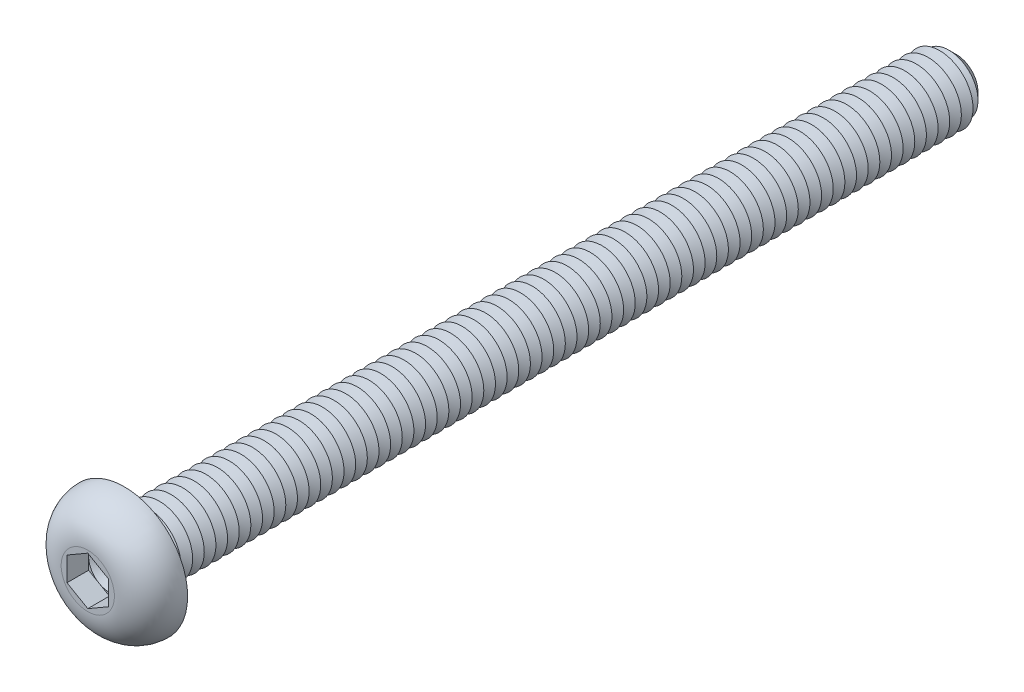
ISO-10303-21;
HEADER;
FILE_DESCRIPTION(('STEP AP214'),'2;1');
FILE_NAME('part.step','',(''),(''),'','','');
FILE_SCHEMA(('AUTOMOTIVE_DESIGN { 1 0 10303 214 1 1 1 1 }'));
ENDSEC;
DATA;
#1=APPLICATION_CONTEXT('core data for automotive mechanical design processes');
#2=APPLICATION_PROTOCOL_DEFINITION('international standard','automotive_design',2000,#1);
#3=PRODUCT_CONTEXT('',#1,'mechanical');
#4=PRODUCT('Part','Part','',(#3));
#5=PRODUCT_RELATED_PRODUCT_CATEGORY('part','',(#4));
#6=PRODUCT_DEFINITION_FORMATION('','',#4);
#7=PRODUCT_DEFINITION_CONTEXT('part definition',#1,'design');
#8=PRODUCT_DEFINITION('design','',#6,#7);
#9=PRODUCT_DEFINITION_SHAPE('','',#8);
#10=(LENGTH_UNIT() NAMED_UNIT(*) SI_UNIT(.MILLI.,.METRE.));
#11=(NAMED_UNIT(*) PLANE_ANGLE_UNIT() SI_UNIT($,.RADIAN.));
#12=(NAMED_UNIT(*) SI_UNIT($,.STERADIAN.) SOLID_ANGLE_UNIT());
#13=UNCERTAINTY_MEASURE_WITH_UNIT(LENGTH_MEASURE(1.E-05),#10,'distance_accuracy_value','');
#14=(GEOMETRIC_REPRESENTATION_CONTEXT(3) GLOBAL_UNCERTAINTY_ASSIGNED_CONTEXT((#13)) GLOBAL_UNIT_ASSIGNED_CONTEXT((#10,
#11,#12)) REPRESENTATION_CONTEXT('',''));
#15=CARTESIAN_POINT('',(0.,0.,0.));
#16=DIRECTION('',(0.,0.,1.));
#17=DIRECTION('',(1.,0.,0.));
#18=AXIS2_PLACEMENT_3D('',#15,#16,#17);
#19=CARTESIAN_POINT('',(0.,0.,0.900000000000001));
#20=DIRECTION('',(0.,0.,1.));
#21=DIRECTION('',(1.,0.,0.));
#22=AXIS2_PLACEMENT_3D('',#19,#20,#21);
#23=PLANE('',#22);
#24=CARTESIAN_POINT('',(0.,0.,0.900000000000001));
#25=DIRECTION('',(0.,0.,1.));
#26=DIRECTION('',(1.,0.,0.));
#27=AXIS2_PLACEMENT_3D('',#24,#25,#26);
#28=CIRCLE('',#27,1.25);
#29=CARTESIAN_POINT('',(1.25,0.,0.900000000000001));
#30=VERTEX_POINT('',#29);
#31=CARTESIAN_POINT('',(0.625,1.08253175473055,0.900000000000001));
#32=VERTEX_POINT('',#31);
#33=EDGE_CURVE('E117',#30,#32,#28,.T.);
#34=ORIENTED_EDGE('',*,*,#33,.F.);
#35=DIRECTION('',(0.,1.,0.));
#36=VECTOR('',#35,1.);
#37=CARTESIAN_POINT('',(1.25,-0.721687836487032,0.900000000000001));
#38=LINE('',#37,#36);
#39=CARTESIAN_POINT('',(1.25,0.721687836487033,0.900000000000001));
#40=VERTEX_POINT('',#39);
#41=EDGE_CURVE('E140',#30,#40,#38,.T.);
#42=ORIENTED_EDGE('',*,*,#41,.T.);
#43=DIRECTION('',(-0.866025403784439,0.5,0.));
#44=VECTOR('',#43,1.);
#45=CARTESIAN_POINT('',(1.25,0.721687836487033,0.900000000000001));
#46=LINE('',#45,#44);
#47=EDGE_CURVE('E135',#40,#32,#46,.T.);
#48=ORIENTED_EDGE('',*,*,#47,.T.);
#49=EDGE_LOOP('',(#34,#42,#48));
#50=FACE_BOUND('',#49,.T.);
#51=ADVANCED_FACE('F39',(#50),#23,.T.);
#52=CARTESIAN_POINT('',(0.,0.,0.900000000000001));
#53=DIRECTION('',(0.,0.,1.));
#54=DIRECTION('',(1.,0.,0.));
#55=AXIS2_PLACEMENT_3D('',#52,#53,#54);
#56=CIRCLE('',#55,1.25);
#57=CARTESIAN_POINT('',(-0.625,1.08253175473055,0.900000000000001));
#58=VERTEX_POINT('',#57);
#59=EDGE_CURVE('E11',#32,#58,#56,.T.);
#60=ORIENTED_EDGE('',*,*,#59,.F.);
#61=CARTESIAN_POINT('',(0.,1.44337567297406,0.900000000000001));
#62=VERTEX_POINT('',#61);
#63=EDGE_CURVE('E130',#32,#62,#46,.T.);
#64=ORIENTED_EDGE('',*,*,#63,.T.);
#65=DIRECTION('',(-0.866025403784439,-0.5,0.));
#66=VECTOR('',#65,1.);
#67=CARTESIAN_POINT('',(0.,1.44337567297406,0.900000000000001));
#68=LINE('',#67,#66);
#69=EDGE_CURVE('E132',#62,#58,#68,.T.);
#70=ORIENTED_EDGE('',*,*,#69,.T.);
#71=EDGE_LOOP('',(#60,#64,#70));
#72=FACE_BOUND('',#71,.T.);
#73=ADVANCED_FACE('F129',(#72),#23,.T.);
#74=CARTESIAN_POINT('',(-1.25,0.,0.900000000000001));
#75=VERTEX_POINT('',#74);
#76=EDGE_CURVE('E49',#58,#75,#56,.T.);
#77=ORIENTED_EDGE('',*,*,#76,.F.);
#78=CARTESIAN_POINT('',(-1.25,0.721687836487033,0.900000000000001));
#79=VERTEX_POINT('',#78);
#80=EDGE_CURVE('E143',#58,#79,#68,.T.);
#81=ORIENTED_EDGE('',*,*,#80,.T.);
#82=DIRECTION('',(0.,-1.,0.));
#83=VECTOR('',#82,1.);
#84=CARTESIAN_POINT('',(-1.25,0.721687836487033,0.900000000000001));
#85=LINE('',#84,#83);
#86=EDGE_CURVE('E154',#79,#75,#85,.T.);
#87=ORIENTED_EDGE('',*,*,#86,.T.);
#88=EDGE_LOOP('',(#77,#81,#87));
#89=FACE_BOUND('',#88,.T.);
#90=ADVANCED_FACE('F261',(#89),#23,.T.);
#91=CARTESIAN_POINT('',(-0.625,-1.08253175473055,0.900000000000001));
#92=VERTEX_POINT('',#91);
#93=EDGE_CURVE('E241',#75,#92,#56,.T.);
#94=ORIENTED_EDGE('',*,*,#93,.F.);
#95=CARTESIAN_POINT('',(-1.25,-0.721687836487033,0.900000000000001));
#96=VERTEX_POINT('',#95);
#97=EDGE_CURVE('E153',#75,#96,#85,.T.);
#98=ORIENTED_EDGE('',*,*,#97,.T.);
#99=DIRECTION('',(0.866025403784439,-0.5,0.));
#100=VECTOR('',#99,1.);
#101=CARTESIAN_POINT('',(-1.25,-0.721687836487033,0.900000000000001));
#102=LINE('',#101,#100);
#103=EDGE_CURVE('E159',#96,#92,#102,.T.);
#104=ORIENTED_EDGE('',*,*,#103,.T.);
#105=EDGE_LOOP('',(#94,#98,#104));
#106=FACE_BOUND('',#105,.T.);
#107=ADVANCED_FACE('F254',(#106),#23,.T.);
#108=CARTESIAN_POINT('',(0.625,-1.08253175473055,0.900000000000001));
#109=VERTEX_POINT('',#108);
#110=EDGE_CURVE('E56',#92,#109,#56,.T.);
#111=ORIENTED_EDGE('',*,*,#110,.F.);
#112=CARTESIAN_POINT('',(0.,-1.44337567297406,0.900000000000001));
#113=VERTEX_POINT('',#112);
#114=EDGE_CURVE('E158',#92,#113,#102,.T.);
#115=ORIENTED_EDGE('',*,*,#114,.T.);
#116=DIRECTION('',(0.866025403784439,0.5,0.));
#117=VECTOR('',#116,1.);
#118=CARTESIAN_POINT('',(0.,-1.44337567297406,0.900000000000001));
#119=LINE('',#118,#117);
#120=EDGE_CURVE('E164',#113,#109,#119,.T.);
#121=ORIENTED_EDGE('',*,*,#120,.T.);
#122=EDGE_LOOP('',(#111,#115,#121));
#123=FACE_BOUND('',#122,.T.);
#124=ADVANCED_FACE('F534',(#123),#23,.T.);
#125=CARTESIAN_POINT('',(0.,0.,-50.));
#126=DIRECTION('',(0.,0.,1.));
#127=DIRECTION('',(1.,0.,0.));
#128=AXIS2_PLACEMENT_3D('',#125,#126,#127);
#129=CYLINDRICAL_SURFACE('',#128,2.);
#130=CARTESIAN_POINT('',(0.,0.,-0.300000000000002));
#131=DIRECTION('',(0.,0.,1.));
#132=DIRECTION('',(1.,0.,0.));
#133=AXIS2_PLACEMENT_3D('',#130,#131,#132);
#134=CIRCLE('',#133,2.);
#135=CARTESIAN_POINT('',(2.,0.,-0.300000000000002));
#136=VERTEX_POINT('',#135);
#137=EDGE_CURVE('E222',#136,#136,#134,.F.);
#138=ORIENTED_EDGE('',*,*,#137,.T.);
#139=EDGE_LOOP('',(#138));
#140=FACE_BOUND('',#139,.T.);
#141=CARTESIAN_POINT('',(0.,0.,-0.699999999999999));
#142=DIRECTION('',(0.,0.,1.));
#143=DIRECTION('',(1.,0.,0.));
#144=AXIS2_PLACEMENT_3D('',#141,#142,#143);
#145=CIRCLE('',#144,2.);
#146=CARTESIAN_POINT('',(2.,0.,-0.699999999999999));
#147=VERTEX_POINT('',#146);
#148=EDGE_CURVE('E149',#147,#147,#145,.T.);
#149=ORIENTED_EDGE('',*,*,#148,.T.);
#150=EDGE_LOOP('',(#149));
#151=FACE_BOUND('',#150,.T.);
#152=ADVANCED_FACE('F518',(#140,#151),#129,.T.);
#153=CARTESIAN_POINT('',(0.,3.8,0.));
#154=DIRECTION('',(0.,0.,1.));
#155=DIRECTION('',(1.,0.,0.));
#156=AXIS2_PLACEMENT_3D('',#153,#154,#155);
#157=PLANE('',#156);
#158=CARTESIAN_POINT('',(0.,0.,0.));
#159=DIRECTION('',(0.,0.,1.));
#160=DIRECTION('',(1.,0.,0.));
#161=AXIS2_PLACEMENT_3D('',#158,#159,#160);
#162=CIRCLE('',#161,2.3);
#163=CARTESIAN_POINT('',(2.3,0.,0.));
#164=VERTEX_POINT('',#163);
#165=EDGE_CURVE('E231',#164,#164,#162,.T.);
#166=ORIENTED_EDGE('',*,*,#165,.T.);
#167=EDGE_LOOP('',(#166));
#168=FACE_BOUND('',#167,.T.);
#169=CARTESIAN_POINT('',(0.,0.,0.));
#170=DIRECTION('',(0.,0.,1.));
#171=DIRECTION('',(1.,0.,0.));
#172=AXIS2_PLACEMENT_3D('',#169,#170,#171);
#173=CIRCLE('',#172,3.8);
#174=CARTESIAN_POINT('',(3.8,0.,0.));
#175=VERTEX_POINT('',#174);
#176=EDGE_CURVE('E196',#175,#175,#173,.T.);
#177=ORIENTED_EDGE('',*,*,#176,.F.);
#178=EDGE_LOOP('',(#177));
#179=FACE_BOUND('',#178,.T.);
#180=ADVANCED_FACE('F564',(#168,#179),#157,.F.);
#181=CARTESIAN_POINT('',(0.,0.,2.2));
#182=DIRECTION('',(0.,0.,-1.));
#183=DIRECTION('',(-1.,0.,0.));
#184=AXIS2_PLACEMENT_3D('',#181,#182,#183);
#185=PLANE('',#184);
#186=DIRECTION('',(-0.866025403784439,-0.5,0.));
#187=VECTOR('',#186,1.);
#188=CARTESIAN_POINT('',(0.,1.44337567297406,2.2));
#189=LINE('',#188,#187);
#190=CARTESIAN_POINT('',(0.,1.44337567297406,2.2));
#191=VERTEX_POINT('',#190);
#192=CARTESIAN_POINT('',(-1.25,0.721687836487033,2.2));
#193=VERTEX_POINT('',#192);
#194=EDGE_CURVE('E174',#191,#193,#189,.T.);
#195=ORIENTED_EDGE('',*,*,#194,.F.);
#196=DIRECTION('',(-0.866025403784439,0.5,0.));
#197=VECTOR('',#196,1.);
#198=CARTESIAN_POINT('',(1.25,0.721687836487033,2.2));
#199=LINE('',#198,#197);
#200=CARTESIAN_POINT('',(1.25,0.721687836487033,2.2));
#201=VERTEX_POINT('',#200);
#202=EDGE_CURVE('E64',#201,#191,#199,.T.);
#203=ORIENTED_EDGE('',*,*,#202,.F.);
#204=DIRECTION('',(0.,1.,0.));
#205=VECTOR('',#204,1.);
#206=CARTESIAN_POINT('',(1.25,-0.721687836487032,2.2));
#207=LINE('',#206,#205);
#208=CARTESIAN_POINT('',(1.25,-0.721687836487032,2.2));
#209=VERTEX_POINT('',#208);
#210=EDGE_CURVE('E138',#209,#201,#207,.T.);
#211=ORIENTED_EDGE('',*,*,#210,.F.);
#212=DIRECTION('',(0.866025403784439,0.5,0.));
#213=VECTOR('',#212,1.);
#214=CARTESIAN_POINT('',(0.,-1.44337567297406,2.2));
#215=LINE('',#214,#213);
#216=CARTESIAN_POINT('',(0.,-1.44337567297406,2.2));
#217=VERTEX_POINT('',#216);
#218=EDGE_CURVE('E186',#217,#209,#215,.T.);
#219=ORIENTED_EDGE('',*,*,#218,.F.);
#220=DIRECTION('',(0.866025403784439,-0.5,0.));
#221=VECTOR('',#220,1.);
#222=CARTESIAN_POINT('',(-1.25,-0.721687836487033,2.2));
#223=LINE('',#222,#221);
#224=CARTESIAN_POINT('',(-1.25,-0.721687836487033,2.2));
#225=VERTEX_POINT('',#224);
#226=EDGE_CURVE('E182',#225,#217,#223,.T.);
#227=ORIENTED_EDGE('',*,*,#226,.F.);
#228=DIRECTION('',(0.,-1.,0.));
#229=VECTOR('',#228,1.);
#230=CARTESIAN_POINT('',(-1.25,0.721687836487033,2.2));
#231=LINE('',#230,#229);
#232=EDGE_CURVE('E178',#193,#225,#231,.T.);
#233=ORIENTED_EDGE('',*,*,#232,.F.);
#234=EDGE_LOOP('',(#195,#203,#211,#219,#227,#233));
#235=FACE_BOUND('',#234,.T.);
#236=CARTESIAN_POINT('',(0.,0.,2.2));
#237=DIRECTION('',(0.,0.,1.));
#238=DIRECTION('',(1.,0.,0.));
#239=AXIS2_PLACEMENT_3D('',#236,#237,#238);
#240=CIRCLE('',#239,1.6);
#241=CARTESIAN_POINT('',(1.6,0.,2.2));
#242=VERTEX_POINT('',#241);
#243=EDGE_CURVE('E214',#242,#242,#240,.T.);
#244=ORIENTED_EDGE('',*,*,#243,.T.);
#245=EDGE_LOOP('',(#244));
#246=FACE_BOUND('',#245,.T.);
#247=ADVANCED_FACE('F270',(#235,#246),#185,.F.);
#248=CARTESIAN_POINT('',(0.,0.,0.));
#249=DIRECTION('',(0.,0.,1.));
#250=DIRECTION('',(1.,0.,0.));
#251=AXIS2_PLACEMENT_3D('',#248,#249,#250);
#252=DEGENERATE_TOROIDAL_SURFACE('',#251,1.6,2.2,.T.);
#253=ORIENTED_EDGE('',*,*,#243,.F.);
#254=EDGE_LOOP('',(#253));
#255=FACE_BOUND('',#254,.T.);
#256=ORIENTED_EDGE('',*,*,#176,.T.);
#257=EDGE_LOOP('',(#256));
#258=FACE_BOUND('',#257,.T.);
#259=ADVANCED_FACE('F558',(#255,#258),#252,.T.);
#260=CARTESIAN_POINT('',(1.25,0.721687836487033,0.900000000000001));
#261=DIRECTION('',(0.5,0.866025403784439,0.));
#262=DIRECTION('',(-0.866025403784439,0.5,0.));
#263=AXIS2_PLACEMENT_3D('',#260,#261,#262);
#264=PLANE('',#263);
#265=ORIENTED_EDGE('',*,*,#202,.T.);
#266=DIRECTION('',(0.,0.,1.));
#267=VECTOR('',#266,1.);
#268=CARTESIAN_POINT('',(0.,1.44337567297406,0.900000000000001));
#269=LINE('',#268,#267);
#270=EDGE_CURVE('E136',#62,#191,#269,.T.);
#271=ORIENTED_EDGE('',*,*,#270,.F.);
#272=ORIENTED_EDGE('',*,*,#63,.F.);
#273=ORIENTED_EDGE('',*,*,#47,.F.);
#274=DIRECTION('',(0.,0.,1.));
#275=VECTOR('',#274,1.);
#276=CARTESIAN_POINT('',(1.25,0.721687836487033,0.900000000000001));
#277=LINE('',#276,#275);
#278=EDGE_CURVE('E193',#40,#201,#277,.T.);
#279=ORIENTED_EDGE('',*,*,#278,.T.);
#280=EDGE_LOOP('',(#265,#271,#272,#273,#279));
#281=FACE_BOUND('',#280,.T.);
#282=ADVANCED_FACE('F134',(#281),#264,.F.);
#283=CARTESIAN_POINT('',(1.25,-0.721687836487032,0.900000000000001));
#284=DIRECTION('',(1.,0.,0.));
#285=DIRECTION('',(0.,1.,0.));
#286=AXIS2_PLACEMENT_3D('',#283,#284,#285);
#287=PLANE('',#286);
#288=ORIENTED_EDGE('',*,*,#210,.T.);
#289=ORIENTED_EDGE('',*,*,#278,.F.);
#290=ORIENTED_EDGE('',*,*,#41,.F.);
#291=CARTESIAN_POINT('',(1.25,-0.721687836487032,0.900000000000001));
#292=VERTEX_POINT('',#291);
#293=EDGE_CURVE('E168',#292,#30,#38,.T.);
#294=ORIENTED_EDGE('',*,*,#293,.F.);
#295=DIRECTION('',(0.,0.,1.));
#296=VECTOR('',#295,1.);
#297=CARTESIAN_POINT('',(1.25,-0.721687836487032,0.900000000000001));
#298=LINE('',#297,#296);
#299=EDGE_CURVE('E197',#292,#209,#298,.T.);
#300=ORIENTED_EDGE('',*,*,#299,.T.);
#301=EDGE_LOOP('',(#288,#289,#290,#294,#300));
#302=FACE_BOUND('',#301,.T.);
#303=ADVANCED_FACE('F542',(#302),#287,.F.);
#304=CARTESIAN_POINT('',(0.,-1.44337567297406,0.900000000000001));
#305=DIRECTION('',(0.5,-0.866025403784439,0.));
#306=DIRECTION('',(0.866025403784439,0.5,0.));
#307=AXIS2_PLACEMENT_3D('',#304,#305,#306);
#308=PLANE('',#307);
#309=ORIENTED_EDGE('',*,*,#218,.T.);
#310=ORIENTED_EDGE('',*,*,#299,.F.);
#311=EDGE_CURVE('E163',#109,#292,#119,.T.);
#312=ORIENTED_EDGE('',*,*,#311,.F.);
#313=ORIENTED_EDGE('',*,*,#120,.F.);
#314=DIRECTION('',(0.,0.,1.));
#315=VECTOR('',#314,1.);
#316=CARTESIAN_POINT('',(0.,-1.44337567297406,0.900000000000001));
#317=LINE('',#316,#315);
#318=EDGE_CURVE('E200',#113,#217,#317,.T.);
#319=ORIENTED_EDGE('',*,*,#318,.T.);
#320=EDGE_LOOP('',(#309,#310,#312,#313,#319));
#321=FACE_BOUND('',#320,.T.);
#322=ADVANCED_FACE('F545',(#321),#308,.F.);
#323=CARTESIAN_POINT('',(-1.25,-0.721687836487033,0.900000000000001));
#324=DIRECTION('',(-0.5,-0.866025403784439,0.));
#325=DIRECTION('',(0.866025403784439,-0.5,0.));
#326=AXIS2_PLACEMENT_3D('',#323,#324,#325);
#327=PLANE('',#326);
#328=ORIENTED_EDGE('',*,*,#226,.T.);
#329=ORIENTED_EDGE('',*,*,#318,.F.);
#330=ORIENTED_EDGE('',*,*,#114,.F.);
#331=ORIENTED_EDGE('',*,*,#103,.F.);
#332=DIRECTION('',(0.,0.,1.));
#333=VECTOR('',#332,1.);
#334=CARTESIAN_POINT('',(-1.25,-0.721687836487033,0.900000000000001));
#335=LINE('',#334,#333);
#336=EDGE_CURVE('E203',#96,#225,#335,.T.);
#337=ORIENTED_EDGE('',*,*,#336,.T.);
#338=EDGE_LOOP('',(#328,#329,#330,#331,#337));
#339=FACE_BOUND('',#338,.T.);
#340=ADVANCED_FACE('F275',(#339),#327,.F.);
#341=CARTESIAN_POINT('',(-1.25,0.721687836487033,0.900000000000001));
#342=DIRECTION('',(-1.,0.,0.));
#343=DIRECTION('',(0.,0.,1.));
#344=AXIS2_PLACEMENT_3D('',#341,#342,#343);
#345=PLANE('',#344);
#346=ORIENTED_EDGE('',*,*,#232,.T.);
#347=ORIENTED_EDGE('',*,*,#336,.F.);
#348=ORIENTED_EDGE('',*,*,#97,.F.);
#349=ORIENTED_EDGE('',*,*,#86,.F.);
#350=DIRECTION('',(0.,0.,1.));
#351=VECTOR('',#350,1.);
#352=CARTESIAN_POINT('',(-1.25,0.721687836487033,0.900000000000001));
#353=LINE('',#352,#351);
#354=EDGE_CURVE('E206',#79,#193,#353,.T.);
#355=ORIENTED_EDGE('',*,*,#354,.T.);
#356=EDGE_LOOP('',(#346,#347,#348,#349,#355));
#357=FACE_BOUND('',#356,.T.);
#358=ADVANCED_FACE('F259',(#357),#345,.F.);
#359=CARTESIAN_POINT('',(0.,1.44337567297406,0.900000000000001));
#360=DIRECTION('',(-0.5,0.866025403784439,0.));
#361=DIRECTION('',(-0.866025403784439,-0.5,0.));
#362=AXIS2_PLACEMENT_3D('',#359,#360,#361);
#363=PLANE('',#362);
#364=ORIENTED_EDGE('',*,*,#194,.T.);
#365=ORIENTED_EDGE('',*,*,#354,.F.);
#366=ORIENTED_EDGE('',*,*,#80,.F.);
#367=ORIENTED_EDGE('',*,*,#69,.F.);
#368=ORIENTED_EDGE('',*,*,#270,.T.);
#369=EDGE_LOOP('',(#364,#365,#366,#367,#368));
#370=FACE_BOUND('',#369,.T.);
#371=ADVANCED_FACE('F264',(#370),#363,.F.);
#372=EDGE_CURVE('E43',#109,#30,#56,.T.);
#373=ORIENTED_EDGE('',*,*,#372,.F.);
#374=ORIENTED_EDGE('',*,*,#311,.T.);
#375=ORIENTED_EDGE('',*,*,#293,.T.);
#376=EDGE_LOOP('',(#373,#374,#375));
#377=FACE_BOUND('',#376,.T.);
#378=ADVANCED_FACE('F523',(#377),#23,.T.);
#379=CARTESIAN_POINT('',(0.,0.,-0.699999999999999));
#380=DIRECTION('',(0.,0.,1.));
#381=DIRECTION('',(1.,0.,0.));
#382=AXIS2_PLACEMENT_3D('',#379,#380,#381);
#383=CONICAL_SURFACE('',#382,2.,1.04719755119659);
#384=CARTESIAN_POINT('',(0.,0.,-1.05));
#385=DIRECTION('',(0.,0.,1.));
#386=DIRECTION('',(1.,0.,0.));
#387=AXIS2_PLACEMENT_3D('',#384,#385,#386);
#388=CIRCLE('',#387,1.3937822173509);
#389=CARTESIAN_POINT('',(1.3937822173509,0.,-1.05));
#390=VERTEX_POINT('',#389);
#391=EDGE_CURVE('E511',#390,#390,#388,.T.);
#392=ORIENTED_EDGE('',*,*,#391,.T.);
#393=EDGE_LOOP('',(#392));
#394=FACE_BOUND('',#393,.T.);
#395=ORIENTED_EDGE('',*,*,#148,.F.);
#396=EDGE_LOOP('',(#395));
#397=FACE_BOUND('',#396,.T.);
#398=ADVANCED_FACE('F520',(#394,#397),#383,.T.);
#399=CARTESIAN_POINT('',(0.,0.,-1.05));
#400=DIRECTION('',(0.,0.,-1.));
#401=DIRECTION('',(-1.,0.,0.));
#402=AXIS2_PLACEMENT_3D('',#399,#400,#401);
#403=CONICAL_SURFACE('',#402,1.3937822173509,1.0471975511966);
#404=CARTESIAN_POINT('',(0.,0.,-1.4));
#405=DIRECTION('',(0.,0.,1.));
#406=DIRECTION('',(1.,0.,0.));
#407=AXIS2_PLACEMENT_3D('',#404,#405,#406);
#408=CIRCLE('',#407,2.);
#409=CARTESIAN_POINT('',(2.,0.,-1.4));
#410=VERTEX_POINT('',#409);
#411=EDGE_CURVE('E508',#410,#410,#408,.T.);
#412=ORIENTED_EDGE('',*,*,#411,.T.);
#413=EDGE_LOOP('',(#412));
#414=FACE_BOUND('',#413,.T.);
#415=ORIENTED_EDGE('',*,*,#391,.F.);
#416=EDGE_LOOP('',(#415));
#417=FACE_BOUND('',#416,.T.);
#418=ADVANCED_FACE('F522',(#414,#417),#403,.T.);
#419=CARTESIAN_POINT('',(0.,0.,-1.4));
#420=DIRECTION('',(0.,0.,1.));
#421=DIRECTION('',(1.,0.,0.));
#422=AXIS2_PLACEMENT_3D('',#419,#420,#421);
#423=CONICAL_SURFACE('',#422,2.,1.04719755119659);
#424=CARTESIAN_POINT('',(0.,0.,-1.75));
#425=DIRECTION('',(0.,0.,1.));
#426=DIRECTION('',(1.,0.,0.));
#427=AXIS2_PLACEMENT_3D('',#424,#425,#426);
#428=CIRCLE('',#427,1.3937822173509);
#429=CARTESIAN_POINT('',(1.3937822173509,0.,-1.75));
#430=VERTEX_POINT('',#429);
#431=EDGE_CURVE('E331',#430,#430,#428,.T.);
#432=ORIENTED_EDGE('',*,*,#431,.T.);
#433=EDGE_LOOP('',(#432));
#434=FACE_BOUND('',#433,.T.);
#435=ORIENTED_EDGE('',*,*,#411,.F.);
#436=EDGE_LOOP('',(#435));
#437=FACE_BOUND('',#436,.T.);
#438=ADVANCED_FACE('F529',(#434,#437),#423,.T.);
#439=CARTESIAN_POINT('',(0.,0.,-1.75));
#440=DIRECTION('',(0.,0.,-1.));
#441=DIRECTION('',(-1.,0.,0.));
#442=AXIS2_PLACEMENT_3D('',#439,#440,#441);
#443=CONICAL_SURFACE('',#442,1.3937822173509,1.0471975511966);
#444=CARTESIAN_POINT('',(0.,0.,-2.1));
#445=DIRECTION('',(0.,0.,1.));
#446=DIRECTION('',(1.,0.,0.));
#447=AXIS2_PLACEMENT_3D('',#444,#445,#446);
#448=CIRCLE('',#447,2.);
#449=CARTESIAN_POINT('',(2.,0.,-2.1));
#450=VERTEX_POINT('',#449);
#451=EDGE_CURVE('E329',#450,#450,#448,.T.);
#452=ORIENTED_EDGE('',*,*,#451,.T.);
#453=EDGE_LOOP('',(#452));
#454=FACE_BOUND('',#453,.T.);
#455=ORIENTED_EDGE('',*,*,#431,.F.);
#456=EDGE_LOOP('',(#455));
#457=FACE_BOUND('',#456,.T.);
#458=ADVANCED_FACE('F1015',(#454,#457),#443,.T.);
#459=CARTESIAN_POINT('',(0.,0.,-2.1));
#460=DIRECTION('',(0.,0.,1.));
#461=DIRECTION('',(1.,0.,0.));
#462=AXIS2_PLACEMENT_3D('',#459,#460,#461);
#463=CONICAL_SURFACE('',#462,2.,1.04719755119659);
#464=CARTESIAN_POINT('',(0.,0.,-2.45));
#465=DIRECTION('',(0.,0.,1.));
#466=DIRECTION('',(1.,0.,0.));
#467=AXIS2_PLACEMENT_3D('',#464,#465,#466);
#468=CIRCLE('',#467,1.3937822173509);
#469=CARTESIAN_POINT('',(1.3937822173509,0.,-2.45));
#470=VERTEX_POINT('',#469);
#471=EDGE_CURVE('E332',#470,#470,#468,.T.);
#472=ORIENTED_EDGE('',*,*,#471,.T.);
#473=EDGE_LOOP('',(#472));
#474=FACE_BOUND('',#473,.T.);
#475=ORIENTED_EDGE('',*,*,#451,.F.);
#476=EDGE_LOOP('',(#475));
#477=FACE_BOUND('',#476,.T.);
#478=ADVANCED_FACE('F1011',(#474,#477),#463,.T.);
#479=CARTESIAN_POINT('',(0.,0.,-2.45));
#480=DIRECTION('',(0.,0.,-1.));
#481=DIRECTION('',(-1.,0.,0.));
#482=AXIS2_PLACEMENT_3D('',#479,#480,#481);
#483=CONICAL_SURFACE('',#482,1.3937822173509,1.0471975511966);
#484=CARTESIAN_POINT('',(0.,0.,-2.8));
#485=DIRECTION('',(0.,0.,1.));
#486=DIRECTION('',(1.,0.,0.));
#487=AXIS2_PLACEMENT_3D('',#484,#485,#486);
#488=CIRCLE('',#487,2.);
#489=CARTESIAN_POINT('',(2.,0.,-2.8));
#490=VERTEX_POINT('',#489);
#491=EDGE_CURVE('E500',#490,#490,#488,.T.);
#492=ORIENTED_EDGE('',*,*,#491,.T.);
#493=EDGE_LOOP('',(#492));
#494=FACE_BOUND('',#493,.T.);
#495=ORIENTED_EDGE('',*,*,#471,.F.);
#496=EDGE_LOOP('',(#495));
#497=FACE_BOUND('',#496,.T.);
#498=ADVANCED_FACE('F1007',(#494,#497),#483,.T.);
#499=CARTESIAN_POINT('',(0.,0.,-2.8));
#500=DIRECTION('',(0.,0.,1.));
#501=DIRECTION('',(1.,0.,0.));
#502=AXIS2_PLACEMENT_3D('',#499,#500,#501);
#503=CONICAL_SURFACE('',#502,2.,1.04719755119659);
#504=CARTESIAN_POINT('',(0.,0.,-3.15));
#505=DIRECTION('',(0.,0.,1.));
#506=DIRECTION('',(1.,0.,0.));
#507=AXIS2_PLACEMENT_3D('',#504,#505,#506);
#508=CIRCLE('',#507,1.3937822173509);
#509=CARTESIAN_POINT('',(1.3937822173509,0.,-3.15));
#510=VERTEX_POINT('',#509);
#511=EDGE_CURVE('E418',#510,#510,#508,.T.);
#512=ORIENTED_EDGE('',*,*,#511,.T.);
#513=EDGE_LOOP('',(#512));
#514=FACE_BOUND('',#513,.T.);
#515=ORIENTED_EDGE('',*,*,#491,.F.);
#516=EDGE_LOOP('',(#515));
#517=FACE_BOUND('',#516,.T.);
#518=ADVANCED_FACE('F1003',(#514,#517),#503,.T.);
#519=CARTESIAN_POINT('',(0.,0.,-3.15));
#520=DIRECTION('',(0.,0.,-1.));
#521=DIRECTION('',(-1.,0.,0.));
#522=AXIS2_PLACEMENT_3D('',#519,#520,#521);
#523=CONICAL_SURFACE('',#522,1.3937822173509,1.0471975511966);
#524=CARTESIAN_POINT('',(0.,0.,-3.5));
#525=DIRECTION('',(0.,0.,1.));
#526=DIRECTION('',(1.,0.,0.));
#527=AXIS2_PLACEMENT_3D('',#524,#525,#526);
#528=CIRCLE('',#527,2.);
#529=CARTESIAN_POINT('',(2.,0.,-3.5));
#530=VERTEX_POINT('',#529);
#531=EDGE_CURVE('E416',#530,#530,#528,.T.);
#532=ORIENTED_EDGE('',*,*,#531,.T.);
#533=EDGE_LOOP('',(#532));
#534=FACE_BOUND('',#533,.T.);
#535=ORIENTED_EDGE('',*,*,#511,.F.);
#536=EDGE_LOOP('',(#535));
#537=FACE_BOUND('',#536,.T.);
#538=ADVANCED_FACE('F999',(#534,#537),#523,.T.);
#539=CARTESIAN_POINT('',(0.,0.,-3.5));
#540=DIRECTION('',(0.,0.,1.));
#541=DIRECTION('',(1.,0.,0.));
#542=AXIS2_PLACEMENT_3D('',#539,#540,#541);
#543=CONICAL_SURFACE('',#542,2.,1.04719755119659);
#544=CARTESIAN_POINT('',(0.,0.,-3.85));
#545=DIRECTION('',(0.,0.,1.));
#546=DIRECTION('',(1.,0.,0.));
#547=AXIS2_PLACEMENT_3D('',#544,#545,#546);
#548=CIRCLE('',#547,1.3937822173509);
#549=CARTESIAN_POINT('',(1.3937822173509,0.,-3.85));
#550=VERTEX_POINT('',#549);
#551=EDGE_CURVE('E419',#550,#550,#548,.T.);
#552=ORIENTED_EDGE('',*,*,#551,.T.);
#553=EDGE_LOOP('',(#552));
#554=FACE_BOUND('',#553,.T.);
#555=ORIENTED_EDGE('',*,*,#531,.F.);
#556=EDGE_LOOP('',(#555));
#557=FACE_BOUND('',#556,.T.);
#558=ADVANCED_FACE('F995',(#554,#557),#543,.T.);
#559=CARTESIAN_POINT('',(0.,0.,-3.85));
#560=DIRECTION('',(0.,0.,-1.));
#561=DIRECTION('',(-1.,0.,0.));
#562=AXIS2_PLACEMENT_3D('',#559,#560,#561);
#563=CONICAL_SURFACE('',#562,1.3937822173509,1.0471975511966);
#564=CARTESIAN_POINT('',(0.,0.,-4.2));
#565=DIRECTION('',(0.,0.,1.));
#566=DIRECTION('',(1.,0.,0.));
#567=AXIS2_PLACEMENT_3D('',#564,#565,#566);
#568=CIRCLE('',#567,2.);
#569=CARTESIAN_POINT('',(2.,0.,-4.2));
#570=VERTEX_POINT('',#569);
#571=EDGE_CURVE('E490',#570,#570,#568,.T.);
#572=ORIENTED_EDGE('',*,*,#571,.T.);
#573=EDGE_LOOP('',(#572));
#574=FACE_BOUND('',#573,.T.);
#575=ORIENTED_EDGE('',*,*,#551,.F.);
#576=EDGE_LOOP('',(#575));
#577=FACE_BOUND('',#576,.T.);
#578=ADVANCED_FACE('F991',(#574,#577),#563,.T.);
#579=CARTESIAN_POINT('',(0.,0.,-4.2));
#580=DIRECTION('',(0.,0.,1.));
#581=DIRECTION('',(1.,0.,0.));
#582=AXIS2_PLACEMENT_3D('',#579,#580,#581);
#583=CONICAL_SURFACE('',#582,2.,1.04719755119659);
#584=CARTESIAN_POINT('',(0.,0.,-4.55));
#585=DIRECTION('',(0.,0.,1.));
#586=DIRECTION('',(1.,0.,0.));
#587=AXIS2_PLACEMENT_3D('',#584,#585,#586);
#588=CIRCLE('',#587,1.3937822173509);
#589=CARTESIAN_POINT('',(1.3937822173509,0.,-4.55));
#590=VERTEX_POINT('',#589);
#591=EDGE_CURVE('E486',#590,#590,#588,.T.);
#592=ORIENTED_EDGE('',*,*,#591,.T.);
#593=EDGE_LOOP('',(#592));
#594=FACE_BOUND('',#593,.T.);
#595=ORIENTED_EDGE('',*,*,#571,.F.);
#596=EDGE_LOOP('',(#595));
#597=FACE_BOUND('',#596,.T.);
#598=ADVANCED_FACE('F987',(#594,#597),#583,.T.);
#599=CARTESIAN_POINT('',(0.,0.,-4.55));
#600=DIRECTION('',(0.,0.,-1.));
#601=DIRECTION('',(-1.,0.,0.));
#602=AXIS2_PLACEMENT_3D('',#599,#600,#601);
#603=CONICAL_SURFACE('',#602,1.3937822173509,1.0471975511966);
#604=CARTESIAN_POINT('',(0.,0.,-4.9));
#605=DIRECTION('',(0.,0.,1.));
#606=DIRECTION('',(1.,0.,0.));
#607=AXIS2_PLACEMENT_3D('',#604,#605,#606);
#608=CIRCLE('',#607,2.);
#609=CARTESIAN_POINT('',(2.,0.,-4.9));
#610=VERTEX_POINT('',#609);
#611=EDGE_CURVE('E482',#610,#610,#608,.T.);
#612=ORIENTED_EDGE('',*,*,#611,.T.);
#613=EDGE_LOOP('',(#612));
#614=FACE_BOUND('',#613,.T.);
#615=ORIENTED_EDGE('',*,*,#591,.F.);
#616=EDGE_LOOP('',(#615));
#617=FACE_BOUND('',#616,.T.);
#618=ADVANCED_FACE('F983',(#614,#617),#603,.T.);
#619=CARTESIAN_POINT('',(0.,0.,-4.9));
#620=DIRECTION('',(0.,0.,1.));
#621=DIRECTION('',(1.,0.,0.));
#622=AXIS2_PLACEMENT_3D('',#619,#620,#621);
#623=CONICAL_SURFACE('',#622,2.,1.04719755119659);
#624=CARTESIAN_POINT('',(0.,0.,-5.25));
#625=DIRECTION('',(0.,0.,1.));
#626=DIRECTION('',(1.,0.,0.));
#627=AXIS2_PLACEMENT_3D('',#624,#625,#626);
#628=CIRCLE('',#627,1.3937822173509);
#629=CARTESIAN_POINT('',(1.3937822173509,0.,-5.25));
#630=VERTEX_POINT('',#629);
#631=EDGE_CURVE('E326',#630,#630,#628,.T.);
#632=ORIENTED_EDGE('',*,*,#631,.T.);
#633=EDGE_LOOP('',(#632));
#634=FACE_BOUND('',#633,.T.);
#635=ORIENTED_EDGE('',*,*,#611,.F.);
#636=EDGE_LOOP('',(#635));
#637=FACE_BOUND('',#636,.T.);
#638=ADVANCED_FACE('F979',(#634,#637),#623,.T.);
#639=CARTESIAN_POINT('',(0.,0.,-5.25));
#640=DIRECTION('',(0.,0.,-1.));
#641=DIRECTION('',(-1.,0.,0.));
#642=AXIS2_PLACEMENT_3D('',#639,#640,#641);
#643=CONICAL_SURFACE('',#642,1.3937822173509,1.0471975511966);
#644=CARTESIAN_POINT('',(0.,0.,-5.6));
#645=DIRECTION('',(0.,0.,1.));
#646=DIRECTION('',(1.,0.,0.));
#647=AXIS2_PLACEMENT_3D('',#644,#645,#646);
#648=CIRCLE('',#647,2.);
#649=CARTESIAN_POINT('',(2.,0.,-5.6));
#650=VERTEX_POINT('',#649);
#651=EDGE_CURVE('E323',#650,#650,#648,.T.);
#652=ORIENTED_EDGE('',*,*,#651,.T.);
#653=EDGE_LOOP('',(#652));
#654=FACE_BOUND('',#653,.T.);
#655=ORIENTED_EDGE('',*,*,#631,.F.);
#656=EDGE_LOOP('',(#655));
#657=FACE_BOUND('',#656,.T.);
#658=ADVANCED_FACE('F975',(#654,#657),#643,.T.);
#659=CARTESIAN_POINT('',(0.,0.,-5.6));
#660=DIRECTION('',(0.,0.,1.));
#661=DIRECTION('',(1.,0.,0.));
#662=AXIS2_PLACEMENT_3D('',#659,#660,#661);
#663=CONICAL_SURFACE('',#662,2.,1.04719755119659);
#664=CARTESIAN_POINT('',(0.,0.,-5.95));
#665=DIRECTION('',(0.,0.,1.));
#666=DIRECTION('',(1.,0.,0.));
#667=AXIS2_PLACEMENT_3D('',#664,#665,#666);
#668=CIRCLE('',#667,1.3937822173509);
#669=CARTESIAN_POINT('',(1.3937822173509,0.,-5.95));
#670=VERTEX_POINT('',#669);
#671=EDGE_CURVE('E327',#670,#670,#668,.T.);
#672=ORIENTED_EDGE('',*,*,#671,.T.);
#673=EDGE_LOOP('',(#672));
#674=FACE_BOUND('',#673,.T.);
#675=ORIENTED_EDGE('',*,*,#651,.F.);
#676=EDGE_LOOP('',(#675));
#677=FACE_BOUND('',#676,.T.);
#678=ADVANCED_FACE('F971',(#674,#677),#663,.T.);
#679=CARTESIAN_POINT('',(0.,0.,-5.95));
#680=DIRECTION('',(0.,0.,-1.));
#681=DIRECTION('',(-1.,0.,0.));
#682=AXIS2_PLACEMENT_3D('',#679,#680,#681);
#683=CONICAL_SURFACE('',#682,1.3937822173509,1.0471975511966);
#684=CARTESIAN_POINT('',(0.,0.,-6.3));
#685=DIRECTION('',(0.,0.,1.));
#686=DIRECTION('',(1.,0.,0.));
#687=AXIS2_PLACEMENT_3D('',#684,#685,#686);
#688=CIRCLE('',#687,2.);
#689=CARTESIAN_POINT('',(2.,0.,-6.3));
#690=VERTEX_POINT('',#689);
#691=EDGE_CURVE('E320',#690,#690,#688,.T.);
#692=ORIENTED_EDGE('',*,*,#691,.T.);
#693=EDGE_LOOP('',(#692));
#694=FACE_BOUND('',#693,.T.);
#695=ORIENTED_EDGE('',*,*,#671,.F.);
#696=EDGE_LOOP('',(#695));
#697=FACE_BOUND('',#696,.T.);
#698=ADVANCED_FACE('F967',(#694,#697),#683,.T.);
#699=CARTESIAN_POINT('',(0.,0.,-6.3));
#700=DIRECTION('',(0.,0.,1.));
#701=DIRECTION('',(1.,0.,0.));
#702=AXIS2_PLACEMENT_3D('',#699,#700,#701);
#703=CONICAL_SURFACE('',#702,2.,1.04719755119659);
#704=CARTESIAN_POINT('',(0.,0.,-6.65));
#705=DIRECTION('',(0.,0.,1.));
#706=DIRECTION('',(1.,0.,0.));
#707=AXIS2_PLACEMENT_3D('',#704,#705,#706);
#708=CIRCLE('',#707,1.3937822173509);
#709=CARTESIAN_POINT('',(1.3937822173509,0.,-6.65));
#710=VERTEX_POINT('',#709);
#711=EDGE_CURVE('E317',#710,#710,#708,.T.);
#712=ORIENTED_EDGE('',*,*,#711,.T.);
#713=EDGE_LOOP('',(#712));
#714=FACE_BOUND('',#713,.T.);
#715=ORIENTED_EDGE('',*,*,#691,.F.);
#716=EDGE_LOOP('',(#715));
#717=FACE_BOUND('',#716,.T.);
#718=ADVANCED_FACE('F963',(#714,#717),#703,.T.);
#719=CARTESIAN_POINT('',(0.,0.,-6.65));
#720=DIRECTION('',(0.,0.,-1.));
#721=DIRECTION('',(-1.,0.,0.));
#722=AXIS2_PLACEMENT_3D('',#719,#720,#721);
#723=CONICAL_SURFACE('',#722,1.3937822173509,1.0471975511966);
#724=CARTESIAN_POINT('',(0.,0.,-7.));
#725=DIRECTION('',(0.,0.,1.));
#726=DIRECTION('',(1.,0.,0.));
#727=AXIS2_PLACEMENT_3D('',#724,#725,#726);
#728=CIRCLE('',#727,2.);
#729=CARTESIAN_POINT('',(2.,0.,-7.));
#730=VERTEX_POINT('',#729);
#731=EDGE_CURVE('E321',#730,#730,#728,.T.);
#732=ORIENTED_EDGE('',*,*,#731,.T.);
#733=EDGE_LOOP('',(#732));
#734=FACE_BOUND('',#733,.T.);
#735=ORIENTED_EDGE('',*,*,#711,.F.);
#736=EDGE_LOOP('',(#735));
#737=FACE_BOUND('',#736,.T.);
#738=ADVANCED_FACE('F959',(#734,#737),#723,.T.);
#739=CARTESIAN_POINT('',(0.,0.,-7.));
#740=DIRECTION('',(0.,0.,1.));
#741=DIRECTION('',(1.,0.,0.));
#742=AXIS2_PLACEMENT_3D('',#739,#740,#741);
#743=CONICAL_SURFACE('',#742,2.,1.04719755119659);
#744=CARTESIAN_POINT('',(0.,0.,-7.35));
#745=DIRECTION('',(0.,0.,1.));
#746=DIRECTION('',(1.,0.,0.));
#747=AXIS2_PLACEMENT_3D('',#744,#745,#746);
#748=CIRCLE('',#747,1.3937822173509);
#749=CARTESIAN_POINT('',(1.3937822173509,0.,-7.35));
#750=VERTEX_POINT('',#749);
#751=EDGE_CURVE('E370',#750,#750,#748,.T.);
#752=ORIENTED_EDGE('',*,*,#751,.T.);
#753=EDGE_LOOP('',(#752));
#754=FACE_BOUND('',#753,.T.);
#755=ORIENTED_EDGE('',*,*,#731,.F.);
#756=EDGE_LOOP('',(#755));
#757=FACE_BOUND('',#756,.T.);
#758=ADVANCED_FACE('F955',(#754,#757),#743,.T.);
#759=CARTESIAN_POINT('',(0.,0.,-7.35));
#760=DIRECTION('',(0.,0.,-1.));
#761=DIRECTION('',(-1.,0.,0.));
#762=AXIS2_PLACEMENT_3D('',#759,#760,#761);
#763=CONICAL_SURFACE('',#762,1.3937822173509,1.0471975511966);
#764=CARTESIAN_POINT('',(0.,0.,-7.7));
#765=DIRECTION('',(0.,0.,1.));
#766=DIRECTION('',(1.,0.,0.));
#767=AXIS2_PLACEMENT_3D('',#764,#765,#766);
#768=CIRCLE('',#767,2.);
#769=CARTESIAN_POINT('',(2.,0.,-7.7));
#770=VERTEX_POINT('',#769);
#771=EDGE_CURVE('E367',#770,#770,#768,.T.);
#772=ORIENTED_EDGE('',*,*,#771,.T.);
#773=EDGE_LOOP('',(#772));
#774=FACE_BOUND('',#773,.T.);
#775=ORIENTED_EDGE('',*,*,#751,.F.);
#776=EDGE_LOOP('',(#775));
#777=FACE_BOUND('',#776,.T.);
#778=ADVANCED_FACE('F951',(#774,#777),#763,.T.);
#779=CARTESIAN_POINT('',(0.,0.,-7.7));
#780=DIRECTION('',(0.,0.,1.));
#781=DIRECTION('',(1.,0.,0.));
#782=AXIS2_PLACEMENT_3D('',#779,#780,#781);
#783=CONICAL_SURFACE('',#782,2.,1.04719755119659);
#784=CARTESIAN_POINT('',(0.,0.,-8.05));
#785=DIRECTION('',(0.,0.,1.));
#786=DIRECTION('',(1.,0.,0.));
#787=AXIS2_PLACEMENT_3D('',#784,#785,#786);
#788=CIRCLE('',#787,1.3937822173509);
#789=CARTESIAN_POINT('',(1.3937822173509,0.,-8.05));
#790=VERTEX_POINT('',#789);
#791=EDGE_CURVE('E364',#790,#790,#788,.T.);
#792=ORIENTED_EDGE('',*,*,#791,.T.);
#793=EDGE_LOOP('',(#792));
#794=FACE_BOUND('',#793,.T.);
#795=ORIENTED_EDGE('',*,*,#771,.F.);
#796=EDGE_LOOP('',(#795));
#797=FACE_BOUND('',#796,.T.);
#798=ADVANCED_FACE('F947',(#794,#797),#783,.T.);
#799=CARTESIAN_POINT('',(0.,0.,-8.05));
#800=DIRECTION('',(0.,0.,-1.));
#801=DIRECTION('',(-1.,0.,0.));
#802=AXIS2_PLACEMENT_3D('',#799,#800,#801);
#803=CONICAL_SURFACE('',#802,1.3937822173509,1.0471975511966);
#804=CARTESIAN_POINT('',(0.,0.,-8.4));
#805=DIRECTION('',(0.,0.,1.));
#806=DIRECTION('',(1.,0.,0.));
#807=AXIS2_PLACEMENT_3D('',#804,#805,#806);
#808=CIRCLE('',#807,2.);
#809=CARTESIAN_POINT('',(2.,0.,-8.4));
#810=VERTEX_POINT('',#809);
#811=EDGE_CURVE('E368',#810,#810,#808,.T.);
#812=ORIENTED_EDGE('',*,*,#811,.T.);
#813=EDGE_LOOP('',(#812));
#814=FACE_BOUND('',#813,.T.);
#815=ORIENTED_EDGE('',*,*,#791,.F.);
#816=EDGE_LOOP('',(#815));
#817=FACE_BOUND('',#816,.T.);
#818=ADVANCED_FACE('F943',(#814,#817),#803,.T.);
#819=CARTESIAN_POINT('',(0.,0.,-8.4));
#820=DIRECTION('',(0.,0.,1.));
#821=DIRECTION('',(1.,0.,0.));
#822=AXIS2_PLACEMENT_3D('',#819,#820,#821);
#823=CONICAL_SURFACE('',#822,2.,1.04719755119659);
#824=CARTESIAN_POINT('',(0.,0.,-8.75));
#825=DIRECTION('',(0.,0.,1.));
#826=DIRECTION('',(1.,0.,0.));
#827=AXIS2_PLACEMENT_3D('',#824,#825,#826);
#828=CIRCLE('',#827,1.3937822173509);
#829=CARTESIAN_POINT('',(1.3937822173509,0.,-8.75));
#830=VERTEX_POINT('',#829);
#831=EDGE_CURVE('E413',#830,#830,#828,.T.);
#832=ORIENTED_EDGE('',*,*,#831,.T.);
#833=EDGE_LOOP('',(#832));
#834=FACE_BOUND('',#833,.T.);
#835=ORIENTED_EDGE('',*,*,#811,.F.);
#836=EDGE_LOOP('',(#835));
#837=FACE_BOUND('',#836,.T.);
#838=ADVANCED_FACE('F939',(#834,#837),#823,.T.);
#839=CARTESIAN_POINT('',(0.,0.,-8.75));
#840=DIRECTION('',(0.,0.,-1.));
#841=DIRECTION('',(-1.,0.,0.));
#842=AXIS2_PLACEMENT_3D('',#839,#840,#841);
#843=CONICAL_SURFACE('',#842,1.3937822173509,1.0471975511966);
#844=CARTESIAN_POINT('',(0.,0.,-9.1));
#845=DIRECTION('',(0.,0.,1.));
#846=DIRECTION('',(1.,0.,0.));
#847=AXIS2_PLACEMENT_3D('',#844,#845,#846);
#848=CIRCLE('',#847,2.);
#849=CARTESIAN_POINT('',(2.,0.,-9.1));
#850=VERTEX_POINT('',#849);
#851=EDGE_CURVE('E410',#850,#850,#848,.T.);
#852=ORIENTED_EDGE('',*,*,#851,.T.);
#853=EDGE_LOOP('',(#852));
#854=FACE_BOUND('',#853,.T.);
#855=ORIENTED_EDGE('',*,*,#831,.F.);
#856=EDGE_LOOP('',(#855));
#857=FACE_BOUND('',#856,.T.);
#858=ADVANCED_FACE('F935',(#854,#857),#843,.T.);
#859=CARTESIAN_POINT('',(0.,0.,-9.1));
#860=DIRECTION('',(0.,0.,1.));
#861=DIRECTION('',(1.,0.,0.));
#862=AXIS2_PLACEMENT_3D('',#859,#860,#861);
#863=CONICAL_SURFACE('',#862,2.,1.04719755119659);
#864=CARTESIAN_POINT('',(0.,0.,-9.45));
#865=DIRECTION('',(0.,0.,1.));
#866=DIRECTION('',(1.,0.,0.));
#867=AXIS2_PLACEMENT_3D('',#864,#865,#866);
#868=CIRCLE('',#867,1.3937822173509);
#869=CARTESIAN_POINT('',(1.3937822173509,0.,-9.45));
#870=VERTEX_POINT('',#869);
#871=EDGE_CURVE('E414',#870,#870,#868,.T.);
#872=ORIENTED_EDGE('',*,*,#871,.T.);
#873=EDGE_LOOP('',(#872));
#874=FACE_BOUND('',#873,.T.);
#875=ORIENTED_EDGE('',*,*,#851,.F.);
#876=EDGE_LOOP('',(#875));
#877=FACE_BOUND('',#876,.T.);
#878=ADVANCED_FACE('F931',(#874,#877),#863,.T.);
#879=CARTESIAN_POINT('',(0.,0.,-9.45));
#880=DIRECTION('',(0.,0.,-1.));
#881=DIRECTION('',(-1.,0.,0.));
#882=AXIS2_PLACEMENT_3D('',#879,#880,#881);
#883=CONICAL_SURFACE('',#882,1.3937822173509,1.0471975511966);
#884=CARTESIAN_POINT('',(0.,0.,-9.8));
#885=DIRECTION('',(0.,0.,1.));
#886=DIRECTION('',(1.,0.,0.));
#887=AXIS2_PLACEMENT_3D('',#884,#885,#886);
#888=CIRCLE('',#887,2.);
#889=CARTESIAN_POINT('',(2.,0.,-9.8));
#890=VERTEX_POINT('',#889);
#891=EDGE_CURVE('E449',#890,#890,#888,.T.);
#892=ORIENTED_EDGE('',*,*,#891,.T.);
#893=EDGE_LOOP('',(#892));
#894=FACE_BOUND('',#893,.T.);
#895=ORIENTED_EDGE('',*,*,#871,.F.);
#896=EDGE_LOOP('',(#895));
#897=FACE_BOUND('',#896,.T.);
#898=ADVANCED_FACE('F928',(#894,#897),#883,.T.);
#899=CARTESIAN_POINT('',(0.,0.,-9.8));
#900=DIRECTION('',(0.,0.,1.));
#901=DIRECTION('',(1.,0.,0.));
#902=AXIS2_PLACEMENT_3D('',#899,#900,#901);
#903=CONICAL_SURFACE('',#902,2.,1.04719755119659);
#904=CARTESIAN_POINT('',(0.,0.,-10.15));
#905=DIRECTION('',(0.,0.,1.));
#906=DIRECTION('',(1.,0.,0.));
#907=AXIS2_PLACEMENT_3D('',#904,#905,#906);
#908=CIRCLE('',#907,1.3937822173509);
#909=CARTESIAN_POINT('',(1.3937822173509,0.,-10.15));
#910=VERTEX_POINT('',#909);
#911=EDGE_CURVE('E445',#910,#910,#908,.T.);
#912=ORIENTED_EDGE('',*,*,#911,.T.);
#913=EDGE_LOOP('',(#912));
#914=FACE_BOUND('',#913,.T.);
#915=ORIENTED_EDGE('',*,*,#891,.F.);
#916=EDGE_LOOP('',(#915));
#917=FACE_BOUND('',#916,.T.);
#918=ADVANCED_FACE('F924',(#914,#917),#903,.T.);
#919=CARTESIAN_POINT('',(0.,0.,-10.15));
#920=DIRECTION('',(0.,0.,-1.));
#921=DIRECTION('',(-1.,0.,0.));
#922=AXIS2_PLACEMENT_3D('',#919,#920,#921);
#923=CONICAL_SURFACE('',#922,1.3937822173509,1.0471975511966);
#924=CARTESIAN_POINT('',(0.,0.,-10.5));
#925=DIRECTION('',(0.,0.,1.));
#926=DIRECTION('',(1.,0.,0.));
#927=AXIS2_PLACEMENT_3D('',#924,#925,#926);
#928=CIRCLE('',#927,2.);
#929=CARTESIAN_POINT('',(2.,0.,-10.5));
#930=VERTEX_POINT('',#929);
#931=EDGE_CURVE('E443',#930,#930,#928,.T.);
#932=ORIENTED_EDGE('',*,*,#931,.T.);
#933=EDGE_LOOP('',(#932));
#934=FACE_BOUND('',#933,.T.);
#935=ORIENTED_EDGE('',*,*,#911,.F.);
#936=EDGE_LOOP('',(#935));
#937=FACE_BOUND('',#936,.T.);
#938=ADVANCED_FACE('F918',(#934,#937),#923,.T.);
#939=CARTESIAN_POINT('',(0.,0.,-10.5));
#940=DIRECTION('',(0.,0.,1.));
#941=DIRECTION('',(1.,0.,0.));
#942=AXIS2_PLACEMENT_3D('',#939,#940,#941);
#943=CONICAL_SURFACE('',#942,2.,1.04719755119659);
#944=CARTESIAN_POINT('',(0.,0.,-10.85));
#945=DIRECTION('',(0.,0.,1.));
#946=DIRECTION('',(1.,0.,0.));
#947=AXIS2_PLACEMENT_3D('',#944,#945,#946);
#948=CIRCLE('',#947,1.3937822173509);
#949=CARTESIAN_POINT('',(1.3937822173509,0.,-10.85));
#950=VERTEX_POINT('',#949);
#951=EDGE_CURVE('E446',#950,#950,#948,.T.);
#952=ORIENTED_EDGE('',*,*,#951,.T.);
#953=EDGE_LOOP('',(#952));
#954=FACE_BOUND('',#953,.T.);
#955=ORIENTED_EDGE('',*,*,#931,.F.);
#956=EDGE_LOOP('',(#955));
#957=FACE_BOUND('',#956,.T.);
#958=ADVANCED_FACE('F903',(#954,#957),#943,.T.);
#959=CARTESIAN_POINT('',(0.,0.,-10.85));
#960=DIRECTION('',(0.,0.,-1.));
#961=DIRECTION('',(-1.,0.,0.));
#962=AXIS2_PLACEMENT_3D('',#959,#960,#961);
#963=CONICAL_SURFACE('',#962,1.3937822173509,1.0471975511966);
#964=CARTESIAN_POINT('',(0.,0.,-11.2));
#965=DIRECTION('',(0.,0.,1.));
#966=DIRECTION('',(1.,0.,0.));
#967=AXIS2_PLACEMENT_3D('',#964,#965,#966);
#968=CIRCLE('',#967,2.);
#969=CARTESIAN_POINT('',(2.,0.,-11.2));
#970=VERTEX_POINT('',#969);
#971=EDGE_CURVE('E896',#970,#970,#968,.T.);
#972=ORIENTED_EDGE('',*,*,#971,.T.);
#973=EDGE_LOOP('',(#972));
#974=FACE_BOUND('',#973,.T.);
#975=ORIENTED_EDGE('',*,*,#951,.F.);
#976=EDGE_LOOP('',(#975));
#977=FACE_BOUND('',#976,.T.);
#978=ADVANCED_FACE('F906',(#974,#977),#963,.T.);
#979=CARTESIAN_POINT('',(0.,0.,-11.2));
#980=DIRECTION('',(0.,0.,1.));
#981=DIRECTION('',(1.,0.,0.));
#982=AXIS2_PLACEMENT_3D('',#979,#980,#981);
#983=CONICAL_SURFACE('',#982,2.,1.04719755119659);
#984=CARTESIAN_POINT('',(0.,0.,-11.55));
#985=DIRECTION('',(0.,0.,1.));
#986=DIRECTION('',(1.,0.,0.));
#987=AXIS2_PLACEMENT_3D('',#984,#985,#986);
#988=CIRCLE('',#987,1.3937822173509);
#989=CARTESIAN_POINT('',(1.3937822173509,0.,-11.55));
#990=VERTEX_POINT('',#989);
#991=EDGE_CURVE('E892',#990,#990,#988,.T.);
#992=ORIENTED_EDGE('',*,*,#991,.T.);
#993=EDGE_LOOP('',(#992));
#994=FACE_BOUND('',#993,.T.);
#995=ORIENTED_EDGE('',*,*,#971,.F.);
#996=EDGE_LOOP('',(#995));
#997=FACE_BOUND('',#996,.T.);
#998=ADVANCED_FACE('F908',(#994,#997),#983,.T.);
#999=CARTESIAN_POINT('',(0.,0.,-11.55));
#1000=DIRECTION('',(0.,0.,-1.));
#1001=DIRECTION('',(-1.,0.,0.));
#1002=AXIS2_PLACEMENT_3D('',#999,#1000,#1001);
#1003=CONICAL_SURFACE('',#1002,1.3937822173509,1.0471975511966);
#1004=CARTESIAN_POINT('',(0.,0.,-11.9));
#1005=DIRECTION('',(0.,0.,1.));
#1006=DIRECTION('',(1.,0.,0.));
#1007=AXIS2_PLACEMENT_3D('',#1004,#1005,#1006);
#1008=CIRCLE('',#1007,2.);
#1009=CARTESIAN_POINT('',(2.,0.,-11.9));
#1010=VERTEX_POINT('',#1009);
#1011=EDGE_CURVE('E888',#1010,#1010,#1008,.T.);
#1012=ORIENTED_EDGE('',*,*,#1011,.T.);
#1013=EDGE_LOOP('',(#1012));
#1014=FACE_BOUND('',#1013,.T.);
#1015=ORIENTED_EDGE('',*,*,#991,.F.);
#1016=EDGE_LOOP('',(#1015));
#1017=FACE_BOUND('',#1016,.T.);
#1018=ADVANCED_FACE('F915',(#1014,#1017),#1003,.T.);
#1019=CARTESIAN_POINT('',(0.,0.,-11.9));
#1020=DIRECTION('',(0.,0.,1.));
#1021=DIRECTION('',(1.,0.,0.));
#1022=AXIS2_PLACEMENT_3D('',#1019,#1020,#1021);
#1023=CONICAL_SURFACE('',#1022,2.,1.04719755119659);
#1024=CARTESIAN_POINT('',(0.,0.,-12.25));
#1025=DIRECTION('',(0.,0.,1.));
#1026=DIRECTION('',(1.,0.,0.));
#1027=AXIS2_PLACEMENT_3D('',#1024,#1025,#1026);
#1028=CIRCLE('',#1027,1.3937822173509);
#1029=CARTESIAN_POINT('',(1.3937822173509,0.,-12.25));
#1030=VERTEX_POINT('',#1029);
#1031=EDGE_CURVE('E884',#1030,#1030,#1028,.T.);
#1032=ORIENTED_EDGE('',*,*,#1031,.T.);
#1033=EDGE_LOOP('',(#1032));
#1034=FACE_BOUND('',#1033,.T.);
#1035=ORIENTED_EDGE('',*,*,#1011,.F.);
#1036=EDGE_LOOP('',(#1035));
#1037=FACE_BOUND('',#1036,.T.);
#1038=ADVANCED_FACE('F1124',(#1034,#1037),#1023,.T.);
#1039=CARTESIAN_POINT('',(0.,0.,-12.25));
#1040=DIRECTION('',(0.,0.,-1.));
#1041=DIRECTION('',(-1.,0.,0.));
#1042=AXIS2_PLACEMENT_3D('',#1039,#1040,#1041);
#1043=CONICAL_SURFACE('',#1042,1.3937822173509,1.0471975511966);
#1044=CARTESIAN_POINT('',(0.,0.,-12.6));
#1045=DIRECTION('',(0.,0.,1.));
#1046=DIRECTION('',(1.,0.,0.));
#1047=AXIS2_PLACEMENT_3D('',#1044,#1045,#1046);
#1048=CIRCLE('',#1047,2.);
#1049=CARTESIAN_POINT('',(2.,0.,-12.6));
#1050=VERTEX_POINT('',#1049);
#1051=EDGE_CURVE('E880',#1050,#1050,#1048,.T.);
#1052=ORIENTED_EDGE('',*,*,#1051,.T.);
#1053=EDGE_LOOP('',(#1052));
#1054=FACE_BOUND('',#1053,.T.);
#1055=ORIENTED_EDGE('',*,*,#1031,.F.);
#1056=EDGE_LOOP('',(#1055));
#1057=FACE_BOUND('',#1056,.T.);
#1058=ADVANCED_FACE('F1132',(#1054,#1057),#1043,.T.);
#1059=CARTESIAN_POINT('',(0.,0.,-12.6));
#1060=DIRECTION('',(0.,0.,1.));
#1061=DIRECTION('',(1.,0.,0.));
#1062=AXIS2_PLACEMENT_3D('',#1059,#1060,#1061);
#1063=CONICAL_SURFACE('',#1062,2.,1.04719755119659);
#1064=CARTESIAN_POINT('',(0.,0.,-12.95));
#1065=DIRECTION('',(0.,0.,1.));
#1066=DIRECTION('',(1.,0.,0.));
#1067=AXIS2_PLACEMENT_3D('',#1064,#1065,#1066);
#1068=CIRCLE('',#1067,1.3937822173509);
#1069=CARTESIAN_POINT('',(1.3937822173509,0.,-12.95));
#1070=VERTEX_POINT('',#1069);
#1071=EDGE_CURVE('E876',#1070,#1070,#1068,.T.);
#1072=ORIENTED_EDGE('',*,*,#1071,.T.);
#1073=EDGE_LOOP('',(#1072));
#1074=FACE_BOUND('',#1073,.T.);
#1075=ORIENTED_EDGE('',*,*,#1051,.F.);
#1076=EDGE_LOOP('',(#1075));
#1077=FACE_BOUND('',#1076,.T.);
#1078=ADVANCED_FACE('F1141',(#1074,#1077),#1063,.T.);
#1079=CARTESIAN_POINT('',(0.,0.,-12.95));
#1080=DIRECTION('',(0.,0.,-1.));
#1081=DIRECTION('',(-1.,0.,0.));
#1082=AXIS2_PLACEMENT_3D('',#1079,#1080,#1081);
#1083=CONICAL_SURFACE('',#1082,1.3937822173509,1.0471975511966);
#1084=CARTESIAN_POINT('',(0.,0.,-13.3));
#1085=DIRECTION('',(0.,0.,1.));
#1086=DIRECTION('',(1.,0.,0.));
#1087=AXIS2_PLACEMENT_3D('',#1084,#1085,#1086);
#1088=CIRCLE('',#1087,2.);
#1089=CARTESIAN_POINT('',(2.,0.,-13.3));
#1090=VERTEX_POINT('',#1089);
#1091=EDGE_CURVE('E872',#1090,#1090,#1088,.T.);
#1092=ORIENTED_EDGE('',*,*,#1091,.T.);
#1093=EDGE_LOOP('',(#1092));
#1094=FACE_BOUND('',#1093,.T.);
#1095=ORIENTED_EDGE('',*,*,#1071,.F.);
#1096=EDGE_LOOP('',(#1095));
#1097=FACE_BOUND('',#1096,.T.);
#1098=ADVANCED_FACE('F1150',(#1094,#1097),#1083,.T.);
#1099=CARTESIAN_POINT('',(0.,0.,-13.3));
#1100=DIRECTION('',(0.,0.,1.));
#1101=DIRECTION('',(1.,0.,0.));
#1102=AXIS2_PLACEMENT_3D('',#1099,#1100,#1101);
#1103=CONICAL_SURFACE('',#1102,2.,1.04719755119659);
#1104=CARTESIAN_POINT('',(0.,0.,-13.65));
#1105=DIRECTION('',(0.,0.,1.));
#1106=DIRECTION('',(1.,0.,0.));
#1107=AXIS2_PLACEMENT_3D('',#1104,#1105,#1106);
#1108=CIRCLE('',#1107,1.3937822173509);
#1109=CARTESIAN_POINT('',(1.3937822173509,0.,-13.65));
#1110=VERTEX_POINT('',#1109);
#1111=EDGE_CURVE('E868',#1110,#1110,#1108,.T.);
#1112=ORIENTED_EDGE('',*,*,#1111,.T.);
#1113=EDGE_LOOP('',(#1112));
#1114=FACE_BOUND('',#1113,.T.);
#1115=ORIENTED_EDGE('',*,*,#1091,.F.);
#1116=EDGE_LOOP('',(#1115));
#1117=FACE_BOUND('',#1116,.T.);
#1118=ADVANCED_FACE('F1159',(#1114,#1117),#1103,.T.);
#1119=CARTESIAN_POINT('',(0.,0.,-13.65));
#1120=DIRECTION('',(0.,0.,-1.));
#1121=DIRECTION('',(-1.,0.,0.));
#1122=AXIS2_PLACEMENT_3D('',#1119,#1120,#1121);
#1123=CONICAL_SURFACE('',#1122,1.3937822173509,1.0471975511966);
#1124=CARTESIAN_POINT('',(0.,0.,-14.));
#1125=DIRECTION('',(0.,0.,1.));
#1126=DIRECTION('',(1.,0.,0.));
#1127=AXIS2_PLACEMENT_3D('',#1124,#1125,#1126);
#1128=CIRCLE('',#1127,2.);
#1129=CARTESIAN_POINT('',(2.,0.,-14.));
#1130=VERTEX_POINT('',#1129);
#1131=EDGE_CURVE('E361',#1130,#1130,#1128,.T.);
#1132=ORIENTED_EDGE('',*,*,#1131,.T.);
#1133=EDGE_LOOP('',(#1132));
#1134=FACE_BOUND('',#1133,.T.);
#1135=ORIENTED_EDGE('',*,*,#1111,.F.);
#1136=EDGE_LOOP('',(#1135));
#1137=FACE_BOUND('',#1136,.T.);
#1138=ADVANCED_FACE('F1168',(#1134,#1137),#1123,.T.);
#1139=CARTESIAN_POINT('',(0.,0.,-14.));
#1140=DIRECTION('',(0.,0.,1.));
#1141=DIRECTION('',(1.,0.,0.));
#1142=AXIS2_PLACEMENT_3D('',#1139,#1140,#1141);
#1143=CONICAL_SURFACE('',#1142,2.,1.04719755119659);
#1144=CARTESIAN_POINT('',(0.,0.,-14.35));
#1145=DIRECTION('',(0.,0.,1.));
#1146=DIRECTION('',(1.,0.,0.));
#1147=AXIS2_PLACEMENT_3D('',#1144,#1145,#1146);
#1148=CIRCLE('',#1147,1.3937822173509);
#1149=CARTESIAN_POINT('',(1.3937822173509,0.,-14.35));
#1150=VERTEX_POINT('',#1149);
#1151=EDGE_CURVE('E358',#1150,#1150,#1148,.T.);
#1152=ORIENTED_EDGE('',*,*,#1151,.T.);
#1153=EDGE_LOOP('',(#1152));
#1154=FACE_BOUND('',#1153,.T.);
#1155=ORIENTED_EDGE('',*,*,#1131,.F.);
#1156=EDGE_LOOP('',(#1155));
#1157=FACE_BOUND('',#1156,.T.);
#1158=ADVANCED_FACE('F1177',(#1154,#1157),#1143,.T.);
#1159=CARTESIAN_POINT('',(0.,0.,-14.35));
#1160=DIRECTION('',(0.,0.,-1.));
#1161=DIRECTION('',(-1.,0.,0.));
#1162=AXIS2_PLACEMENT_3D('',#1159,#1160,#1161);
#1163=CONICAL_SURFACE('',#1162,1.3937822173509,1.0471975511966);
#1164=CARTESIAN_POINT('',(0.,0.,-14.7));
#1165=DIRECTION('',(0.,0.,1.));
#1166=DIRECTION('',(1.,0.,0.));
#1167=AXIS2_PLACEMENT_3D('',#1164,#1165,#1166);
#1168=CIRCLE('',#1167,2.);
#1169=CARTESIAN_POINT('',(2.,0.,-14.7));
#1170=VERTEX_POINT('',#1169);
#1171=EDGE_CURVE('E362',#1170,#1170,#1168,.T.);
#1172=ORIENTED_EDGE('',*,*,#1171,.T.);
#1173=EDGE_LOOP('',(#1172));
#1174=FACE_BOUND('',#1173,.T.);
#1175=ORIENTED_EDGE('',*,*,#1151,.F.);
#1176=EDGE_LOOP('',(#1175));
#1177=FACE_BOUND('',#1176,.T.);
#1178=ADVANCED_FACE('F1186',(#1174,#1177),#1163,.T.);
#1179=CARTESIAN_POINT('',(0.,0.,-14.7));
#1180=DIRECTION('',(0.,0.,1.));
#1181=DIRECTION('',(1.,0.,0.));
#1182=AXIS2_PLACEMENT_3D('',#1179,#1180,#1181);
#1183=CONICAL_SURFACE('',#1182,2.,1.04719755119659);
#1184=CARTESIAN_POINT('',(0.,0.,-15.05));
#1185=DIRECTION('',(0.,0.,1.));
#1186=DIRECTION('',(1.,0.,0.));
#1187=AXIS2_PLACEMENT_3D('',#1184,#1185,#1186);
#1188=CIRCLE('',#1187,1.3937822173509);
#1189=CARTESIAN_POINT('',(1.3937822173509,0.,-15.05));
#1190=VERTEX_POINT('',#1189);
#1191=EDGE_CURVE('E314',#1190,#1190,#1188,.T.);
#1192=ORIENTED_EDGE('',*,*,#1191,.T.);
#1193=EDGE_LOOP('',(#1192));
#1194=FACE_BOUND('',#1193,.T.);
#1195=ORIENTED_EDGE('',*,*,#1171,.F.);
#1196=EDGE_LOOP('',(#1195));
#1197=FACE_BOUND('',#1196,.T.);
#1198=ADVANCED_FACE('F1195',(#1194,#1197),#1183,.T.);
#1199=CARTESIAN_POINT('',(0.,0.,-15.05));
#1200=DIRECTION('',(0.,0.,-1.));
#1201=DIRECTION('',(-1.,0.,0.));
#1202=AXIS2_PLACEMENT_3D('',#1199,#1200,#1201);
#1203=CONICAL_SURFACE('',#1202,1.3937822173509,1.0471975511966);
#1204=CARTESIAN_POINT('',(0.,0.,-15.4));
#1205=DIRECTION('',(0.,0.,1.));
#1206=DIRECTION('',(1.,0.,0.));
#1207=AXIS2_PLACEMENT_3D('',#1204,#1205,#1206);
#1208=CIRCLE('',#1207,2.);
#1209=CARTESIAN_POINT('',(2.,0.,-15.4));
#1210=VERTEX_POINT('',#1209);
#1211=EDGE_CURVE('E311',#1210,#1210,#1208,.T.);
#1212=ORIENTED_EDGE('',*,*,#1211,.T.);
#1213=EDGE_LOOP('',(#1212));
#1214=FACE_BOUND('',#1213,.T.);
#1215=ORIENTED_EDGE('',*,*,#1191,.F.);
#1216=EDGE_LOOP('',(#1215));
#1217=FACE_BOUND('',#1216,.T.);
#1218=ADVANCED_FACE('F1204',(#1214,#1217),#1203,.T.);
#1219=CARTESIAN_POINT('',(0.,0.,-15.4));
#1220=DIRECTION('',(0.,0.,1.));
#1221=DIRECTION('',(1.,0.,0.));
#1222=AXIS2_PLACEMENT_3D('',#1219,#1220,#1221);
#1223=CONICAL_SURFACE('',#1222,2.,1.04719755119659);
#1224=CARTESIAN_POINT('',(0.,0.,-15.75));
#1225=DIRECTION('',(0.,0.,1.));
#1226=DIRECTION('',(1.,0.,0.));
#1227=AXIS2_PLACEMENT_3D('',#1224,#1225,#1226);
#1228=CIRCLE('',#1227,1.3937822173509);
#1229=CARTESIAN_POINT('',(1.3937822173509,0.,-15.75));
#1230=VERTEX_POINT('',#1229);
#1231=EDGE_CURVE('E315',#1230,#1230,#1228,.T.);
#1232=ORIENTED_EDGE('',*,*,#1231,.T.);
#1233=EDGE_LOOP('',(#1232));
#1234=FACE_BOUND('',#1233,.T.);
#1235=ORIENTED_EDGE('',*,*,#1211,.F.);
#1236=EDGE_LOOP('',(#1235));
#1237=FACE_BOUND('',#1236,.T.);
#1238=ADVANCED_FACE('F1213',(#1234,#1237),#1223,.T.);
#1239=CARTESIAN_POINT('',(0.,0.,-15.75));
#1240=DIRECTION('',(0.,0.,-1.));
#1241=DIRECTION('',(-1.,0.,0.));
#1242=AXIS2_PLACEMENT_3D('',#1239,#1240,#1241);
#1243=CONICAL_SURFACE('',#1242,1.3937822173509,1.0471975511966);
#1244=CARTESIAN_POINT('',(0.,0.,-16.1));
#1245=DIRECTION('',(0.,0.,1.));
#1246=DIRECTION('',(1.,0.,0.));
#1247=AXIS2_PLACEMENT_3D('',#1244,#1245,#1246);
#1248=CIRCLE('',#1247,2.);
#1249=CARTESIAN_POINT('',(2.,0.,-16.1));
#1250=VERTEX_POINT('',#1249);
#1251=EDGE_CURVE('E441',#1250,#1250,#1248,.T.);
#1252=ORIENTED_EDGE('',*,*,#1251,.T.);
#1253=EDGE_LOOP('',(#1252));
#1254=FACE_BOUND('',#1253,.T.);
#1255=ORIENTED_EDGE('',*,*,#1231,.F.);
#1256=EDGE_LOOP('',(#1255));
#1257=FACE_BOUND('',#1256,.T.);
#1258=ADVANCED_FACE('F1222',(#1254,#1257),#1243,.T.);
#1259=CARTESIAN_POINT('',(0.,0.,-16.1));
#1260=DIRECTION('',(0.,0.,1.));
#1261=DIRECTION('',(1.,0.,0.));
#1262=AXIS2_PLACEMENT_3D('',#1259,#1260,#1261);
#1263=CONICAL_SURFACE('',#1262,2.,1.04719755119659);
#1264=CARTESIAN_POINT('',(0.,0.,-16.45));
#1265=DIRECTION('',(0.,0.,1.));
#1266=DIRECTION('',(1.,0.,0.));
#1267=AXIS2_PLACEMENT_3D('',#1264,#1265,#1266);
#1268=CIRCLE('',#1267,1.3937822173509);
#1269=CARTESIAN_POINT('',(1.3937822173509,0.,-16.45));
#1270=VERTEX_POINT('',#1269);
#1271=EDGE_CURVE('E852',#1270,#1270,#1268,.T.);
#1272=ORIENTED_EDGE('',*,*,#1271,.T.);
#1273=EDGE_LOOP('',(#1272));
#1274=FACE_BOUND('',#1273,.T.);
#1275=ORIENTED_EDGE('',*,*,#1251,.F.);
#1276=EDGE_LOOP('',(#1275));
#1277=FACE_BOUND('',#1276,.T.);
#1278=ADVANCED_FACE('F1231',(#1274,#1277),#1263,.T.);
#1279=CARTESIAN_POINT('',(0.,0.,-16.45));
#1280=DIRECTION('',(0.,0.,-1.));
#1281=DIRECTION('',(-1.,0.,0.));
#1282=AXIS2_PLACEMENT_3D('',#1279,#1280,#1281);
#1283=CONICAL_SURFACE('',#1282,1.3937822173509,1.0471975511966);
#1284=CARTESIAN_POINT('',(0.,0.,-16.8));
#1285=DIRECTION('',(0.,0.,1.));
#1286=DIRECTION('',(1.,0.,0.));
#1287=AXIS2_PLACEMENT_3D('',#1284,#1285,#1286);
#1288=CIRCLE('',#1287,2.);
#1289=CARTESIAN_POINT('',(2.,0.,-16.8));
#1290=VERTEX_POINT('',#1289);
#1291=EDGE_CURVE('E848',#1290,#1290,#1288,.T.);
#1292=ORIENTED_EDGE('',*,*,#1291,.T.);
#1293=EDGE_LOOP('',(#1292));
#1294=FACE_BOUND('',#1293,.T.);
#1295=ORIENTED_EDGE('',*,*,#1271,.F.);
#1296=EDGE_LOOP('',(#1295));
#1297=FACE_BOUND('',#1296,.T.);
#1298=ADVANCED_FACE('F1240',(#1294,#1297),#1283,.T.);
#1299=CARTESIAN_POINT('',(0.,0.,-16.8));
#1300=DIRECTION('',(0.,0.,1.));
#1301=DIRECTION('',(1.,0.,0.));
#1302=AXIS2_PLACEMENT_3D('',#1299,#1300,#1301);
#1303=CONICAL_SURFACE('',#1302,2.,1.04719755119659);
#1304=CARTESIAN_POINT('',(0.,0.,-17.15));
#1305=DIRECTION('',(0.,0.,1.));
#1306=DIRECTION('',(1.,0.,0.));
#1307=AXIS2_PLACEMENT_3D('',#1304,#1305,#1306);
#1308=CIRCLE('',#1307,1.3937822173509);
#1309=CARTESIAN_POINT('',(1.3937822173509,0.,-17.15));
#1310=VERTEX_POINT('',#1309);
#1311=EDGE_CURVE('E844',#1310,#1310,#1308,.T.);
#1312=ORIENTED_EDGE('',*,*,#1311,.T.);
#1313=EDGE_LOOP('',(#1312));
#1314=FACE_BOUND('',#1313,.T.);
#1315=ORIENTED_EDGE('',*,*,#1291,.F.);
#1316=EDGE_LOOP('',(#1315));
#1317=FACE_BOUND('',#1316,.T.);
#1318=ADVANCED_FACE('F1249',(#1314,#1317),#1303,.T.);
#1319=CARTESIAN_POINT('',(0.,0.,-17.15));
#1320=DIRECTION('',(0.,0.,-1.));
#1321=DIRECTION('',(-1.,0.,0.));
#1322=AXIS2_PLACEMENT_3D('',#1319,#1320,#1321);
#1323=CONICAL_SURFACE('',#1322,1.3937822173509,1.0471975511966);
#1324=CARTESIAN_POINT('',(0.,0.,-17.5));
#1325=DIRECTION('',(0.,0.,1.));
#1326=DIRECTION('',(1.,0.,0.));
#1327=AXIS2_PLACEMENT_3D('',#1324,#1325,#1326);
#1328=CIRCLE('',#1327,2.);
#1329=CARTESIAN_POINT('',(2.,0.,-17.5));
#1330=VERTEX_POINT('',#1329);
#1331=EDGE_CURVE('E840',#1330,#1330,#1328,.T.);
#1332=ORIENTED_EDGE('',*,*,#1331,.T.);
#1333=EDGE_LOOP('',(#1332));
#1334=FACE_BOUND('',#1333,.T.);
#1335=ORIENTED_EDGE('',*,*,#1311,.F.);
#1336=EDGE_LOOP('',(#1335));
#1337=FACE_BOUND('',#1336,.T.);
#1338=ADVANCED_FACE('F1258',(#1334,#1337),#1323,.T.);
#1339=CARTESIAN_POINT('',(0.,0.,-17.5));
#1340=DIRECTION('',(0.,0.,1.));
#1341=DIRECTION('',(1.,0.,0.));
#1342=AXIS2_PLACEMENT_3D('',#1339,#1340,#1341);
#1343=CONICAL_SURFACE('',#1342,2.,1.04719755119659);
#1344=CARTESIAN_POINT('',(0.,0.,-17.85));
#1345=DIRECTION('',(0.,0.,1.));
#1346=DIRECTION('',(1.,0.,0.));
#1347=AXIS2_PLACEMENT_3D('',#1344,#1345,#1346);
#1348=CIRCLE('',#1347,1.3937822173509);
#1349=CARTESIAN_POINT('',(1.3937822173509,0.,-17.85));
#1350=VERTEX_POINT('',#1349);
#1351=EDGE_CURVE('E836',#1350,#1350,#1348,.T.);
#1352=ORIENTED_EDGE('',*,*,#1351,.T.);
#1353=EDGE_LOOP('',(#1352));
#1354=FACE_BOUND('',#1353,.T.);
#1355=ORIENTED_EDGE('',*,*,#1331,.F.);
#1356=EDGE_LOOP('',(#1355));
#1357=FACE_BOUND('',#1356,.T.);
#1358=ADVANCED_FACE('F1267',(#1354,#1357),#1343,.T.);
#1359=CARTESIAN_POINT('',(0.,0.,-17.85));
#1360=DIRECTION('',(0.,0.,-1.));
#1361=DIRECTION('',(-1.,0.,0.));
#1362=AXIS2_PLACEMENT_3D('',#1359,#1360,#1361);
#1363=CONICAL_SURFACE('',#1362,1.3937822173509,1.0471975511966);
#1364=CARTESIAN_POINT('',(0.,0.,-18.2));
#1365=DIRECTION('',(0.,0.,1.));
#1366=DIRECTION('',(1.,0.,0.));
#1367=AXIS2_PLACEMENT_3D('',#1364,#1365,#1366);
#1368=CIRCLE('',#1367,2.);
#1369=CARTESIAN_POINT('',(2.,0.,-18.2));
#1370=VERTEX_POINT('',#1369);
#1371=EDGE_CURVE('E308',#1370,#1370,#1368,.T.);
#1372=ORIENTED_EDGE('',*,*,#1371,.T.);
#1373=EDGE_LOOP('',(#1372));
#1374=FACE_BOUND('',#1373,.T.);
#1375=ORIENTED_EDGE('',*,*,#1351,.F.);
#1376=EDGE_LOOP('',(#1375));
#1377=FACE_BOUND('',#1376,.T.);
#1378=ADVANCED_FACE('F1276',(#1374,#1377),#1363,.T.);
#1379=CARTESIAN_POINT('',(0.,0.,-18.2));
#1380=DIRECTION('',(0.,0.,1.));
#1381=DIRECTION('',(1.,0.,0.));
#1382=AXIS2_PLACEMENT_3D('',#1379,#1380,#1381);
#1383=CONICAL_SURFACE('',#1382,2.,1.04719755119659);
#1384=CARTESIAN_POINT('',(0.,0.,-18.55));
#1385=DIRECTION('',(0.,0.,1.));
#1386=DIRECTION('',(1.,0.,0.));
#1387=AXIS2_PLACEMENT_3D('',#1384,#1385,#1386);
#1388=CIRCLE('',#1387,1.3937822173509);
#1389=CARTESIAN_POINT('',(1.3937822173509,0.,-18.55));
#1390=VERTEX_POINT('',#1389);
#1391=EDGE_CURVE('E305',#1390,#1390,#1388,.T.);
#1392=ORIENTED_EDGE('',*,*,#1391,.T.);
#1393=EDGE_LOOP('',(#1392));
#1394=FACE_BOUND('',#1393,.T.);
#1395=ORIENTED_EDGE('',*,*,#1371,.F.);
#1396=EDGE_LOOP('',(#1395));
#1397=FACE_BOUND('',#1396,.T.);
#1398=ADVANCED_FACE('F1285',(#1394,#1397),#1383,.T.);
#1399=CARTESIAN_POINT('',(0.,0.,-18.55));
#1400=DIRECTION('',(0.,0.,-1.));
#1401=DIRECTION('',(-1.,0.,0.));
#1402=AXIS2_PLACEMENT_3D('',#1399,#1400,#1401);
#1403=CONICAL_SURFACE('',#1402,1.3937822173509,1.0471975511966);
#1404=CARTESIAN_POINT('',(0.,0.,-18.9));
#1405=DIRECTION('',(0.,0.,1.));
#1406=DIRECTION('',(1.,0.,0.));
#1407=AXIS2_PLACEMENT_3D('',#1404,#1405,#1406);
#1408=CIRCLE('',#1407,2.);
#1409=CARTESIAN_POINT('',(2.,0.,-18.9));
#1410=VERTEX_POINT('',#1409);
#1411=EDGE_CURVE('E309',#1410,#1410,#1408,.T.);
#1412=ORIENTED_EDGE('',*,*,#1411,.T.);
#1413=EDGE_LOOP('',(#1412));
#1414=FACE_BOUND('',#1413,.T.);
#1415=ORIENTED_EDGE('',*,*,#1391,.F.);
#1416=EDGE_LOOP('',(#1415));
#1417=FACE_BOUND('',#1416,.T.);
#1418=ADVANCED_FACE('F1294',(#1414,#1417),#1403,.T.);
#1419=CARTESIAN_POINT('',(0.,0.,-18.9));
#1420=DIRECTION('',(0.,0.,1.));
#1421=DIRECTION('',(1.,0.,0.));
#1422=AXIS2_PLACEMENT_3D('',#1419,#1420,#1421);
#1423=CONICAL_SURFACE('',#1422,2.,1.04719755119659);
#1424=CARTESIAN_POINT('',(0.,0.,-19.25));
#1425=DIRECTION('',(0.,0.,1.));
#1426=DIRECTION('',(1.,0.,0.));
#1427=AXIS2_PLACEMENT_3D('',#1424,#1425,#1426);
#1428=CIRCLE('',#1427,1.3937822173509);
#1429=CARTESIAN_POINT('',(1.3937822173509,0.,-19.25));
#1430=VERTEX_POINT('',#1429);
#1431=EDGE_CURVE('E408',#1430,#1430,#1428,.T.);
#1432=ORIENTED_EDGE('',*,*,#1431,.T.);
#1433=EDGE_LOOP('',(#1432));
#1434=FACE_BOUND('',#1433,.T.);
#1435=ORIENTED_EDGE('',*,*,#1411,.F.);
#1436=EDGE_LOOP('',(#1435));
#1437=FACE_BOUND('',#1436,.T.);
#1438=ADVANCED_FACE('F1303',(#1434,#1437),#1423,.T.);
#1439=CARTESIAN_POINT('',(0.,0.,-19.25));
#1440=DIRECTION('',(0.,0.,-1.));
#1441=DIRECTION('',(-1.,0.,0.));
#1442=AXIS2_PLACEMENT_3D('',#1439,#1440,#1441);
#1443=CONICAL_SURFACE('',#1442,1.3937822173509,1.0471975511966);
#1444=CARTESIAN_POINT('',(0.,0.,-19.6));
#1445=DIRECTION('',(0.,0.,1.));
#1446=DIRECTION('',(1.,0.,0.));
#1447=AXIS2_PLACEMENT_3D('',#1444,#1445,#1446);
#1448=CIRCLE('',#1447,2.);
#1449=CARTESIAN_POINT('',(2.,0.,-19.6));
#1450=VERTEX_POINT('',#1449);
#1451=EDGE_CURVE('E827',#1450,#1450,#1448,.T.);
#1452=ORIENTED_EDGE('',*,*,#1451,.T.);
#1453=EDGE_LOOP('',(#1452));
#1454=FACE_BOUND('',#1453,.T.);
#1455=ORIENTED_EDGE('',*,*,#1431,.F.);
#1456=EDGE_LOOP('',(#1455));
#1457=FACE_BOUND('',#1456,.T.);
#1458=ADVANCED_FACE('F1312',(#1454,#1457),#1443,.T.);
#1459=CARTESIAN_POINT('',(0.,0.,-19.6));
#1460=DIRECTION('',(0.,0.,1.));
#1461=DIRECTION('',(1.,0.,0.));
#1462=AXIS2_PLACEMENT_3D('',#1459,#1460,#1461);
#1463=CONICAL_SURFACE('',#1462,2.,1.04719755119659);
#1464=CARTESIAN_POINT('',(0.,0.,-19.95));
#1465=DIRECTION('',(0.,0.,1.));
#1466=DIRECTION('',(1.,0.,0.));
#1467=AXIS2_PLACEMENT_3D('',#1464,#1465,#1466);
#1468=CIRCLE('',#1467,1.3937822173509);
#1469=CARTESIAN_POINT('',(1.3937822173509,0.,-19.95));
#1470=VERTEX_POINT('',#1469);
#1471=EDGE_CURVE('E823',#1470,#1470,#1468,.T.);
#1472=ORIENTED_EDGE('',*,*,#1471,.T.);
#1473=EDGE_LOOP('',(#1472));
#1474=FACE_BOUND('',#1473,.T.);
#1475=ORIENTED_EDGE('',*,*,#1451,.F.);
#1476=EDGE_LOOP('',(#1475));
#1477=FACE_BOUND('',#1476,.T.);
#1478=ADVANCED_FACE('F1321',(#1474,#1477),#1463,.T.);
#1479=CARTESIAN_POINT('',(0.,0.,-19.95));
#1480=DIRECTION('',(0.,0.,-1.));
#1481=DIRECTION('',(-1.,0.,0.));
#1482=AXIS2_PLACEMENT_3D('',#1479,#1480,#1481);
#1483=CONICAL_SURFACE('',#1482,1.3937822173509,1.0471975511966);
#1484=CARTESIAN_POINT('',(0.,0.,-20.3));
#1485=DIRECTION('',(0.,0.,1.));
#1486=DIRECTION('',(1.,0.,0.));
#1487=AXIS2_PLACEMENT_3D('',#1484,#1485,#1486);
#1488=CIRCLE('',#1487,2.);
#1489=CARTESIAN_POINT('',(2.,0.,-20.3));
#1490=VERTEX_POINT('',#1489);
#1491=EDGE_CURVE('E819',#1490,#1490,#1488,.T.);
#1492=ORIENTED_EDGE('',*,*,#1491,.T.);
#1493=EDGE_LOOP('',(#1492));
#1494=FACE_BOUND('',#1493,.T.);
#1495=ORIENTED_EDGE('',*,*,#1471,.F.);
#1496=EDGE_LOOP('',(#1495));
#1497=FACE_BOUND('',#1496,.T.);
#1498=ADVANCED_FACE('F1330',(#1494,#1497),#1483,.T.);
#1499=CARTESIAN_POINT('',(0.,0.,-20.3));
#1500=DIRECTION('',(0.,0.,1.));
#1501=DIRECTION('',(1.,0.,0.));
#1502=AXIS2_PLACEMENT_3D('',#1499,#1500,#1501);
#1503=CONICAL_SURFACE('',#1502,2.,1.04719755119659);
#1504=CARTESIAN_POINT('',(0.,0.,-20.65));
#1505=DIRECTION('',(0.,0.,1.));
#1506=DIRECTION('',(1.,0.,0.));
#1507=AXIS2_PLACEMENT_3D('',#1504,#1505,#1506);
#1508=CIRCLE('',#1507,1.3937822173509);
#1509=CARTESIAN_POINT('',(1.3937822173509,0.,-20.65));
#1510=VERTEX_POINT('',#1509);
#1511=EDGE_CURVE('E815',#1510,#1510,#1508,.T.);
#1512=ORIENTED_EDGE('',*,*,#1511,.T.);
#1513=EDGE_LOOP('',(#1512));
#1514=FACE_BOUND('',#1513,.T.);
#1515=ORIENTED_EDGE('',*,*,#1491,.F.);
#1516=EDGE_LOOP('',(#1515));
#1517=FACE_BOUND('',#1516,.T.);
#1518=ADVANCED_FACE('F1339',(#1514,#1517),#1503,.T.);
#1519=CARTESIAN_POINT('',(0.,0.,-20.65));
#1520=DIRECTION('',(0.,0.,-1.));
#1521=DIRECTION('',(-1.,0.,0.));
#1522=AXIS2_PLACEMENT_3D('',#1519,#1520,#1521);
#1523=CONICAL_SURFACE('',#1522,1.3937822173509,1.0471975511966);
#1524=CARTESIAN_POINT('',(0.,0.,-21.));
#1525=DIRECTION('',(0.,0.,1.));
#1526=DIRECTION('',(1.,0.,0.));
#1527=AXIS2_PLACEMENT_3D('',#1524,#1525,#1526);
#1528=CIRCLE('',#1527,2.);
#1529=CARTESIAN_POINT('',(2.,0.,-21.));
#1530=VERTEX_POINT('',#1529);
#1531=EDGE_CURVE('E811',#1530,#1530,#1528,.T.);
#1532=ORIENTED_EDGE('',*,*,#1531,.T.);
#1533=EDGE_LOOP('',(#1532));
#1534=FACE_BOUND('',#1533,.T.);
#1535=ORIENTED_EDGE('',*,*,#1511,.F.);
#1536=EDGE_LOOP('',(#1535));
#1537=FACE_BOUND('',#1536,.T.);
#1538=ADVANCED_FACE('F1348',(#1534,#1537),#1523,.T.);
#1539=CARTESIAN_POINT('',(0.,0.,-21.));
#1540=DIRECTION('',(0.,0.,1.));
#1541=DIRECTION('',(1.,0.,0.));
#1542=AXIS2_PLACEMENT_3D('',#1539,#1540,#1541);
#1543=CONICAL_SURFACE('',#1542,2.,1.04719755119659);
#1544=CARTESIAN_POINT('',(0.,0.,-21.35));
#1545=DIRECTION('',(0.,0.,1.));
#1546=DIRECTION('',(1.,0.,0.));
#1547=AXIS2_PLACEMENT_3D('',#1544,#1545,#1546);
#1548=CIRCLE('',#1547,1.3937822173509);
#1549=CARTESIAN_POINT('',(1.3937822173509,0.,-21.35));
#1550=VERTEX_POINT('',#1549);
#1551=EDGE_CURVE('E807',#1550,#1550,#1548,.T.);
#1552=ORIENTED_EDGE('',*,*,#1551,.T.);
#1553=EDGE_LOOP('',(#1552));
#1554=FACE_BOUND('',#1553,.T.);
#1555=ORIENTED_EDGE('',*,*,#1531,.F.);
#1556=EDGE_LOOP('',(#1555));
#1557=FACE_BOUND('',#1556,.T.);
#1558=ADVANCED_FACE('F1357',(#1554,#1557),#1543,.T.);
#1559=CARTESIAN_POINT('',(0.,0.,-21.35));
#1560=DIRECTION('',(0.,0.,-1.));
#1561=DIRECTION('',(-1.,0.,0.));
#1562=AXIS2_PLACEMENT_3D('',#1559,#1560,#1561);
#1563=CONICAL_SURFACE('',#1562,1.3937822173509,1.0471975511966);
#1564=CARTESIAN_POINT('',(0.,0.,-21.7));
#1565=DIRECTION('',(0.,0.,1.));
#1566=DIRECTION('',(1.,0.,0.));
#1567=AXIS2_PLACEMENT_3D('',#1564,#1565,#1566);
#1568=CIRCLE('',#1567,2.);
#1569=CARTESIAN_POINT('',(2.,0.,-21.7));
#1570=VERTEX_POINT('',#1569);
#1571=EDGE_CURVE('E302',#1570,#1570,#1568,.T.);
#1572=ORIENTED_EDGE('',*,*,#1571,.T.);
#1573=EDGE_LOOP('',(#1572));
#1574=FACE_BOUND('',#1573,.T.);
#1575=ORIENTED_EDGE('',*,*,#1551,.F.);
#1576=EDGE_LOOP('',(#1575));
#1577=FACE_BOUND('',#1576,.T.);
#1578=ADVANCED_FACE('F1366',(#1574,#1577),#1563,.T.);
#1579=CARTESIAN_POINT('',(0.,0.,-21.7));
#1580=DIRECTION('',(0.,0.,1.));
#1581=DIRECTION('',(1.,0.,0.));
#1582=AXIS2_PLACEMENT_3D('',#1579,#1580,#1581);
#1583=CONICAL_SURFACE('',#1582,2.,1.04719755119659);
#1584=CARTESIAN_POINT('',(0.,0.,-22.05));
#1585=DIRECTION('',(0.,0.,1.));
#1586=DIRECTION('',(1.,0.,0.));
#1587=AXIS2_PLACEMENT_3D('',#1584,#1585,#1586);
#1588=CIRCLE('',#1587,1.3937822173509);
#1589=CARTESIAN_POINT('',(1.3937822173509,0.,-22.05));
#1590=VERTEX_POINT('',#1589);
#1591=EDGE_CURVE('E299',#1590,#1590,#1588,.T.);
#1592=ORIENTED_EDGE('',*,*,#1591,.T.);
#1593=EDGE_LOOP('',(#1592));
#1594=FACE_BOUND('',#1593,.T.);
#1595=ORIENTED_EDGE('',*,*,#1571,.F.);
#1596=EDGE_LOOP('',(#1595));
#1597=FACE_BOUND('',#1596,.T.);
#1598=ADVANCED_FACE('F1375',(#1594,#1597),#1583,.T.);
#1599=CARTESIAN_POINT('',(0.,0.,-22.05));
#1600=DIRECTION('',(0.,0.,-1.));
#1601=DIRECTION('',(-1.,0.,0.));
#1602=AXIS2_PLACEMENT_3D('',#1599,#1600,#1601);
#1603=CONICAL_SURFACE('',#1602,1.3937822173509,1.0471975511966);
#1604=CARTESIAN_POINT('',(0.,0.,-22.4));
#1605=DIRECTION('',(0.,0.,1.));
#1606=DIRECTION('',(1.,0.,0.));
#1607=AXIS2_PLACEMENT_3D('',#1604,#1605,#1606);
#1608=CIRCLE('',#1607,2.);
#1609=CARTESIAN_POINT('',(2.,0.,-22.4));
#1610=VERTEX_POINT('',#1609);
#1611=EDGE_CURVE('E303',#1610,#1610,#1608,.T.);
#1612=ORIENTED_EDGE('',*,*,#1611,.T.);
#1613=EDGE_LOOP('',(#1612));
#1614=FACE_BOUND('',#1613,.T.);
#1615=ORIENTED_EDGE('',*,*,#1591,.F.);
#1616=EDGE_LOOP('',(#1615));
#1617=FACE_BOUND('',#1616,.T.);
#1618=ADVANCED_FACE('F1384',(#1614,#1617),#1603,.T.);
#1619=CARTESIAN_POINT('',(0.,0.,-22.4));
#1620=DIRECTION('',(0.,0.,1.));
#1621=DIRECTION('',(1.,0.,0.));
#1622=AXIS2_PLACEMENT_3D('',#1619,#1620,#1621);
#1623=CONICAL_SURFACE('',#1622,2.,1.04719755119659);
#1624=CARTESIAN_POINT('',(0.,0.,-22.75));
#1625=DIRECTION('',(0.,0.,1.));
#1626=DIRECTION('',(1.,0.,0.));
#1627=AXIS2_PLACEMENT_3D('',#1624,#1625,#1626);
#1628=CIRCLE('',#1627,1.3937822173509);
#1629=CARTESIAN_POINT('',(1.3937822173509,0.,-22.75));
#1630=VERTEX_POINT('',#1629);
#1631=EDGE_CURVE('E401',#1630,#1630,#1628,.T.);
#1632=ORIENTED_EDGE('',*,*,#1631,.T.);
#1633=EDGE_LOOP('',(#1632));
#1634=FACE_BOUND('',#1633,.T.);
#1635=ORIENTED_EDGE('',*,*,#1611,.F.);
#1636=EDGE_LOOP('',(#1635));
#1637=FACE_BOUND('',#1636,.T.);
#1638=ADVANCED_FACE('F1393',(#1634,#1637),#1623,.T.);
#1639=CARTESIAN_POINT('',(0.,0.,-22.75));
#1640=DIRECTION('',(0.,0.,-1.));
#1641=DIRECTION('',(-1.,0.,0.));
#1642=AXIS2_PLACEMENT_3D('',#1639,#1640,#1641);
#1643=CONICAL_SURFACE('',#1642,1.3937822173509,1.0471975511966);
#1644=CARTESIAN_POINT('',(0.,0.,-23.1));
#1645=DIRECTION('',(0.,0.,1.));
#1646=DIRECTION('',(1.,0.,0.));
#1647=AXIS2_PLACEMENT_3D('',#1644,#1645,#1646);
#1648=CIRCLE('',#1647,2.);
#1649=CARTESIAN_POINT('',(2.,0.,-23.1));
#1650=VERTEX_POINT('',#1649);
#1651=EDGE_CURVE('E404',#1650,#1650,#1648,.T.);
#1652=ORIENTED_EDGE('',*,*,#1651,.T.);
#1653=EDGE_LOOP('',(#1652));
#1654=FACE_BOUND('',#1653,.T.);
#1655=ORIENTED_EDGE('',*,*,#1631,.F.);
#1656=EDGE_LOOP('',(#1655));
#1657=FACE_BOUND('',#1656,.T.);
#1658=ADVANCED_FACE('F1402',(#1654,#1657),#1643,.T.);
#1659=CARTESIAN_POINT('',(0.,0.,-23.1));
#1660=DIRECTION('',(0.,0.,1.));
#1661=DIRECTION('',(1.,0.,0.));
#1662=AXIS2_PLACEMENT_3D('',#1659,#1660,#1661);
#1663=CONICAL_SURFACE('',#1662,2.,1.04719755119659);
#1664=CARTESIAN_POINT('',(0.,0.,-23.45));
#1665=DIRECTION('',(0.,0.,1.));
#1666=DIRECTION('',(1.,0.,0.));
#1667=AXIS2_PLACEMENT_3D('',#1664,#1665,#1666);
#1668=CIRCLE('',#1667,1.3937822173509);
#1669=CARTESIAN_POINT('',(1.3937822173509,0.,-23.45));
#1670=VERTEX_POINT('',#1669);
#1671=EDGE_CURVE('E797',#1670,#1670,#1668,.T.);
#1672=ORIENTED_EDGE('',*,*,#1671,.T.);
#1673=EDGE_LOOP('',(#1672));
#1674=FACE_BOUND('',#1673,.T.);
#1675=ORIENTED_EDGE('',*,*,#1651,.F.);
#1676=EDGE_LOOP('',(#1675));
#1677=FACE_BOUND('',#1676,.T.);
#1678=ADVANCED_FACE('F1411',(#1674,#1677),#1663,.T.);
#1679=CARTESIAN_POINT('',(0.,0.,-23.45));
#1680=DIRECTION('',(0.,0.,-1.));
#1681=DIRECTION('',(-1.,0.,0.));
#1682=AXIS2_PLACEMENT_3D('',#1679,#1680,#1681);
#1683=CONICAL_SURFACE('',#1682,1.3937822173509,1.0471975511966);
#1684=CARTESIAN_POINT('',(0.,0.,-23.8));
#1685=DIRECTION('',(0.,0.,1.));
#1686=DIRECTION('',(1.,0.,0.));
#1687=AXIS2_PLACEMENT_3D('',#1684,#1685,#1686);
#1688=CIRCLE('',#1687,2.);
#1689=CARTESIAN_POINT('',(2.,0.,-23.8));
#1690=VERTEX_POINT('',#1689);
#1691=EDGE_CURVE('E398',#1690,#1690,#1688,.T.);
#1692=ORIENTED_EDGE('',*,*,#1691,.T.);
#1693=EDGE_LOOP('',(#1692));
#1694=FACE_BOUND('',#1693,.T.);
#1695=ORIENTED_EDGE('',*,*,#1671,.F.);
#1696=EDGE_LOOP('',(#1695));
#1697=FACE_BOUND('',#1696,.T.);
#1698=ADVANCED_FACE('F1420',(#1694,#1697),#1683,.T.);
#1699=CARTESIAN_POINT('',(0.,0.,-23.8));
#1700=DIRECTION('',(0.,0.,1.));
#1701=DIRECTION('',(1.,0.,0.));
#1702=AXIS2_PLACEMENT_3D('',#1699,#1700,#1701);
#1703=CONICAL_SURFACE('',#1702,2.,1.04719755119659);
#1704=CARTESIAN_POINT('',(0.,0.,-24.15));
#1705=DIRECTION('',(0.,0.,1.));
#1706=DIRECTION('',(1.,0.,0.));
#1707=AXIS2_PLACEMENT_3D('',#1704,#1705,#1706);
#1708=CIRCLE('',#1707,1.3937822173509);
#1709=CARTESIAN_POINT('',(1.3937822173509,0.,-24.15));
#1710=VERTEX_POINT('',#1709);
#1711=EDGE_CURVE('E395',#1710,#1710,#1708,.T.);
#1712=ORIENTED_EDGE('',*,*,#1711,.T.);
#1713=EDGE_LOOP('',(#1712));
#1714=FACE_BOUND('',#1713,.T.);
#1715=ORIENTED_EDGE('',*,*,#1691,.F.);
#1716=EDGE_LOOP('',(#1715));
#1717=FACE_BOUND('',#1716,.T.);
#1718=ADVANCED_FACE('F1429',(#1714,#1717),#1703,.T.);
#1719=CARTESIAN_POINT('',(0.,0.,-24.15));
#1720=DIRECTION('',(0.,0.,-1.));
#1721=DIRECTION('',(-1.,0.,0.));
#1722=AXIS2_PLACEMENT_3D('',#1719,#1720,#1721);
#1723=CONICAL_SURFACE('',#1722,1.3937822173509,1.0471975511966);
#1724=CARTESIAN_POINT('',(0.,0.,-24.5));
#1725=DIRECTION('',(0.,0.,1.));
#1726=DIRECTION('',(1.,0.,0.));
#1727=AXIS2_PLACEMENT_3D('',#1724,#1725,#1726);
#1728=CIRCLE('',#1727,2.);
#1729=CARTESIAN_POINT('',(2.,0.,-24.5));
#1730=VERTEX_POINT('',#1729);
#1731=EDGE_CURVE('E399',#1730,#1730,#1728,.T.);
#1732=ORIENTED_EDGE('',*,*,#1731,.T.);
#1733=EDGE_LOOP('',(#1732));
#1734=FACE_BOUND('',#1733,.T.);
#1735=ORIENTED_EDGE('',*,*,#1711,.F.);
#1736=EDGE_LOOP('',(#1735));
#1737=FACE_BOUND('',#1736,.T.);
#1738=ADVANCED_FACE('F1438',(#1734,#1737),#1723,.T.);
#1739=CARTESIAN_POINT('',(0.,0.,-24.5));
#1740=DIRECTION('',(0.,0.,1.));
#1741=DIRECTION('',(1.,0.,0.));
#1742=AXIS2_PLACEMENT_3D('',#1739,#1740,#1741);
#1743=CONICAL_SURFACE('',#1742,2.,1.04719755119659);
#1744=CARTESIAN_POINT('',(0.,0.,-24.85));
#1745=DIRECTION('',(0.,0.,1.));
#1746=DIRECTION('',(1.,0.,0.));
#1747=AXIS2_PLACEMENT_3D('',#1744,#1745,#1746);
#1748=CIRCLE('',#1747,1.3937822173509);
#1749=CARTESIAN_POINT('',(1.3937822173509,0.,-24.85));
#1750=VERTEX_POINT('',#1749);
#1751=EDGE_CURVE('E787',#1750,#1750,#1748,.T.);
#1752=ORIENTED_EDGE('',*,*,#1751,.T.);
#1753=EDGE_LOOP('',(#1752));
#1754=FACE_BOUND('',#1753,.T.);
#1755=ORIENTED_EDGE('',*,*,#1731,.F.);
#1756=EDGE_LOOP('',(#1755));
#1757=FACE_BOUND('',#1756,.T.);
#1758=ADVANCED_FACE('F1447',(#1754,#1757),#1743,.T.);
#1759=CARTESIAN_POINT('',(0.,0.,-24.85));
#1760=DIRECTION('',(0.,0.,-1.));
#1761=DIRECTION('',(-1.,0.,0.));
#1762=AXIS2_PLACEMENT_3D('',#1759,#1760,#1761);
#1763=CONICAL_SURFACE('',#1762,1.3937822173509,1.0471975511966);
#1764=CARTESIAN_POINT('',(0.,0.,-25.2));
#1765=DIRECTION('',(0.,0.,1.));
#1766=DIRECTION('',(1.,0.,0.));
#1767=AXIS2_PLACEMENT_3D('',#1764,#1765,#1766);
#1768=CIRCLE('',#1767,2.);
#1769=CARTESIAN_POINT('',(2.,0.,-25.2));
#1770=VERTEX_POINT('',#1769);
#1771=EDGE_CURVE('E783',#1770,#1770,#1768,.T.);
#1772=ORIENTED_EDGE('',*,*,#1771,.T.);
#1773=EDGE_LOOP('',(#1772));
#1774=FACE_BOUND('',#1773,.T.);
#1775=ORIENTED_EDGE('',*,*,#1751,.F.);
#1776=EDGE_LOOP('',(#1775));
#1777=FACE_BOUND('',#1776,.T.);
#1778=ADVANCED_FACE('F1456',(#1774,#1777),#1763,.T.);
#1779=CARTESIAN_POINT('',(0.,0.,-25.2));
#1780=DIRECTION('',(0.,0.,1.));
#1781=DIRECTION('',(1.,0.,0.));
#1782=AXIS2_PLACEMENT_3D('',#1779,#1780,#1781);
#1783=CONICAL_SURFACE('',#1782,2.,1.04719755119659);
#1784=CARTESIAN_POINT('',(0.,0.,-25.55));
#1785=DIRECTION('',(0.,0.,1.));
#1786=DIRECTION('',(1.,0.,0.));
#1787=AXIS2_PLACEMENT_3D('',#1784,#1785,#1786);
#1788=CIRCLE('',#1787,1.3937822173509);
#1789=CARTESIAN_POINT('',(1.3937822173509,0.,-25.55));
#1790=VERTEX_POINT('',#1789);
#1791=EDGE_CURVE('E779',#1790,#1790,#1788,.T.);
#1792=ORIENTED_EDGE('',*,*,#1791,.T.);
#1793=EDGE_LOOP('',(#1792));
#1794=FACE_BOUND('',#1793,.T.);
#1795=ORIENTED_EDGE('',*,*,#1771,.F.);
#1796=EDGE_LOOP('',(#1795));
#1797=FACE_BOUND('',#1796,.T.);
#1798=ADVANCED_FACE('F1465',(#1794,#1797),#1783,.T.);
#1799=CARTESIAN_POINT('',(0.,0.,-25.55));
#1800=DIRECTION('',(0.,0.,-1.));
#1801=DIRECTION('',(-1.,0.,0.));
#1802=AXIS2_PLACEMENT_3D('',#1799,#1800,#1801);
#1803=CONICAL_SURFACE('',#1802,1.3937822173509,1.0471975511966);
#1804=CARTESIAN_POINT('',(0.,0.,-25.9));
#1805=DIRECTION('',(0.,0.,1.));
#1806=DIRECTION('',(1.,0.,0.));
#1807=AXIS2_PLACEMENT_3D('',#1804,#1805,#1806);
#1808=CIRCLE('',#1807,2.);
#1809=CARTESIAN_POINT('',(2.,0.,-25.9));
#1810=VERTEX_POINT('',#1809);
#1811=EDGE_CURVE('E775',#1810,#1810,#1808,.T.);
#1812=ORIENTED_EDGE('',*,*,#1811,.T.);
#1813=EDGE_LOOP('',(#1812));
#1814=FACE_BOUND('',#1813,.T.);
#1815=ORIENTED_EDGE('',*,*,#1791,.F.);
#1816=EDGE_LOOP('',(#1815));
#1817=FACE_BOUND('',#1816,.T.);
#1818=ADVANCED_FACE('F1474',(#1814,#1817),#1803,.T.);
#1819=CARTESIAN_POINT('',(0.,0.,-25.9));
#1820=DIRECTION('',(0.,0.,1.));
#1821=DIRECTION('',(1.,0.,0.));
#1822=AXIS2_PLACEMENT_3D('',#1819,#1820,#1821);
#1823=CONICAL_SURFACE('',#1822,2.,1.04719755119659);
#1824=CARTESIAN_POINT('',(0.,0.,-26.25));
#1825=DIRECTION('',(0.,0.,1.));
#1826=DIRECTION('',(1.,0.,0.));
#1827=AXIS2_PLACEMENT_3D('',#1824,#1825,#1826);
#1828=CIRCLE('',#1827,1.3937822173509);
#1829=CARTESIAN_POINT('',(1.3937822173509,0.,-26.25));
#1830=VERTEX_POINT('',#1829);
#1831=EDGE_CURVE('E771',#1830,#1830,#1828,.T.);
#1832=ORIENTED_EDGE('',*,*,#1831,.T.);
#1833=EDGE_LOOP('',(#1832));
#1834=FACE_BOUND('',#1833,.T.);
#1835=ORIENTED_EDGE('',*,*,#1811,.F.);
#1836=EDGE_LOOP('',(#1835));
#1837=FACE_BOUND('',#1836,.T.);
#1838=ADVANCED_FACE('F1483',(#1834,#1837),#1823,.T.);
#1839=CARTESIAN_POINT('',(0.,0.,-26.25));
#1840=DIRECTION('',(0.,0.,-1.));
#1841=DIRECTION('',(-1.,0.,0.));
#1842=AXIS2_PLACEMENT_3D('',#1839,#1840,#1841);
#1843=CONICAL_SURFACE('',#1842,1.3937822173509,1.0471975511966);
#1844=CARTESIAN_POINT('',(0.,0.,-26.6));
#1845=DIRECTION('',(0.,0.,1.));
#1846=DIRECTION('',(1.,0.,0.));
#1847=AXIS2_PLACEMENT_3D('',#1844,#1845,#1846);
#1848=CIRCLE('',#1847,2.);
#1849=CARTESIAN_POINT('',(2.,0.,-26.6));
#1850=VERTEX_POINT('',#1849);
#1851=EDGE_CURVE('E767',#1850,#1850,#1848,.T.);
#1852=ORIENTED_EDGE('',*,*,#1851,.T.);
#1853=EDGE_LOOP('',(#1852));
#1854=FACE_BOUND('',#1853,.T.);
#1855=ORIENTED_EDGE('',*,*,#1831,.F.);
#1856=EDGE_LOOP('',(#1855));
#1857=FACE_BOUND('',#1856,.T.);
#1858=ADVANCED_FACE('F1492',(#1854,#1857),#1843,.T.);
#1859=CARTESIAN_POINT('',(0.,0.,-26.6));
#1860=DIRECTION('',(0.,0.,1.));
#1861=DIRECTION('',(1.,0.,0.));
#1862=AXIS2_PLACEMENT_3D('',#1859,#1860,#1861);
#1863=CONICAL_SURFACE('',#1862,2.,1.04719755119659);
#1864=CARTESIAN_POINT('',(0.,0.,-26.95));
#1865=DIRECTION('',(0.,0.,1.));
#1866=DIRECTION('',(1.,0.,0.));
#1867=AXIS2_PLACEMENT_3D('',#1864,#1865,#1866);
#1868=CIRCLE('',#1867,1.3937822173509);
#1869=CARTESIAN_POINT('',(1.3937822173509,0.,-26.95));
#1870=VERTEX_POINT('',#1869);
#1871=EDGE_CURVE('E763',#1870,#1870,#1868,.T.);
#1872=ORIENTED_EDGE('',*,*,#1871,.T.);
#1873=EDGE_LOOP('',(#1872));
#1874=FACE_BOUND('',#1873,.T.);
#1875=ORIENTED_EDGE('',*,*,#1851,.F.);
#1876=EDGE_LOOP('',(#1875));
#1877=FACE_BOUND('',#1876,.T.);
#1878=ADVANCED_FACE('F1501',(#1874,#1877),#1863,.T.);
#1879=CARTESIAN_POINT('',(0.,0.,-26.95));
#1880=DIRECTION('',(0.,0.,-1.));
#1881=DIRECTION('',(-1.,0.,0.));
#1882=AXIS2_PLACEMENT_3D('',#1879,#1880,#1881);
#1883=CONICAL_SURFACE('',#1882,1.3937822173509,1.0471975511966);
#1884=CARTESIAN_POINT('',(0.,0.,-27.3));
#1885=DIRECTION('',(0.,0.,1.));
#1886=DIRECTION('',(1.,0.,0.));
#1887=AXIS2_PLACEMENT_3D('',#1884,#1885,#1886);
#1888=CIRCLE('',#1887,2.);
#1889=CARTESIAN_POINT('',(2.,0.,-27.3));
#1890=VERTEX_POINT('',#1889);
#1891=EDGE_CURVE('E759',#1890,#1890,#1888,.T.);
#1892=ORIENTED_EDGE('',*,*,#1891,.T.);
#1893=EDGE_LOOP('',(#1892));
#1894=FACE_BOUND('',#1893,.T.);
#1895=ORIENTED_EDGE('',*,*,#1871,.F.);
#1896=EDGE_LOOP('',(#1895));
#1897=FACE_BOUND('',#1896,.T.);
#1898=ADVANCED_FACE('F1510',(#1894,#1897),#1883,.T.);
#1899=CARTESIAN_POINT('',(0.,0.,-27.3));
#1900=DIRECTION('',(0.,0.,1.));
#1901=DIRECTION('',(1.,0.,0.));
#1902=AXIS2_PLACEMENT_3D('',#1899,#1900,#1901);
#1903=CONICAL_SURFACE('',#1902,2.,1.04719755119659);
#1904=CARTESIAN_POINT('',(0.,0.,-27.65));
#1905=DIRECTION('',(0.,0.,1.));
#1906=DIRECTION('',(1.,0.,0.));
#1907=AXIS2_PLACEMENT_3D('',#1904,#1905,#1906);
#1908=CIRCLE('',#1907,1.3937822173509);
#1909=CARTESIAN_POINT('',(1.3937822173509,0.,-27.65));
#1910=VERTEX_POINT('',#1909);
#1911=EDGE_CURVE('E355',#1910,#1910,#1908,.T.);
#1912=ORIENTED_EDGE('',*,*,#1911,.T.);
#1913=EDGE_LOOP('',(#1912));
#1914=FACE_BOUND('',#1913,.T.);
#1915=ORIENTED_EDGE('',*,*,#1891,.F.);
#1916=EDGE_LOOP('',(#1915));
#1917=FACE_BOUND('',#1916,.T.);
#1918=ADVANCED_FACE('F1519',(#1914,#1917),#1903,.T.);
#1919=CARTESIAN_POINT('',(0.,0.,-27.65));
#1920=DIRECTION('',(0.,0.,-1.));
#1921=DIRECTION('',(-1.,0.,0.));
#1922=AXIS2_PLACEMENT_3D('',#1919,#1920,#1921);
#1923=CONICAL_SURFACE('',#1922,1.3937822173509,1.0471975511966);
#1924=CARTESIAN_POINT('',(0.,0.,-28.));
#1925=DIRECTION('',(0.,0.,1.));
#1926=DIRECTION('',(1.,0.,0.));
#1927=AXIS2_PLACEMENT_3D('',#1924,#1925,#1926);
#1928=CIRCLE('',#1927,2.);
#1929=CARTESIAN_POINT('',(2.,0.,-28.));
#1930=VERTEX_POINT('',#1929);
#1931=EDGE_CURVE('E352',#1930,#1930,#1928,.T.);
#1932=ORIENTED_EDGE('',*,*,#1931,.T.);
#1933=EDGE_LOOP('',(#1932));
#1934=FACE_BOUND('',#1933,.T.);
#1935=ORIENTED_EDGE('',*,*,#1911,.F.);
#1936=EDGE_LOOP('',(#1935));
#1937=FACE_BOUND('',#1936,.T.);
#1938=ADVANCED_FACE('F1528',(#1934,#1937),#1923,.T.);
#1939=CARTESIAN_POINT('',(0.,0.,-28.));
#1940=DIRECTION('',(0.,0.,1.));
#1941=DIRECTION('',(1.,0.,0.));
#1942=AXIS2_PLACEMENT_3D('',#1939,#1940,#1941);
#1943=CONICAL_SURFACE('',#1942,2.,1.04719755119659);
#1944=CARTESIAN_POINT('',(0.,0.,-28.35));
#1945=DIRECTION('',(0.,0.,1.));
#1946=DIRECTION('',(1.,0.,0.));
#1947=AXIS2_PLACEMENT_3D('',#1944,#1945,#1946);
#1948=CIRCLE('',#1947,1.3937822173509);
#1949=CARTESIAN_POINT('',(1.3937822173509,0.,-28.35));
#1950=VERTEX_POINT('',#1949);
#1951=EDGE_CURVE('E356',#1950,#1950,#1948,.T.);
#1952=ORIENTED_EDGE('',*,*,#1951,.T.);
#1953=EDGE_LOOP('',(#1952));
#1954=FACE_BOUND('',#1953,.T.);
#1955=ORIENTED_EDGE('',*,*,#1931,.F.);
#1956=EDGE_LOOP('',(#1955));
#1957=FACE_BOUND('',#1956,.T.);
#1958=ADVANCED_FACE('F1537',(#1954,#1957),#1943,.T.);
#1959=CARTESIAN_POINT('',(0.,0.,-28.35));
#1960=DIRECTION('',(0.,0.,-1.));
#1961=DIRECTION('',(-1.,0.,0.));
#1962=AXIS2_PLACEMENT_3D('',#1959,#1960,#1961);
#1963=CONICAL_SURFACE('',#1962,1.3937822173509,1.0471975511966);
#1964=CARTESIAN_POINT('',(0.,0.,-28.7));
#1965=DIRECTION('',(0.,0.,1.));
#1966=DIRECTION('',(1.,0.,0.));
#1967=AXIS2_PLACEMENT_3D('',#1964,#1965,#1966);
#1968=CIRCLE('',#1967,2.);
#1969=CARTESIAN_POINT('',(2.,0.,-28.7));
#1970=VERTEX_POINT('',#1969);
#1971=EDGE_CURVE('E296',#1970,#1970,#1968,.T.);
#1972=ORIENTED_EDGE('',*,*,#1971,.T.);
#1973=EDGE_LOOP('',(#1972));
#1974=FACE_BOUND('',#1973,.T.);
#1975=ORIENTED_EDGE('',*,*,#1951,.F.);
#1976=EDGE_LOOP('',(#1975));
#1977=FACE_BOUND('',#1976,.T.);
#1978=ADVANCED_FACE('F1546',(#1974,#1977),#1963,.T.);
#1979=CARTESIAN_POINT('',(0.,0.,-28.7));
#1980=DIRECTION('',(0.,0.,1.));
#1981=DIRECTION('',(1.,0.,0.));
#1982=AXIS2_PLACEMENT_3D('',#1979,#1980,#1981);
#1983=CONICAL_SURFACE('',#1982,2.,1.04719755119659);
#1984=CARTESIAN_POINT('',(0.,0.,-29.05));
#1985=DIRECTION('',(0.,0.,1.));
#1986=DIRECTION('',(1.,0.,0.));
#1987=AXIS2_PLACEMENT_3D('',#1984,#1985,#1986);
#1988=CIRCLE('',#1987,1.3937822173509);
#1989=CARTESIAN_POINT('',(1.3937822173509,0.,-29.05));
#1990=VERTEX_POINT('',#1989);
#1991=EDGE_CURVE('E293',#1990,#1990,#1988,.T.);
#1992=ORIENTED_EDGE('',*,*,#1991,.T.);
#1993=EDGE_LOOP('',(#1992));
#1994=FACE_BOUND('',#1993,.T.);
#1995=ORIENTED_EDGE('',*,*,#1971,.F.);
#1996=EDGE_LOOP('',(#1995));
#1997=FACE_BOUND('',#1996,.T.);
#1998=ADVANCED_FACE('F1555',(#1994,#1997),#1983,.T.);
#1999=CARTESIAN_POINT('',(0.,0.,-29.05));
#2000=DIRECTION('',(0.,0.,-1.));
#2001=DIRECTION('',(-1.,0.,0.));
#2002=AXIS2_PLACEMENT_3D('',#1999,#2000,#2001);
#2003=CONICAL_SURFACE('',#2002,1.3937822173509,1.0471975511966);
#2004=CARTESIAN_POINT('',(0.,0.,-29.4));
#2005=DIRECTION('',(0.,0.,1.));
#2006=DIRECTION('',(1.,0.,0.));
#2007=AXIS2_PLACEMENT_3D('',#2004,#2005,#2006);
#2008=CIRCLE('',#2007,2.);
#2009=CARTESIAN_POINT('',(2.,0.,-29.4));
#2010=VERTEX_POINT('',#2009);
#2011=EDGE_CURVE('E297',#2010,#2010,#2008,.T.);
#2012=ORIENTED_EDGE('',*,*,#2011,.T.);
#2013=EDGE_LOOP('',(#2012));
#2014=FACE_BOUND('',#2013,.T.);
#2015=ORIENTED_EDGE('',*,*,#1991,.F.);
#2016=EDGE_LOOP('',(#2015));
#2017=FACE_BOUND('',#2016,.T.);
#2018=ADVANCED_FACE('F1564',(#2014,#2017),#2003,.T.);
#2019=CARTESIAN_POINT('',(0.,0.,-29.4));
#2020=DIRECTION('',(0.,0.,1.));
#2021=DIRECTION('',(1.,0.,0.));
#2022=AXIS2_PLACEMENT_3D('',#2019,#2020,#2021);
#2023=CONICAL_SURFACE('',#2022,2.,1.04719755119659);
#2024=CARTESIAN_POINT('',(0.,0.,-29.75));
#2025=DIRECTION('',(0.,0.,1.));
#2026=DIRECTION('',(1.,0.,0.));
#2027=AXIS2_PLACEMENT_3D('',#2024,#2025,#2026);
#2028=CIRCLE('',#2027,1.3937822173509);
#2029=CARTESIAN_POINT('',(1.3937822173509,0.,-29.75));
#2030=VERTEX_POINT('',#2029);
#2031=EDGE_CURVE('E743',#2030,#2030,#2028,.T.);
#2032=ORIENTED_EDGE('',*,*,#2031,.T.);
#2033=EDGE_LOOP('',(#2032));
#2034=FACE_BOUND('',#2033,.T.);
#2035=ORIENTED_EDGE('',*,*,#2011,.F.);
#2036=EDGE_LOOP('',(#2035));
#2037=FACE_BOUND('',#2036,.T.);
#2038=ADVANCED_FACE('F1573',(#2034,#2037),#2023,.T.);
#2039=CARTESIAN_POINT('',(0.,0.,-29.75));
#2040=DIRECTION('',(0.,0.,-1.));
#2041=DIRECTION('',(-1.,0.,0.));
#2042=AXIS2_PLACEMENT_3D('',#2039,#2040,#2041);
#2043=CONICAL_SURFACE('',#2042,1.3937822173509,1.0471975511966);
#2044=CARTESIAN_POINT('',(0.,0.,-30.1));
#2045=DIRECTION('',(0.,0.,1.));
#2046=DIRECTION('',(1.,0.,0.));
#2047=AXIS2_PLACEMENT_3D('',#2044,#2045,#2046);
#2048=CIRCLE('',#2047,2.);
#2049=CARTESIAN_POINT('',(2.,0.,-30.1));
#2050=VERTEX_POINT('',#2049);
#2051=EDGE_CURVE('E739',#2050,#2050,#2048,.T.);
#2052=ORIENTED_EDGE('',*,*,#2051,.T.);
#2053=EDGE_LOOP('',(#2052));
#2054=FACE_BOUND('',#2053,.T.);
#2055=ORIENTED_EDGE('',*,*,#2031,.F.);
#2056=EDGE_LOOP('',(#2055));
#2057=FACE_BOUND('',#2056,.T.);
#2058=ADVANCED_FACE('F1582',(#2054,#2057),#2043,.T.);
#2059=CARTESIAN_POINT('',(0.,0.,-30.1));
#2060=DIRECTION('',(0.,0.,1.));
#2061=DIRECTION('',(1.,0.,0.));
#2062=AXIS2_PLACEMENT_3D('',#2059,#2060,#2061);
#2063=CONICAL_SURFACE('',#2062,2.,1.04719755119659);
#2064=CARTESIAN_POINT('',(0.,0.,-30.45));
#2065=DIRECTION('',(0.,0.,1.));
#2066=DIRECTION('',(1.,0.,0.));
#2067=AXIS2_PLACEMENT_3D('',#2064,#2065,#2066);
#2068=CIRCLE('',#2067,1.3937822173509);
#2069=CARTESIAN_POINT('',(1.3937822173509,0.,-30.45));
#2070=VERTEX_POINT('',#2069);
#2071=EDGE_CURVE('E735',#2070,#2070,#2068,.T.);
#2072=ORIENTED_EDGE('',*,*,#2071,.T.);
#2073=EDGE_LOOP('',(#2072));
#2074=FACE_BOUND('',#2073,.T.);
#2075=ORIENTED_EDGE('',*,*,#2051,.F.);
#2076=EDGE_LOOP('',(#2075));
#2077=FACE_BOUND('',#2076,.T.);
#2078=ADVANCED_FACE('F1591',(#2074,#2077),#2063,.T.);
#2079=CARTESIAN_POINT('',(0.,0.,-30.45));
#2080=DIRECTION('',(0.,0.,-1.));
#2081=DIRECTION('',(-1.,0.,0.));
#2082=AXIS2_PLACEMENT_3D('',#2079,#2080,#2081);
#2083=CONICAL_SURFACE('',#2082,1.3937822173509,1.0471975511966);
#2084=CARTESIAN_POINT('',(0.,0.,-30.8));
#2085=DIRECTION('',(0.,0.,1.));
#2086=DIRECTION('',(1.,0.,0.));
#2087=AXIS2_PLACEMENT_3D('',#2084,#2085,#2086);
#2088=CIRCLE('',#2087,2.);
#2089=CARTESIAN_POINT('',(2.,0.,-30.8));
#2090=VERTEX_POINT('',#2089);
#2091=EDGE_CURVE('E731',#2090,#2090,#2088,.T.);
#2092=ORIENTED_EDGE('',*,*,#2091,.T.);
#2093=EDGE_LOOP('',(#2092));
#2094=FACE_BOUND('',#2093,.T.);
#2095=ORIENTED_EDGE('',*,*,#2071,.F.);
#2096=EDGE_LOOP('',(#2095));
#2097=FACE_BOUND('',#2096,.T.);
#2098=ADVANCED_FACE('F1600',(#2094,#2097),#2083,.T.);
#2099=CARTESIAN_POINT('',(0.,0.,-30.8));
#2100=DIRECTION('',(0.,0.,1.));
#2101=DIRECTION('',(1.,0.,0.));
#2102=AXIS2_PLACEMENT_3D('',#2099,#2100,#2101);
#2103=CONICAL_SURFACE('',#2102,2.,1.04719755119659);
#2104=CARTESIAN_POINT('',(0.,0.,-31.15));
#2105=DIRECTION('',(0.,0.,1.));
#2106=DIRECTION('',(1.,0.,0.));
#2107=AXIS2_PLACEMENT_3D('',#2104,#2105,#2106);
#2108=CIRCLE('',#2107,1.3937822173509);
#2109=CARTESIAN_POINT('',(1.3937822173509,0.,-31.15));
#2110=VERTEX_POINT('',#2109);
#2111=EDGE_CURVE('E727',#2110,#2110,#2108,.T.);
#2112=ORIENTED_EDGE('',*,*,#2111,.T.);
#2113=EDGE_LOOP('',(#2112));
#2114=FACE_BOUND('',#2113,.T.);
#2115=ORIENTED_EDGE('',*,*,#2091,.F.);
#2116=EDGE_LOOP('',(#2115));
#2117=FACE_BOUND('',#2116,.T.);
#2118=ADVANCED_FACE('F1609',(#2114,#2117),#2103,.T.);
#2119=CARTESIAN_POINT('',(0.,0.,-31.15));
#2120=DIRECTION('',(0.,0.,-1.));
#2121=DIRECTION('',(-1.,0.,0.));
#2122=AXIS2_PLACEMENT_3D('',#2119,#2120,#2121);
#2123=CONICAL_SURFACE('',#2122,1.3937822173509,1.0471975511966);
#2124=CARTESIAN_POINT('',(0.,0.,-31.5));
#2125=DIRECTION('',(0.,0.,1.));
#2126=DIRECTION('',(1.,0.,0.));
#2127=AXIS2_PLACEMENT_3D('',#2124,#2125,#2126);
#2128=CIRCLE('',#2127,2.);
#2129=CARTESIAN_POINT('',(2.,0.,-31.5));
#2130=VERTEX_POINT('',#2129);
#2131=EDGE_CURVE('E723',#2130,#2130,#2128,.T.);
#2132=ORIENTED_EDGE('',*,*,#2131,.T.);
#2133=EDGE_LOOP('',(#2132));
#2134=FACE_BOUND('',#2133,.T.);
#2135=ORIENTED_EDGE('',*,*,#2111,.F.);
#2136=EDGE_LOOP('',(#2135));
#2137=FACE_BOUND('',#2136,.T.);
#2138=ADVANCED_FACE('F1618',(#2134,#2137),#2123,.T.);
#2139=CARTESIAN_POINT('',(0.,0.,-31.5));
#2140=DIRECTION('',(0.,0.,1.));
#2141=DIRECTION('',(1.,0.,0.));
#2142=AXIS2_PLACEMENT_3D('',#2139,#2140,#2141);
#2143=CONICAL_SURFACE('',#2142,2.,1.04719755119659);
#2144=CARTESIAN_POINT('',(0.,0.,-31.85));
#2145=DIRECTION('',(0.,0.,1.));
#2146=DIRECTION('',(1.,0.,0.));
#2147=AXIS2_PLACEMENT_3D('',#2144,#2145,#2146);
#2148=CIRCLE('',#2147,1.3937822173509);
#2149=CARTESIAN_POINT('',(1.3937822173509,0.,-31.85));
#2150=VERTEX_POINT('',#2149);
#2151=EDGE_CURVE('E719',#2150,#2150,#2148,.T.);
#2152=ORIENTED_EDGE('',*,*,#2151,.T.);
#2153=EDGE_LOOP('',(#2152));
#2154=FACE_BOUND('',#2153,.T.);
#2155=ORIENTED_EDGE('',*,*,#2131,.F.);
#2156=EDGE_LOOP('',(#2155));
#2157=FACE_BOUND('',#2156,.T.);
#2158=ADVANCED_FACE('F1627',(#2154,#2157),#2143,.T.);
#2159=CARTESIAN_POINT('',(0.,0.,-31.85));
#2160=DIRECTION('',(0.,0.,-1.));
#2161=DIRECTION('',(-1.,0.,0.));
#2162=AXIS2_PLACEMENT_3D('',#2159,#2160,#2161);
#2163=CONICAL_SURFACE('',#2162,1.3937822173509,1.0471975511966);
#2164=CARTESIAN_POINT('',(0.,0.,-32.2));
#2165=DIRECTION('',(0.,0.,1.));
#2166=DIRECTION('',(1.,0.,0.));
#2167=AXIS2_PLACEMENT_3D('',#2164,#2165,#2166);
#2168=CIRCLE('',#2167,2.);
#2169=CARTESIAN_POINT('',(2.,0.,-32.2));
#2170=VERTEX_POINT('',#2169);
#2171=EDGE_CURVE('E350',#2170,#2170,#2168,.T.);
#2172=ORIENTED_EDGE('',*,*,#2171,.T.);
#2173=EDGE_LOOP('',(#2172));
#2174=FACE_BOUND('',#2173,.T.);
#2175=ORIENTED_EDGE('',*,*,#2151,.F.);
#2176=EDGE_LOOP('',(#2175));
#2177=FACE_BOUND('',#2176,.T.);
#2178=ADVANCED_FACE('F1636',(#2174,#2177),#2163,.T.);
#2179=CARTESIAN_POINT('',(0.,0.,-32.2));
#2180=DIRECTION('',(0.,0.,1.));
#2181=DIRECTION('',(1.,0.,0.));
#2182=AXIS2_PLACEMENT_3D('',#2179,#2180,#2181);
#2183=CONICAL_SURFACE('',#2182,2.,1.04719755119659);
#2184=CARTESIAN_POINT('',(0.,0.,-32.55));
#2185=DIRECTION('',(0.,0.,1.));
#2186=DIRECTION('',(1.,0.,0.));
#2187=AXIS2_PLACEMENT_3D('',#2184,#2185,#2186);
#2188=CIRCLE('',#2187,1.3937822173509);
#2189=CARTESIAN_POINT('',(1.3937822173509,0.,-32.55));
#2190=VERTEX_POINT('',#2189);
#2191=EDGE_CURVE('E347',#2190,#2190,#2188,.T.);
#2192=ORIENTED_EDGE('',*,*,#2191,.T.);
#2193=EDGE_LOOP('',(#2192));
#2194=FACE_BOUND('',#2193,.T.);
#2195=ORIENTED_EDGE('',*,*,#2171,.F.);
#2196=EDGE_LOOP('',(#2195));
#2197=FACE_BOUND('',#2196,.T.);
#2198=ADVANCED_FACE('F1645',(#2194,#2197),#2183,.T.);
#2199=CARTESIAN_POINT('',(0.,0.,-32.55));
#2200=DIRECTION('',(0.,0.,-1.));
#2201=DIRECTION('',(-1.,0.,0.));
#2202=AXIS2_PLACEMENT_3D('',#2199,#2200,#2201);
#2203=CONICAL_SURFACE('',#2202,1.3937822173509,1.0471975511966);
#2204=CARTESIAN_POINT('',(0.,0.,-32.9));
#2205=DIRECTION('',(0.,0.,1.));
#2206=DIRECTION('',(1.,0.,0.));
#2207=AXIS2_PLACEMENT_3D('',#2204,#2205,#2206);
#2208=CIRCLE('',#2207,2.);
#2209=CARTESIAN_POINT('',(2.,0.,-32.9));
#2210=VERTEX_POINT('',#2209);
#2211=EDGE_CURVE('E291',#2210,#2210,#2208,.T.);
#2212=ORIENTED_EDGE('',*,*,#2211,.T.);
#2213=EDGE_LOOP('',(#2212));
#2214=FACE_BOUND('',#2213,.T.);
#2215=ORIENTED_EDGE('',*,*,#2191,.F.);
#2216=EDGE_LOOP('',(#2215));
#2217=FACE_BOUND('',#2216,.T.);
#2218=ADVANCED_FACE('F1654',(#2214,#2217),#2203,.T.);
#2219=CARTESIAN_POINT('',(0.,0.,-32.9));
#2220=DIRECTION('',(0.,0.,1.));
#2221=DIRECTION('',(1.,0.,0.));
#2222=AXIS2_PLACEMENT_3D('',#2219,#2220,#2221);
#2223=CONICAL_SURFACE('',#2222,2.,1.04719755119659);
#2224=CARTESIAN_POINT('',(0.,0.,-33.25));
#2225=DIRECTION('',(0.,0.,1.));
#2226=DIRECTION('',(1.,0.,0.));
#2227=AXIS2_PLACEMENT_3D('',#2224,#2225,#2226);
#2228=CIRCLE('',#2227,1.3937822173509);
#2229=CARTESIAN_POINT('',(1.3937822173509,0.,-33.25));
#2230=VERTEX_POINT('',#2229);
#2231=EDGE_CURVE('E288',#2230,#2230,#2228,.T.);
#2232=ORIENTED_EDGE('',*,*,#2231,.T.);
#2233=EDGE_LOOP('',(#2232));
#2234=FACE_BOUND('',#2233,.T.);
#2235=ORIENTED_EDGE('',*,*,#2211,.F.);
#2236=EDGE_LOOP('',(#2235));
#2237=FACE_BOUND('',#2236,.T.);
#2238=ADVANCED_FACE('F1663',(#2234,#2237),#2223,.T.);
#2239=CARTESIAN_POINT('',(0.,0.,-33.25));
#2240=DIRECTION('',(0.,0.,-1.));
#2241=DIRECTION('',(-1.,0.,0.));
#2242=AXIS2_PLACEMENT_3D('',#2239,#2240,#2241);
#2243=CONICAL_SURFACE('',#2242,1.3937822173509,1.0471975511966);
#2244=CARTESIAN_POINT('',(0.,0.,-33.6));
#2245=DIRECTION('',(0.,0.,1.));
#2246=DIRECTION('',(1.,0.,0.));
#2247=AXIS2_PLACEMENT_3D('',#2244,#2245,#2246);
#2248=CIRCLE('',#2247,2.);
#2249=CARTESIAN_POINT('',(2.,0.,-33.6));
#2250=VERTEX_POINT('',#2249);
#2251=EDGE_CURVE('E285',#2250,#2250,#2248,.T.);
#2252=ORIENTED_EDGE('',*,*,#2251,.T.);
#2253=EDGE_LOOP('',(#2252));
#2254=FACE_BOUND('',#2253,.T.);
#2255=ORIENTED_EDGE('',*,*,#2231,.F.);
#2256=EDGE_LOOP('',(#2255));
#2257=FACE_BOUND('',#2256,.T.);
#2258=ADVANCED_FACE('F1672',(#2254,#2257),#2243,.T.);
#2259=CARTESIAN_POINT('',(0.,0.,-33.6));
#2260=DIRECTION('',(0.,0.,1.));
#2261=DIRECTION('',(1.,0.,0.));
#2262=AXIS2_PLACEMENT_3D('',#2259,#2260,#2261);
#2263=CONICAL_SURFACE('',#2262,2.,1.04719755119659);
#2264=CARTESIAN_POINT('',(0.,0.,-33.95));
#2265=DIRECTION('',(0.,0.,1.));
#2266=DIRECTION('',(1.,0.,0.));
#2267=AXIS2_PLACEMENT_3D('',#2264,#2265,#2266);
#2268=CIRCLE('',#2267,1.3937822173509);
#2269=CARTESIAN_POINT('',(1.3937822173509,0.,-33.95));
#2270=VERTEX_POINT('',#2269);
#2271=EDGE_CURVE('E282',#2270,#2270,#2268,.T.);
#2272=ORIENTED_EDGE('',*,*,#2271,.T.);
#2273=EDGE_LOOP('',(#2272));
#2274=FACE_BOUND('',#2273,.T.);
#2275=ORIENTED_EDGE('',*,*,#2251,.F.);
#2276=EDGE_LOOP('',(#2275));
#2277=FACE_BOUND('',#2276,.T.);
#2278=ADVANCED_FACE('F1681',(#2274,#2277),#2263,.T.);
#2279=CARTESIAN_POINT('',(0.,0.,-33.95));
#2280=DIRECTION('',(0.,0.,-1.));
#2281=DIRECTION('',(-1.,0.,0.));
#2282=AXIS2_PLACEMENT_3D('',#2279,#2280,#2281);
#2283=CONICAL_SURFACE('',#2282,1.3937822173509,1.0471975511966);
#2284=CARTESIAN_POINT('',(0.,0.,-34.3));
#2285=DIRECTION('',(0.,0.,1.));
#2286=DIRECTION('',(1.,0.,0.));
#2287=AXIS2_PLACEMENT_3D('',#2284,#2285,#2286);
#2288=CIRCLE('',#2287,2.);
#2289=CARTESIAN_POINT('',(2.,0.,-34.3));
#2290=VERTEX_POINT('',#2289);
#2291=EDGE_CURVE('E286',#2290,#2290,#2288,.T.);
#2292=ORIENTED_EDGE('',*,*,#2291,.T.);
#2293=EDGE_LOOP('',(#2292));
#2294=FACE_BOUND('',#2293,.T.);
#2295=ORIENTED_EDGE('',*,*,#2271,.F.);
#2296=EDGE_LOOP('',(#2295));
#2297=FACE_BOUND('',#2296,.T.);
#2298=ADVANCED_FACE('F1690',(#2294,#2297),#2283,.T.);
#2299=CARTESIAN_POINT('',(0.,0.,-34.3));
#2300=DIRECTION('',(0.,0.,1.));
#2301=DIRECTION('',(1.,0.,0.));
#2302=AXIS2_PLACEMENT_3D('',#2299,#2300,#2301);
#2303=CONICAL_SURFACE('',#2302,2.,1.04719755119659);
#2304=CARTESIAN_POINT('',(0.,0.,-34.65));
#2305=DIRECTION('',(0.,0.,1.));
#2306=DIRECTION('',(1.,0.,0.));
#2307=AXIS2_PLACEMENT_3D('',#2304,#2305,#2306);
#2308=CIRCLE('',#2307,1.3937822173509);
#2309=CARTESIAN_POINT('',(1.3937822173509,0.,-34.65));
#2310=VERTEX_POINT('',#2309);
#2311=EDGE_CURVE('E706',#2310,#2310,#2308,.T.);
#2312=ORIENTED_EDGE('',*,*,#2311,.T.);
#2313=EDGE_LOOP('',(#2312));
#2314=FACE_BOUND('',#2313,.T.);
#2315=ORIENTED_EDGE('',*,*,#2291,.F.);
#2316=EDGE_LOOP('',(#2315));
#2317=FACE_BOUND('',#2316,.T.);
#2318=ADVANCED_FACE('F1699',(#2314,#2317),#2303,.T.);
#2319=CARTESIAN_POINT('',(0.,0.,-34.65));
#2320=DIRECTION('',(0.,0.,-1.));
#2321=DIRECTION('',(-1.,0.,0.));
#2322=AXIS2_PLACEMENT_3D('',#2319,#2320,#2321);
#2323=CONICAL_SURFACE('',#2322,1.3937822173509,1.0471975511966);
#2324=CARTESIAN_POINT('',(0.,0.,-35.));
#2325=DIRECTION('',(0.,0.,1.));
#2326=DIRECTION('',(1.,0.,0.));
#2327=AXIS2_PLACEMENT_3D('',#2324,#2325,#2326);
#2328=CIRCLE('',#2327,2.);
#2329=CARTESIAN_POINT('',(2.,0.,-35.));
#2330=VERTEX_POINT('',#2329);
#2331=EDGE_CURVE('E702',#2330,#2330,#2328,.T.);
#2332=ORIENTED_EDGE('',*,*,#2331,.T.);
#2333=EDGE_LOOP('',(#2332));
#2334=FACE_BOUND('',#2333,.T.);
#2335=ORIENTED_EDGE('',*,*,#2311,.F.);
#2336=EDGE_LOOP('',(#2335));
#2337=FACE_BOUND('',#2336,.T.);
#2338=ADVANCED_FACE('F1708',(#2334,#2337),#2323,.T.);
#2339=CARTESIAN_POINT('',(0.,0.,-35.));
#2340=DIRECTION('',(0.,0.,1.));
#2341=DIRECTION('',(1.,0.,0.));
#2342=AXIS2_PLACEMENT_3D('',#2339,#2340,#2341);
#2343=CONICAL_SURFACE('',#2342,2.,1.04719755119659);
#2344=CARTESIAN_POINT('',(0.,0.,-35.35));
#2345=DIRECTION('',(0.,0.,1.));
#2346=DIRECTION('',(1.,0.,0.));
#2347=AXIS2_PLACEMENT_3D('',#2344,#2345,#2346);
#2348=CIRCLE('',#2347,1.3937822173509);
#2349=CARTESIAN_POINT('',(1.3937822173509,0.,-35.35));
#2350=VERTEX_POINT('',#2349);
#2351=EDGE_CURVE('E698',#2350,#2350,#2348,.T.);
#2352=ORIENTED_EDGE('',*,*,#2351,.T.);
#2353=EDGE_LOOP('',(#2352));
#2354=FACE_BOUND('',#2353,.T.);
#2355=ORIENTED_EDGE('',*,*,#2331,.F.);
#2356=EDGE_LOOP('',(#2355));
#2357=FACE_BOUND('',#2356,.T.);
#2358=ADVANCED_FACE('F1717',(#2354,#2357),#2343,.T.);
#2359=CARTESIAN_POINT('',(0.,0.,-35.35));
#2360=DIRECTION('',(0.,0.,-1.));
#2361=DIRECTION('',(-1.,0.,0.));
#2362=AXIS2_PLACEMENT_3D('',#2359,#2360,#2361);
#2363=CONICAL_SURFACE('',#2362,1.3937822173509,1.0471975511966);
#2364=CARTESIAN_POINT('',(0.,0.,-35.7));
#2365=DIRECTION('',(0.,0.,1.));
#2366=DIRECTION('',(1.,0.,0.));
#2367=AXIS2_PLACEMENT_3D('',#2364,#2365,#2366);
#2368=CIRCLE('',#2367,2.);
#2369=CARTESIAN_POINT('',(2.,0.,-35.7));
#2370=VERTEX_POINT('',#2369);
#2371=EDGE_CURVE('E430',#2370,#2370,#2368,.T.);
#2372=ORIENTED_EDGE('',*,*,#2371,.T.);
#2373=EDGE_LOOP('',(#2372));
#2374=FACE_BOUND('',#2373,.T.);
#2375=ORIENTED_EDGE('',*,*,#2351,.F.);
#2376=EDGE_LOOP('',(#2375));
#2377=FACE_BOUND('',#2376,.T.);
#2378=ADVANCED_FACE('F1726',(#2374,#2377),#2363,.T.);
#2379=CARTESIAN_POINT('',(0.,0.,-35.7));
#2380=DIRECTION('',(0.,0.,1.));
#2381=DIRECTION('',(1.,0.,0.));
#2382=AXIS2_PLACEMENT_3D('',#2379,#2380,#2381);
#2383=CONICAL_SURFACE('',#2382,2.,1.04719755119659);
#2384=CARTESIAN_POINT('',(0.,0.,-36.05));
#2385=DIRECTION('',(0.,0.,1.));
#2386=DIRECTION('',(1.,0.,0.));
#2387=AXIS2_PLACEMENT_3D('',#2384,#2385,#2386);
#2388=CIRCLE('',#2387,1.3937822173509);
#2389=CARTESIAN_POINT('',(1.3937822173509,0.,-36.05));
#2390=VERTEX_POINT('',#2389);
#2391=EDGE_CURVE('E427',#2390,#2390,#2388,.T.);
#2392=ORIENTED_EDGE('',*,*,#2391,.T.);
#2393=EDGE_LOOP('',(#2392));
#2394=FACE_BOUND('',#2393,.T.);
#2395=ORIENTED_EDGE('',*,*,#2371,.F.);
#2396=EDGE_LOOP('',(#2395));
#2397=FACE_BOUND('',#2396,.T.);
#2398=ADVANCED_FACE('F1735',(#2394,#2397),#2383,.T.);
#2399=CARTESIAN_POINT('',(0.,0.,-36.05));
#2400=DIRECTION('',(0.,0.,-1.));
#2401=DIRECTION('',(-1.,0.,0.));
#2402=AXIS2_PLACEMENT_3D('',#2399,#2400,#2401);
#2403=CONICAL_SURFACE('',#2402,1.3937822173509,1.0471975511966);
#2404=CARTESIAN_POINT('',(0.,0.,-36.4));
#2405=DIRECTION('',(0.,0.,1.));
#2406=DIRECTION('',(1.,0.,0.));
#2407=AXIS2_PLACEMENT_3D('',#2404,#2405,#2406);
#2408=CIRCLE('',#2407,2.);
#2409=CARTESIAN_POINT('',(2.,0.,-36.4));
#2410=VERTEX_POINT('',#2409);
#2411=EDGE_CURVE('E431',#2410,#2410,#2408,.T.);
#2412=ORIENTED_EDGE('',*,*,#2411,.T.);
#2413=EDGE_LOOP('',(#2412));
#2414=FACE_BOUND('',#2413,.T.);
#2415=ORIENTED_EDGE('',*,*,#2391,.F.);
#2416=EDGE_LOOP('',(#2415));
#2417=FACE_BOUND('',#2416,.T.);
#2418=ADVANCED_FACE('F1744',(#2414,#2417),#2403,.T.);
#2419=CARTESIAN_POINT('',(0.,0.,-36.4));
#2420=DIRECTION('',(0.,0.,1.));
#2421=DIRECTION('',(1.,0.,0.));
#2422=AXIS2_PLACEMENT_3D('',#2419,#2420,#2421);
#2423=CONICAL_SURFACE('',#2422,2.,1.04719755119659);
#2424=CARTESIAN_POINT('',(0.,0.,-36.75));
#2425=DIRECTION('',(0.,0.,1.));
#2426=DIRECTION('',(1.,0.,0.));
#2427=AXIS2_PLACEMENT_3D('',#2424,#2425,#2426);
#2428=CIRCLE('',#2427,1.3937822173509);
#2429=CARTESIAN_POINT('',(1.3937822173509,0.,-36.75));
#2430=VERTEX_POINT('',#2429);
#2431=EDGE_CURVE('E688',#2430,#2430,#2428,.T.);
#2432=ORIENTED_EDGE('',*,*,#2431,.T.);
#2433=EDGE_LOOP('',(#2432));
#2434=FACE_BOUND('',#2433,.T.);
#2435=ORIENTED_EDGE('',*,*,#2411,.F.);
#2436=EDGE_LOOP('',(#2435));
#2437=FACE_BOUND('',#2436,.T.);
#2438=ADVANCED_FACE('F1753',(#2434,#2437),#2423,.T.);
#2439=CARTESIAN_POINT('',(0.,0.,-36.75));
#2440=DIRECTION('',(0.,0.,-1.));
#2441=DIRECTION('',(-1.,0.,0.));
#2442=AXIS2_PLACEMENT_3D('',#2439,#2440,#2441);
#2443=CONICAL_SURFACE('',#2442,1.3937822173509,1.0471975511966);
#2444=CARTESIAN_POINT('',(0.,0.,-37.1));
#2445=DIRECTION('',(0.,0.,1.));
#2446=DIRECTION('',(1.,0.,0.));
#2447=AXIS2_PLACEMENT_3D('',#2444,#2445,#2446);
#2448=CIRCLE('',#2447,2.);
#2449=CARTESIAN_POINT('',(2.,0.,-37.1));
#2450=VERTEX_POINT('',#2449);
#2451=EDGE_CURVE('E684',#2450,#2450,#2448,.T.);
#2452=ORIENTED_EDGE('',*,*,#2451,.T.);
#2453=EDGE_LOOP('',(#2452));
#2454=FACE_BOUND('',#2453,.T.);
#2455=ORIENTED_EDGE('',*,*,#2431,.F.);
#2456=EDGE_LOOP('',(#2455));
#2457=FACE_BOUND('',#2456,.T.);
#2458=ADVANCED_FACE('F1762',(#2454,#2457),#2443,.T.);
#2459=CARTESIAN_POINT('',(0.,0.,-37.1));
#2460=DIRECTION('',(0.,0.,1.));
#2461=DIRECTION('',(1.,0.,0.));
#2462=AXIS2_PLACEMENT_3D('',#2459,#2460,#2461);
#2463=CONICAL_SURFACE('',#2462,2.,1.04719755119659);
#2464=CARTESIAN_POINT('',(0.,0.,-37.45));
#2465=DIRECTION('',(0.,0.,1.));
#2466=DIRECTION('',(1.,0.,0.));
#2467=AXIS2_PLACEMENT_3D('',#2464,#2465,#2466);
#2468=CIRCLE('',#2467,1.3937822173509);
#2469=CARTESIAN_POINT('',(1.3937822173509,0.,-37.45));
#2470=VERTEX_POINT('',#2469);
#2471=EDGE_CURVE('E680',#2470,#2470,#2468,.T.);
#2472=ORIENTED_EDGE('',*,*,#2471,.T.);
#2473=EDGE_LOOP('',(#2472));
#2474=FACE_BOUND('',#2473,.T.);
#2475=ORIENTED_EDGE('',*,*,#2451,.F.);
#2476=EDGE_LOOP('',(#2475));
#2477=FACE_BOUND('',#2476,.T.);
#2478=ADVANCED_FACE('F1771',(#2474,#2477),#2463,.T.);
#2479=CARTESIAN_POINT('',(0.,0.,-37.45));
#2480=DIRECTION('',(0.,0.,-1.));
#2481=DIRECTION('',(-1.,0.,0.));
#2482=AXIS2_PLACEMENT_3D('',#2479,#2480,#2481);
#2483=CONICAL_SURFACE('',#2482,1.3937822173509,1.0471975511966);
#2484=CARTESIAN_POINT('',(0.,0.,-37.8));
#2485=DIRECTION('',(0.,0.,1.));
#2486=DIRECTION('',(1.,0.,0.));
#2487=AXIS2_PLACEMENT_3D('',#2484,#2485,#2486);
#2488=CIRCLE('',#2487,2.);
#2489=CARTESIAN_POINT('',(2.,0.,-37.8));
#2490=VERTEX_POINT('',#2489);
#2491=EDGE_CURVE('E676',#2490,#2490,#2488,.T.);
#2492=ORIENTED_EDGE('',*,*,#2491,.T.);
#2493=EDGE_LOOP('',(#2492));
#2494=FACE_BOUND('',#2493,.T.);
#2495=ORIENTED_EDGE('',*,*,#2471,.F.);
#2496=EDGE_LOOP('',(#2495));
#2497=FACE_BOUND('',#2496,.T.);
#2498=ADVANCED_FACE('F1780',(#2494,#2497),#2483,.T.);
#2499=CARTESIAN_POINT('',(0.,0.,-37.8));
#2500=DIRECTION('',(0.,0.,1.));
#2501=DIRECTION('',(1.,0.,0.));
#2502=AXIS2_PLACEMENT_3D('',#2499,#2500,#2501);
#2503=CONICAL_SURFACE('',#2502,2.,1.04719755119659);
#2504=CARTESIAN_POINT('',(0.,0.,-38.15));
#2505=DIRECTION('',(0.,0.,1.));
#2506=DIRECTION('',(1.,0.,0.));
#2507=AXIS2_PLACEMENT_3D('',#2504,#2505,#2506);
#2508=CIRCLE('',#2507,1.3937822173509);
#2509=CARTESIAN_POINT('',(1.3937822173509,0.,-38.15));
#2510=VERTEX_POINT('',#2509);
#2511=EDGE_CURVE('E672',#2510,#2510,#2508,.T.);
#2512=ORIENTED_EDGE('',*,*,#2511,.T.);
#2513=EDGE_LOOP('',(#2512));
#2514=FACE_BOUND('',#2513,.T.);
#2515=ORIENTED_EDGE('',*,*,#2491,.F.);
#2516=EDGE_LOOP('',(#2515));
#2517=FACE_BOUND('',#2516,.T.);
#2518=ADVANCED_FACE('F1789',(#2514,#2517),#2503,.T.);
#2519=CARTESIAN_POINT('',(0.,0.,-38.15));
#2520=DIRECTION('',(0.,0.,-1.));
#2521=DIRECTION('',(-1.,0.,0.));
#2522=AXIS2_PLACEMENT_3D('',#2519,#2520,#2521);
#2523=CONICAL_SURFACE('',#2522,1.3937822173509,1.0471975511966);
#2524=CARTESIAN_POINT('',(0.,0.,-38.5));
#2525=DIRECTION('',(0.,0.,1.));
#2526=DIRECTION('',(1.,0.,0.));
#2527=AXIS2_PLACEMENT_3D('',#2524,#2525,#2526);
#2528=CIRCLE('',#2527,2.);
#2529=CARTESIAN_POINT('',(2.,0.,-38.5));
#2530=VERTEX_POINT('',#2529);
#2531=EDGE_CURVE('E668',#2530,#2530,#2528,.T.);
#2532=ORIENTED_EDGE('',*,*,#2531,.T.);
#2533=EDGE_LOOP('',(#2532));
#2534=FACE_BOUND('',#2533,.T.);
#2535=ORIENTED_EDGE('',*,*,#2511,.F.);
#2536=EDGE_LOOP('',(#2535));
#2537=FACE_BOUND('',#2536,.T.);
#2538=ADVANCED_FACE('F1798',(#2534,#2537),#2523,.T.);
#2539=CARTESIAN_POINT('',(0.,0.,-38.5));
#2540=DIRECTION('',(0.,0.,1.));
#2541=DIRECTION('',(1.,0.,0.));
#2542=AXIS2_PLACEMENT_3D('',#2539,#2540,#2541);
#2543=CONICAL_SURFACE('',#2542,2.,1.04719755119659);
#2544=CARTESIAN_POINT('',(0.,0.,-38.85));
#2545=DIRECTION('',(0.,0.,1.));
#2546=DIRECTION('',(1.,0.,0.));
#2547=AXIS2_PLACEMENT_3D('',#2544,#2545,#2546);
#2548=CIRCLE('',#2547,1.3937822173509);
#2549=CARTESIAN_POINT('',(1.3937822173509,0.,-38.85));
#2550=VERTEX_POINT('',#2549);
#2551=EDGE_CURVE('E664',#2550,#2550,#2548,.T.);
#2552=ORIENTED_EDGE('',*,*,#2551,.T.);
#2553=EDGE_LOOP('',(#2552));
#2554=FACE_BOUND('',#2553,.T.);
#2555=ORIENTED_EDGE('',*,*,#2531,.F.);
#2556=EDGE_LOOP('',(#2555));
#2557=FACE_BOUND('',#2556,.T.);
#2558=ADVANCED_FACE('F1807',(#2554,#2557),#2543,.T.);
#2559=CARTESIAN_POINT('',(0.,0.,-38.85));
#2560=DIRECTION('',(0.,0.,-1.));
#2561=DIRECTION('',(-1.,0.,0.));
#2562=AXIS2_PLACEMENT_3D('',#2559,#2560,#2561);
#2563=CONICAL_SURFACE('',#2562,1.3937822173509,1.0471975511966);
#2564=CARTESIAN_POINT('',(0.,0.,-39.2));
#2565=DIRECTION('',(0.,0.,1.));
#2566=DIRECTION('',(1.,0.,0.));
#2567=AXIS2_PLACEMENT_3D('',#2564,#2565,#2566);
#2568=CIRCLE('',#2567,2.);
#2569=CARTESIAN_POINT('',(2.,0.,-39.2));
#2570=VERTEX_POINT('',#2569);
#2571=EDGE_CURVE('E392',#2570,#2570,#2568,.T.);
#2572=ORIENTED_EDGE('',*,*,#2571,.T.);
#2573=EDGE_LOOP('',(#2572));
#2574=FACE_BOUND('',#2573,.T.);
#2575=ORIENTED_EDGE('',*,*,#2551,.F.);
#2576=EDGE_LOOP('',(#2575));
#2577=FACE_BOUND('',#2576,.T.);
#2578=ADVANCED_FACE('F1816',(#2574,#2577),#2563,.T.);
#2579=CARTESIAN_POINT('',(0.,0.,-39.2));
#2580=DIRECTION('',(0.,0.,1.));
#2581=DIRECTION('',(1.,0.,0.));
#2582=AXIS2_PLACEMENT_3D('',#2579,#2580,#2581);
#2583=CONICAL_SURFACE('',#2582,2.,1.04719755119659);
#2584=CARTESIAN_POINT('',(0.,0.,-39.55));
#2585=DIRECTION('',(0.,0.,1.));
#2586=DIRECTION('',(1.,0.,0.));
#2587=AXIS2_PLACEMENT_3D('',#2584,#2585,#2586);
#2588=CIRCLE('',#2587,1.3937822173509);
#2589=CARTESIAN_POINT('',(1.3937822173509,0.,-39.55));
#2590=VERTEX_POINT('',#2589);
#2591=EDGE_CURVE('E389',#2590,#2590,#2588,.T.);
#2592=ORIENTED_EDGE('',*,*,#2591,.T.);
#2593=EDGE_LOOP('',(#2592));
#2594=FACE_BOUND('',#2593,.T.);
#2595=ORIENTED_EDGE('',*,*,#2571,.F.);
#2596=EDGE_LOOP('',(#2595));
#2597=FACE_BOUND('',#2596,.T.);
#2598=ADVANCED_FACE('F1825',(#2594,#2597),#2583,.T.);
#2599=CARTESIAN_POINT('',(0.,0.,-39.55));
#2600=DIRECTION('',(0.,0.,-1.));
#2601=DIRECTION('',(-1.,0.,0.));
#2602=AXIS2_PLACEMENT_3D('',#2599,#2600,#2601);
#2603=CONICAL_SURFACE('',#2602,1.3937822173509,1.0471975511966);
#2604=CARTESIAN_POINT('',(0.,0.,-39.9));
#2605=DIRECTION('',(0.,0.,1.));
#2606=DIRECTION('',(1.,0.,0.));
#2607=AXIS2_PLACEMENT_3D('',#2604,#2605,#2606);
#2608=CIRCLE('',#2607,2.);
#2609=CARTESIAN_POINT('',(2.,0.,-39.9));
#2610=VERTEX_POINT('',#2609);
#2611=EDGE_CURVE('E393',#2610,#2610,#2608,.T.);
#2612=ORIENTED_EDGE('',*,*,#2611,.T.);
#2613=EDGE_LOOP('',(#2612));
#2614=FACE_BOUND('',#2613,.T.);
#2615=ORIENTED_EDGE('',*,*,#2591,.F.);
#2616=EDGE_LOOP('',(#2615));
#2617=FACE_BOUND('',#2616,.T.);
#2618=ADVANCED_FACE('F1834',(#2614,#2617),#2603,.T.);
#2619=CARTESIAN_POINT('',(0.,0.,-39.9));
#2620=DIRECTION('',(0.,0.,1.));
#2621=DIRECTION('',(1.,0.,0.));
#2622=AXIS2_PLACEMENT_3D('',#2619,#2620,#2621);
#2623=CONICAL_SURFACE('',#2622,2.,1.04719755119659);
#2624=CARTESIAN_POINT('',(0.,0.,-40.25));
#2625=DIRECTION('',(0.,0.,1.));
#2626=DIRECTION('',(1.,0.,0.));
#2627=AXIS2_PLACEMENT_3D('',#2624,#2625,#2626);
#2628=CIRCLE('',#2627,1.3937822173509);
#2629=CARTESIAN_POINT('',(1.3937822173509,0.,-40.25));
#2630=VERTEX_POINT('',#2629);
#2631=EDGE_CURVE('E654',#2630,#2630,#2628,.T.);
#2632=ORIENTED_EDGE('',*,*,#2631,.T.);
#2633=EDGE_LOOP('',(#2632));
#2634=FACE_BOUND('',#2633,.T.);
#2635=ORIENTED_EDGE('',*,*,#2611,.F.);
#2636=EDGE_LOOP('',(#2635));
#2637=FACE_BOUND('',#2636,.T.);
#2638=ADVANCED_FACE('F1843',(#2634,#2637),#2623,.T.);
#2639=CARTESIAN_POINT('',(0.,0.,-40.25));
#2640=DIRECTION('',(0.,0.,-1.));
#2641=DIRECTION('',(-1.,0.,0.));
#2642=AXIS2_PLACEMENT_3D('',#2639,#2640,#2641);
#2643=CONICAL_SURFACE('',#2642,1.3937822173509,1.0471975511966);
#2644=CARTESIAN_POINT('',(0.,0.,-40.6));
#2645=DIRECTION('',(0.,0.,1.));
#2646=DIRECTION('',(1.,0.,0.));
#2647=AXIS2_PLACEMENT_3D('',#2644,#2645,#2646);
#2648=CIRCLE('',#2647,2.);
#2649=CARTESIAN_POINT('',(2.,0.,-40.6));
#2650=VERTEX_POINT('',#2649);
#2651=EDGE_CURVE('E650',#2650,#2650,#2648,.T.);
#2652=ORIENTED_EDGE('',*,*,#2651,.T.);
#2653=EDGE_LOOP('',(#2652));
#2654=FACE_BOUND('',#2653,.T.);
#2655=ORIENTED_EDGE('',*,*,#2631,.F.);
#2656=EDGE_LOOP('',(#2655));
#2657=FACE_BOUND('',#2656,.T.);
#2658=ADVANCED_FACE('F1852',(#2654,#2657),#2643,.T.);
#2659=CARTESIAN_POINT('',(0.,0.,-40.6));
#2660=DIRECTION('',(0.,0.,1.));
#2661=DIRECTION('',(1.,0.,0.));
#2662=AXIS2_PLACEMENT_3D('',#2659,#2660,#2661);
#2663=CONICAL_SURFACE('',#2662,2.,1.04719755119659);
#2664=CARTESIAN_POINT('',(0.,0.,-40.95));
#2665=DIRECTION('',(0.,0.,1.));
#2666=DIRECTION('',(1.,0.,0.));
#2667=AXIS2_PLACEMENT_3D('',#2664,#2665,#2666);
#2668=CIRCLE('',#2667,1.3937822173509);
#2669=CARTESIAN_POINT('',(1.3937822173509,0.,-40.95));
#2670=VERTEX_POINT('',#2669);
#2671=EDGE_CURVE('E646',#2670,#2670,#2668,.T.);
#2672=ORIENTED_EDGE('',*,*,#2671,.T.);
#2673=EDGE_LOOP('',(#2672));
#2674=FACE_BOUND('',#2673,.T.);
#2675=ORIENTED_EDGE('',*,*,#2651,.F.);
#2676=EDGE_LOOP('',(#2675));
#2677=FACE_BOUND('',#2676,.T.);
#2678=ADVANCED_FACE('F1861',(#2674,#2677),#2663,.T.);
#2679=CARTESIAN_POINT('',(0.,0.,-40.95));
#2680=DIRECTION('',(0.,0.,-1.));
#2681=DIRECTION('',(-1.,0.,0.));
#2682=AXIS2_PLACEMENT_3D('',#2679,#2680,#2681);
#2683=CONICAL_SURFACE('',#2682,1.3937822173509,1.0471975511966);
#2684=CARTESIAN_POINT('',(0.,0.,-41.3));
#2685=DIRECTION('',(0.,0.,1.));
#2686=DIRECTION('',(1.,0.,0.));
#2687=AXIS2_PLACEMENT_3D('',#2684,#2685,#2686);
#2688=CIRCLE('',#2687,2.);
#2689=CARTESIAN_POINT('',(2.,0.,-41.3));
#2690=VERTEX_POINT('',#2689);
#2691=EDGE_CURVE('E425',#2690,#2690,#2688,.T.);
#2692=ORIENTED_EDGE('',*,*,#2691,.T.);
#2693=EDGE_LOOP('',(#2692));
#2694=FACE_BOUND('',#2693,.T.);
#2695=ORIENTED_EDGE('',*,*,#2671,.F.);
#2696=EDGE_LOOP('',(#2695));
#2697=FACE_BOUND('',#2696,.T.);
#2698=ADVANCED_FACE('F1870',(#2694,#2697),#2683,.T.);
#2699=CARTESIAN_POINT('',(0.,0.,-41.3));
#2700=DIRECTION('',(0.,0.,1.));
#2701=DIRECTION('',(1.,0.,0.));
#2702=AXIS2_PLACEMENT_3D('',#2699,#2700,#2701);
#2703=CONICAL_SURFACE('',#2702,2.,1.04719755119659);
#2704=CARTESIAN_POINT('',(0.,0.,-41.65));
#2705=DIRECTION('',(0.,0.,1.));
#2706=DIRECTION('',(1.,0.,0.));
#2707=AXIS2_PLACEMENT_3D('',#2704,#2705,#2706);
#2708=CIRCLE('',#2707,1.3937822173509);
#2709=CARTESIAN_POINT('',(1.3937822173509,0.,-41.65));
#2710=VERTEX_POINT('',#2709);
#2711=EDGE_CURVE('E422',#2710,#2710,#2708,.T.);
#2712=ORIENTED_EDGE('',*,*,#2711,.T.);
#2713=EDGE_LOOP('',(#2712));
#2714=FACE_BOUND('',#2713,.T.);
#2715=ORIENTED_EDGE('',*,*,#2691,.F.);
#2716=EDGE_LOOP('',(#2715));
#2717=FACE_BOUND('',#2716,.T.);
#2718=ADVANCED_FACE('F1879',(#2714,#2717),#2703,.T.);
#2719=CARTESIAN_POINT('',(0.,0.,-41.65));
#2720=DIRECTION('',(0.,0.,-1.));
#2721=DIRECTION('',(-1.,0.,0.));
#2722=AXIS2_PLACEMENT_3D('',#2719,#2720,#2721);
#2723=CONICAL_SURFACE('',#2722,1.3937822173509,1.0471975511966);
#2724=CARTESIAN_POINT('',(0.,0.,-42.));
#2725=DIRECTION('',(0.,0.,1.));
#2726=DIRECTION('',(1.,0.,0.));
#2727=AXIS2_PLACEMENT_3D('',#2724,#2725,#2726);
#2728=CIRCLE('',#2727,2.);
#2729=CARTESIAN_POINT('',(2.,0.,-42.));
#2730=VERTEX_POINT('',#2729);
#2731=EDGE_CURVE('E344',#2730,#2730,#2728,.T.);
#2732=ORIENTED_EDGE('',*,*,#2731,.T.);
#2733=EDGE_LOOP('',(#2732));
#2734=FACE_BOUND('',#2733,.T.);
#2735=ORIENTED_EDGE('',*,*,#2711,.F.);
#2736=EDGE_LOOP('',(#2735));
#2737=FACE_BOUND('',#2736,.T.);
#2738=ADVANCED_FACE('F1888',(#2734,#2737),#2723,.T.);
#2739=CARTESIAN_POINT('',(0.,0.,-42.));
#2740=DIRECTION('',(0.,0.,1.));
#2741=DIRECTION('',(1.,0.,0.));
#2742=AXIS2_PLACEMENT_3D('',#2739,#2740,#2741);
#2743=CONICAL_SURFACE('',#2742,2.,1.04719755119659);
#2744=CARTESIAN_POINT('',(0.,0.,-42.35));
#2745=DIRECTION('',(0.,0.,1.));
#2746=DIRECTION('',(1.,0.,0.));
#2747=AXIS2_PLACEMENT_3D('',#2744,#2745,#2746);
#2748=CIRCLE('',#2747,1.3937822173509);
#2749=CARTESIAN_POINT('',(1.3937822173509,0.,-42.35));
#2750=VERTEX_POINT('',#2749);
#2751=EDGE_CURVE('E341',#2750,#2750,#2748,.T.);
#2752=ORIENTED_EDGE('',*,*,#2751,.T.);
#2753=EDGE_LOOP('',(#2752));
#2754=FACE_BOUND('',#2753,.T.);
#2755=ORIENTED_EDGE('',*,*,#2731,.F.);
#2756=EDGE_LOOP('',(#2755));
#2757=FACE_BOUND('',#2756,.T.);
#2758=ADVANCED_FACE('F1897',(#2754,#2757),#2743,.T.);
#2759=CARTESIAN_POINT('',(0.,0.,-42.35));
#2760=DIRECTION('',(0.,0.,-1.));
#2761=DIRECTION('',(-1.,0.,0.));
#2762=AXIS2_PLACEMENT_3D('',#2759,#2760,#2761);
#2763=CONICAL_SURFACE('',#2762,1.3937822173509,1.0471975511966);
#2764=CARTESIAN_POINT('',(0.,0.,-42.7));
#2765=DIRECTION('',(0.,0.,1.));
#2766=DIRECTION('',(1.,0.,0.));
#2767=AXIS2_PLACEMENT_3D('',#2764,#2765,#2766);
#2768=CIRCLE('',#2767,2.);
#2769=CARTESIAN_POINT('',(2.,0.,-42.7));
#2770=VERTEX_POINT('',#2769);
#2771=EDGE_CURVE('E345',#2770,#2770,#2768,.T.);
#2772=ORIENTED_EDGE('',*,*,#2771,.T.);
#2773=EDGE_LOOP('',(#2772));
#2774=FACE_BOUND('',#2773,.T.);
#2775=ORIENTED_EDGE('',*,*,#2751,.F.);
#2776=EDGE_LOOP('',(#2775));
#2777=FACE_BOUND('',#2776,.T.);
#2778=ADVANCED_FACE('F1906',(#2774,#2777),#2763,.T.);
#2779=CARTESIAN_POINT('',(0.,0.,-42.7));
#2780=DIRECTION('',(0.,0.,1.));
#2781=DIRECTION('',(1.,0.,0.));
#2782=AXIS2_PLACEMENT_3D('',#2779,#2780,#2781);
#2783=CONICAL_SURFACE('',#2782,2.,1.04719755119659);
#2784=CARTESIAN_POINT('',(0.,0.,-43.05));
#2785=DIRECTION('',(0.,0.,1.));
#2786=DIRECTION('',(1.,0.,0.));
#2787=AXIS2_PLACEMENT_3D('',#2784,#2785,#2786);
#2788=CIRCLE('',#2787,1.3937822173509);
#2789=CARTESIAN_POINT('',(1.3937822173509,0.,-43.05));
#2790=VERTEX_POINT('',#2789);
#2791=EDGE_CURVE('E633',#2790,#2790,#2788,.T.);
#2792=ORIENTED_EDGE('',*,*,#2791,.T.);
#2793=EDGE_LOOP('',(#2792));
#2794=FACE_BOUND('',#2793,.T.);
#2795=ORIENTED_EDGE('',*,*,#2771,.F.);
#2796=EDGE_LOOP('',(#2795));
#2797=FACE_BOUND('',#2796,.T.);
#2798=ADVANCED_FACE('F1915',(#2794,#2797),#2783,.T.);
#2799=CARTESIAN_POINT('',(0.,0.,-43.05));
#2800=DIRECTION('',(0.,0.,-1.));
#2801=DIRECTION('',(-1.,0.,0.));
#2802=AXIS2_PLACEMENT_3D('',#2799,#2800,#2801);
#2803=CONICAL_SURFACE('',#2802,1.3937822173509,1.0471975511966);
#2804=CARTESIAN_POINT('',(0.,0.,-43.4));
#2805=DIRECTION('',(0.,0.,1.));
#2806=DIRECTION('',(1.,0.,0.));
#2807=AXIS2_PLACEMENT_3D('',#2804,#2805,#2806);
#2808=CIRCLE('',#2807,2.);
#2809=CARTESIAN_POINT('',(2.,0.,-43.4));
#2810=VERTEX_POINT('',#2809);
#2811=EDGE_CURVE('E338',#2810,#2810,#2808,.T.);
#2812=ORIENTED_EDGE('',*,*,#2811,.T.);
#2813=EDGE_LOOP('',(#2812));
#2814=FACE_BOUND('',#2813,.T.);
#2815=ORIENTED_EDGE('',*,*,#2791,.F.);
#2816=EDGE_LOOP('',(#2815));
#2817=FACE_BOUND('',#2816,.T.);
#2818=ADVANCED_FACE('F1924',(#2814,#2817),#2803,.T.);
#2819=CARTESIAN_POINT('',(0.,0.,-43.4));
#2820=DIRECTION('',(0.,0.,1.));
#2821=DIRECTION('',(1.,0.,0.));
#2822=AXIS2_PLACEMENT_3D('',#2819,#2820,#2821);
#2823=CONICAL_SURFACE('',#2822,2.,1.04719755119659);
#2824=CARTESIAN_POINT('',(0.,0.,-43.75));
#2825=DIRECTION('',(0.,0.,1.));
#2826=DIRECTION('',(1.,0.,0.));
#2827=AXIS2_PLACEMENT_3D('',#2824,#2825,#2826);
#2828=CIRCLE('',#2827,1.3937822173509);
#2829=CARTESIAN_POINT('',(1.3937822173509,0.,-43.75));
#2830=VERTEX_POINT('',#2829);
#2831=EDGE_CURVE('E335',#2830,#2830,#2828,.T.);
#2832=ORIENTED_EDGE('',*,*,#2831,.T.);
#2833=EDGE_LOOP('',(#2832));
#2834=FACE_BOUND('',#2833,.T.);
#2835=ORIENTED_EDGE('',*,*,#2811,.F.);
#2836=EDGE_LOOP('',(#2835));
#2837=FACE_BOUND('',#2836,.T.);
#2838=ADVANCED_FACE('F1933',(#2834,#2837),#2823,.T.);
#2839=CARTESIAN_POINT('',(0.,0.,-43.75));
#2840=DIRECTION('',(0.,0.,-1.));
#2841=DIRECTION('',(-1.,0.,0.));
#2842=AXIS2_PLACEMENT_3D('',#2839,#2840,#2841);
#2843=CONICAL_SURFACE('',#2842,1.3937822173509,1.0471975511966);
#2844=CARTESIAN_POINT('',(0.,0.,-44.1));
#2845=DIRECTION('',(0.,0.,1.));
#2846=DIRECTION('',(1.,0.,0.));
#2847=AXIS2_PLACEMENT_3D('',#2844,#2845,#2846);
#2848=CIRCLE('',#2847,2.);
#2849=CARTESIAN_POINT('',(2.,0.,-44.1));
#2850=VERTEX_POINT('',#2849);
#2851=EDGE_CURVE('E339',#2850,#2850,#2848,.T.);
#2852=ORIENTED_EDGE('',*,*,#2851,.T.);
#2853=EDGE_LOOP('',(#2852));
#2854=FACE_BOUND('',#2853,.T.);
#2855=ORIENTED_EDGE('',*,*,#2831,.F.);
#2856=EDGE_LOOP('',(#2855));
#2857=FACE_BOUND('',#2856,.T.);
#2858=ADVANCED_FACE('F1942',(#2854,#2857),#2843,.T.);
#2859=CARTESIAN_POINT('',(0.,0.,-44.1));
#2860=DIRECTION('',(0.,0.,1.));
#2861=DIRECTION('',(1.,0.,0.));
#2862=AXIS2_PLACEMENT_3D('',#2859,#2860,#2861);
#2863=CONICAL_SURFACE('',#2862,2.,1.04719755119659);
#2864=CARTESIAN_POINT('',(0.,0.,-44.45));
#2865=DIRECTION('',(0.,0.,1.));
#2866=DIRECTION('',(1.,0.,0.));
#2867=AXIS2_PLACEMENT_3D('',#2864,#2865,#2866);
#2868=CIRCLE('',#2867,1.3937822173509);
#2869=CARTESIAN_POINT('',(1.3937822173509,0.,-44.45));
#2870=VERTEX_POINT('',#2869);
#2871=EDGE_CURVE('E624',#2870,#2870,#2868,.T.);
#2872=ORIENTED_EDGE('',*,*,#2871,.T.);
#2873=EDGE_LOOP('',(#2872));
#2874=FACE_BOUND('',#2873,.T.);
#2875=ORIENTED_EDGE('',*,*,#2851,.F.);
#2876=EDGE_LOOP('',(#2875));
#2877=FACE_BOUND('',#2876,.T.);
#2878=ADVANCED_FACE('F1951',(#2874,#2877),#2863,.T.);
#2879=CARTESIAN_POINT('',(0.,0.,-44.45));
#2880=DIRECTION('',(0.,0.,-1.));
#2881=DIRECTION('',(-1.,0.,0.));
#2882=AXIS2_PLACEMENT_3D('',#2879,#2880,#2881);
#2883=CONICAL_SURFACE('',#2882,1.3937822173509,1.0471975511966);
#2884=CARTESIAN_POINT('',(0.,0.,-44.8));
#2885=DIRECTION('',(0.,0.,1.));
#2886=DIRECTION('',(1.,0.,0.));
#2887=AXIS2_PLACEMENT_3D('',#2884,#2885,#2886);
#2888=CIRCLE('',#2887,2.);
#2889=CARTESIAN_POINT('',(2.,0.,-44.8));
#2890=VERTEX_POINT('',#2889);
#2891=EDGE_CURVE('E387',#2890,#2890,#2888,.T.);
#2892=ORIENTED_EDGE('',*,*,#2891,.T.);
#2893=EDGE_LOOP('',(#2892));
#2894=FACE_BOUND('',#2893,.T.);
#2895=ORIENTED_EDGE('',*,*,#2871,.F.);
#2896=EDGE_LOOP('',(#2895));
#2897=FACE_BOUND('',#2896,.T.);
#2898=ADVANCED_FACE('F1960',(#2894,#2897),#2883,.T.);
#2899=CARTESIAN_POINT('',(0.,0.,-44.8));
#2900=DIRECTION('',(0.,0.,1.));
#2901=DIRECTION('',(1.,0.,0.));
#2902=AXIS2_PLACEMENT_3D('',#2899,#2900,#2901);
#2903=CONICAL_SURFACE('',#2902,2.,1.04719755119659);
#2904=CARTESIAN_POINT('',(0.,0.,-45.15));
#2905=DIRECTION('',(0.,0.,1.));
#2906=DIRECTION('',(1.,0.,0.));
#2907=AXIS2_PLACEMENT_3D('',#2904,#2905,#2906);
#2908=CIRCLE('',#2907,1.3937822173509);
#2909=CARTESIAN_POINT('',(1.3937822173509,0.,-45.15));
#2910=VERTEX_POINT('',#2909);
#2911=EDGE_CURVE('E384',#2910,#2910,#2908,.T.);
#2912=ORIENTED_EDGE('',*,*,#2911,.T.);
#2913=EDGE_LOOP('',(#2912));
#2914=FACE_BOUND('',#2913,.T.);
#2915=ORIENTED_EDGE('',*,*,#2891,.F.);
#2916=EDGE_LOOP('',(#2915));
#2917=FACE_BOUND('',#2916,.T.);
#2918=ADVANCED_FACE('F1969',(#2914,#2917),#2903,.T.);
#2919=CARTESIAN_POINT('',(0.,0.,-45.15));
#2920=DIRECTION('',(0.,0.,-1.));
#2921=DIRECTION('',(-1.,0.,0.));
#2922=AXIS2_PLACEMENT_3D('',#2919,#2920,#2921);
#2923=CONICAL_SURFACE('',#2922,1.3937822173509,1.0471975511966);
#2924=CARTESIAN_POINT('',(0.,0.,-45.5));
#2925=DIRECTION('',(0.,0.,1.));
#2926=DIRECTION('',(1.,0.,0.));
#2927=AXIS2_PLACEMENT_3D('',#2924,#2925,#2926);
#2928=CIRCLE('',#2927,2.);
#2929=CARTESIAN_POINT('',(2.,0.,-45.5));
#2930=VERTEX_POINT('',#2929);
#2931=EDGE_CURVE('E382',#2930,#2930,#2928,.T.);
#2932=ORIENTED_EDGE('',*,*,#2931,.T.);
#2933=EDGE_LOOP('',(#2932));
#2934=FACE_BOUND('',#2933,.T.);
#2935=ORIENTED_EDGE('',*,*,#2911,.F.);
#2936=EDGE_LOOP('',(#2935));
#2937=FACE_BOUND('',#2936,.T.);
#2938=ADVANCED_FACE('F1978',(#2934,#2937),#2923,.T.);
#2939=CARTESIAN_POINT('',(0.,0.,-45.5));
#2940=DIRECTION('',(0.,0.,1.));
#2941=DIRECTION('',(1.,0.,0.));
#2942=AXIS2_PLACEMENT_3D('',#2939,#2940,#2941);
#2943=CONICAL_SURFACE('',#2942,2.,1.04719755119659);
#2944=CARTESIAN_POINT('',(0.,0.,-45.85));
#2945=DIRECTION('',(0.,0.,1.));
#2946=DIRECTION('',(1.,0.,0.));
#2947=AXIS2_PLACEMENT_3D('',#2944,#2945,#2946);
#2948=CIRCLE('',#2947,1.3937822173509);
#2949=CARTESIAN_POINT('',(1.3937822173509,0.,-45.85));
#2950=VERTEX_POINT('',#2949);
#2951=EDGE_CURVE('E377',#2950,#2950,#2948,.T.);
#2952=ORIENTED_EDGE('',*,*,#2951,.T.);
#2953=EDGE_LOOP('',(#2952));
#2954=FACE_BOUND('',#2953,.T.);
#2955=ORIENTED_EDGE('',*,*,#2931,.F.);
#2956=EDGE_LOOP('',(#2955));
#2957=FACE_BOUND('',#2956,.T.);
#2958=ADVANCED_FACE('F1987',(#2954,#2957),#2943,.T.);
#2959=CARTESIAN_POINT('',(0.,0.,-45.85));
#2960=DIRECTION('',(0.,0.,-1.));
#2961=DIRECTION('',(-1.,0.,0.));
#2962=AXIS2_PLACEMENT_3D('',#2959,#2960,#2961);
#2963=CONICAL_SURFACE('',#2962,1.3937822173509,1.0471975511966);
#2964=CARTESIAN_POINT('',(0.,0.,-46.2));
#2965=DIRECTION('',(0.,0.,1.));
#2966=DIRECTION('',(1.,0.,0.));
#2967=AXIS2_PLACEMENT_3D('',#2964,#2965,#2966);
#2968=CIRCLE('',#2967,2.);
#2969=CARTESIAN_POINT('',(2.,0.,-46.2));
#2970=VERTEX_POINT('',#2969);
#2971=EDGE_CURVE('E374',#2970,#2970,#2968,.T.);
#2972=ORIENTED_EDGE('',*,*,#2971,.T.);
#2973=EDGE_LOOP('',(#2972));
#2974=FACE_BOUND('',#2973,.T.);
#2975=ORIENTED_EDGE('',*,*,#2951,.F.);
#2976=EDGE_LOOP('',(#2975));
#2977=FACE_BOUND('',#2976,.T.);
#2978=ADVANCED_FACE('F1996',(#2974,#2977),#2963,.T.);
#2979=CARTESIAN_POINT('',(0.,0.,-46.2));
#2980=DIRECTION('',(0.,0.,1.));
#2981=DIRECTION('',(1.,0.,0.));
#2982=AXIS2_PLACEMENT_3D('',#2979,#2980,#2981);
#2983=CONICAL_SURFACE('',#2982,2.,1.04719755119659);
#2984=CARTESIAN_POINT('',(0.,0.,-46.55));
#2985=DIRECTION('',(0.,0.,1.));
#2986=DIRECTION('',(1.,0.,0.));
#2987=AXIS2_PLACEMENT_3D('',#2984,#2985,#2986);
#2988=CIRCLE('',#2987,1.3937822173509);
#2989=CARTESIAN_POINT('',(1.3937822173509,0.,-46.55));
#2990=VERTEX_POINT('',#2989);
#2991=EDGE_CURVE('E378',#2990,#2990,#2988,.T.);
#2992=ORIENTED_EDGE('',*,*,#2991,.T.);
#2993=EDGE_LOOP('',(#2992));
#2994=FACE_BOUND('',#2993,.T.);
#2995=ORIENTED_EDGE('',*,*,#2971,.F.);
#2996=EDGE_LOOP('',(#2995));
#2997=FACE_BOUND('',#2996,.T.);
#2998=ADVANCED_FACE('F2005',(#2994,#2997),#2983,.T.);
#2999=CARTESIAN_POINT('',(0.,0.,-46.55));
#3000=DIRECTION('',(0.,0.,-1.));
#3001=DIRECTION('',(-1.,0.,0.));
#3002=AXIS2_PLACEMENT_3D('',#2999,#3000,#3001);
#3003=CONICAL_SURFACE('',#3002,1.3937822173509,1.0471975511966);
#3004=CARTESIAN_POINT('',(0.,0.,-46.9));
#3005=DIRECTION('',(0.,0.,1.));
#3006=DIRECTION('',(1.,0.,0.));
#3007=AXIS2_PLACEMENT_3D('',#3004,#3005,#3006);
#3008=CIRCLE('',#3007,2.);
#3009=CARTESIAN_POINT('',(2.,0.,-46.9));
#3010=VERTEX_POINT('',#3009);
#3011=EDGE_CURVE('E613',#3010,#3010,#3008,.T.);
#3012=ORIENTED_EDGE('',*,*,#3011,.T.);
#3013=EDGE_LOOP('',(#3012));
#3014=FACE_BOUND('',#3013,.T.);
#3015=ORIENTED_EDGE('',*,*,#2991,.F.);
#3016=EDGE_LOOP('',(#3015));
#3017=FACE_BOUND('',#3016,.T.);
#3018=ADVANCED_FACE('F2014',(#3014,#3017),#3003,.T.);
#3019=CARTESIAN_POINT('',(0.,0.,-46.9));
#3020=DIRECTION('',(0.,0.,1.));
#3021=DIRECTION('',(1.,0.,0.));
#3022=AXIS2_PLACEMENT_3D('',#3019,#3020,#3021);
#3023=CONICAL_SURFACE('',#3022,2.,1.04719755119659);
#3024=CARTESIAN_POINT('',(0.,0.,-47.25));
#3025=DIRECTION('',(0.,0.,1.));
#3026=DIRECTION('',(1.,0.,0.));
#3027=AXIS2_PLACEMENT_3D('',#3024,#3025,#3026);
#3028=CIRCLE('',#3027,1.3937822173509);
#3029=CARTESIAN_POINT('',(1.3937822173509,0.,-47.25));
#3030=VERTEX_POINT('',#3029);
#3031=EDGE_CURVE('E609',#3030,#3030,#3028,.T.);
#3032=ORIENTED_EDGE('',*,*,#3031,.T.);
#3033=EDGE_LOOP('',(#3032));
#3034=FACE_BOUND('',#3033,.T.);
#3035=ORIENTED_EDGE('',*,*,#3011,.F.);
#3036=EDGE_LOOP('',(#3035));
#3037=FACE_BOUND('',#3036,.T.);
#3038=ADVANCED_FACE('F2023',(#3034,#3037),#3023,.T.);
#3039=CARTESIAN_POINT('',(0.,0.,-47.25));
#3040=DIRECTION('',(0.,0.,-1.));
#3041=DIRECTION('',(-1.,0.,0.));
#3042=AXIS2_PLACEMENT_3D('',#3039,#3040,#3041);
#3043=CONICAL_SURFACE('',#3042,1.3937822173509,1.0471975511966);
#3044=CARTESIAN_POINT('',(0.,0.,-47.6));
#3045=DIRECTION('',(0.,0.,1.));
#3046=DIRECTION('',(1.,0.,0.));
#3047=AXIS2_PLACEMENT_3D('',#3044,#3045,#3046);
#3048=CIRCLE('',#3047,2.);
#3049=CARTESIAN_POINT('',(2.,0.,-47.6));
#3050=VERTEX_POINT('',#3049);
#3051=EDGE_CURVE('E606',#3050,#3050,#3048,.T.);
#3052=ORIENTED_EDGE('',*,*,#3051,.T.);
#3053=EDGE_LOOP('',(#3052));
#3054=FACE_BOUND('',#3053,.T.);
#3055=ORIENTED_EDGE('',*,*,#3031,.F.);
#3056=EDGE_LOOP('',(#3055));
#3057=FACE_BOUND('',#3056,.T.);
#3058=ADVANCED_FACE('F2032',(#3054,#3057),#3043,.T.);
#3059=CARTESIAN_POINT('',(0.,0.,-47.6));
#3060=DIRECTION('',(0.,0.,1.));
#3061=DIRECTION('',(1.,0.,0.));
#3062=AXIS2_PLACEMENT_3D('',#3059,#3060,#3061);
#3063=CONICAL_SURFACE('',#3062,2.,1.04719755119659);
#3064=CARTESIAN_POINT('',(0.,0.,-47.95));
#3065=DIRECTION('',(0.,0.,1.));
#3066=DIRECTION('',(1.,0.,0.));
#3067=AXIS2_PLACEMENT_3D('',#3064,#3065,#3066);
#3068=CIRCLE('',#3067,1.3937822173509);
#3069=CARTESIAN_POINT('',(1.3937822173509,0.,-47.95));
#3070=VERTEX_POINT('',#3069);
#3071=EDGE_CURVE('E602',#3070,#3070,#3068,.T.);
#3072=ORIENTED_EDGE('',*,*,#3071,.T.);
#3073=EDGE_LOOP('',(#3072));
#3074=FACE_BOUND('',#3073,.T.);
#3075=ORIENTED_EDGE('',*,*,#3051,.F.);
#3076=EDGE_LOOP('',(#3075));
#3077=FACE_BOUND('',#3076,.T.);
#3078=ADVANCED_FACE('F2041',(#3074,#3077),#3063,.T.);
#3079=CARTESIAN_POINT('',(0.,0.,-47.95));
#3080=DIRECTION('',(0.,0.,-1.));
#3081=DIRECTION('',(-1.,0.,0.));
#3082=AXIS2_PLACEMENT_3D('',#3079,#3080,#3081);
#3083=CONICAL_SURFACE('',#3082,1.3937822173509,1.0471975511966);
#3084=CARTESIAN_POINT('',(0.,0.,-48.3));
#3085=DIRECTION('',(0.,0.,1.));
#3086=DIRECTION('',(1.,0.,0.));
#3087=AXIS2_PLACEMENT_3D('',#3084,#3085,#3086);
#3088=CIRCLE('',#3087,2.);
#3089=CARTESIAN_POINT('',(2.,0.,-48.3));
#3090=VERTEX_POINT('',#3089);
#3091=EDGE_CURVE('E598',#3090,#3090,#3088,.T.);
#3092=ORIENTED_EDGE('',*,*,#3091,.T.);
#3093=EDGE_LOOP('',(#3092));
#3094=FACE_BOUND('',#3093,.T.);
#3095=ORIENTED_EDGE('',*,*,#3071,.F.);
#3096=EDGE_LOOP('',(#3095));
#3097=FACE_BOUND('',#3096,.T.);
#3098=ADVANCED_FACE('F2050',(#3094,#3097),#3083,.T.);
#3099=CARTESIAN_POINT('',(0.,0.,-48.3));
#3100=DIRECTION('',(0.,0.,1.));
#3101=DIRECTION('',(1.,0.,0.));
#3102=AXIS2_PLACEMENT_3D('',#3099,#3100,#3101);
#3103=CONICAL_SURFACE('',#3102,2.,1.04719755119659);
#3104=CARTESIAN_POINT('',(0.,0.,-48.65));
#3105=DIRECTION('',(0.,0.,1.));
#3106=DIRECTION('',(1.,0.,0.));
#3107=AXIS2_PLACEMENT_3D('',#3104,#3105,#3106);
#3108=CIRCLE('',#3107,1.3937822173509);
#3109=CARTESIAN_POINT('',(1.3937822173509,0.,-48.65));
#3110=VERTEX_POINT('',#3109);
#3111=EDGE_CURVE('E227',#3110,#3110,#3108,.T.);
#3112=ORIENTED_EDGE('',*,*,#3111,.T.);
#3113=EDGE_LOOP('',(#3112));
#3114=FACE_BOUND('',#3113,.T.);
#3115=ORIENTED_EDGE('',*,*,#3091,.F.);
#3116=EDGE_LOOP('',(#3115));
#3117=FACE_BOUND('',#3116,.T.);
#3118=ADVANCED_FACE('F2059',(#3114,#3117),#3103,.T.);
#3119=CARTESIAN_POINT('',(0.,0.,-48.65));
#3120=DIRECTION('',(0.,0.,-1.));
#3121=DIRECTION('',(-1.,0.,0.));
#3122=AXIS2_PLACEMENT_3D('',#3119,#3120,#3121);
#3123=CONICAL_SURFACE('',#3122,1.3937822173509,1.0471975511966);
#3124=CARTESIAN_POINT('',(0.,0.,-49.));
#3125=DIRECTION('',(0.,0.,1.));
#3126=DIRECTION('',(1.,0.,0.));
#3127=AXIS2_PLACEMENT_3D('',#3124,#3125,#3126);
#3128=CIRCLE('',#3127,2.);
#3129=CARTESIAN_POINT('',(2.,0.,-49.));
#3130=VERTEX_POINT('',#3129);
#3131=EDGE_CURVE('E228',#3130,#3130,#3128,.T.);
#3132=ORIENTED_EDGE('',*,*,#3131,.T.);
#3133=EDGE_LOOP('',(#3132));
#3134=FACE_BOUND('',#3133,.T.);
#3135=ORIENTED_EDGE('',*,*,#3111,.F.);
#3136=EDGE_LOOP('',(#3135));
#3137=FACE_BOUND('',#3136,.T.);
#3138=ADVANCED_FACE('F2068',(#3134,#3137),#3123,.T.);
#3139=CARTESIAN_POINT('',(0.,0.,-49.));
#3140=DIRECTION('',(0.,0.,1.));
#3141=DIRECTION('',(1.,0.,0.));
#3142=AXIS2_PLACEMENT_3D('',#3139,#3140,#3141);
#3143=CONICAL_SURFACE('',#3142,2.,1.04719755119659);
#3144=CARTESIAN_POINT('',(0.,0.,-49.35));
#3145=DIRECTION('',(0.,0.,1.));
#3146=DIRECTION('',(1.,0.,0.));
#3147=AXIS2_PLACEMENT_3D('',#3144,#3145,#3146);
#3148=CIRCLE('',#3147,1.3937822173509);
#3149=CARTESIAN_POINT('',(1.3937822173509,0.,-49.35));
#3150=VERTEX_POINT('',#3149);
#3151=EDGE_CURVE('E124',#3150,#3150,#3148,.T.);
#3152=ORIENTED_EDGE('',*,*,#3151,.T.);
#3153=EDGE_LOOP('',(#3152));
#3154=FACE_BOUND('',#3153,.T.);
#3155=ORIENTED_EDGE('',*,*,#3131,.F.);
#3156=EDGE_LOOP('',(#3155));
#3157=FACE_BOUND('',#3156,.T.);
#3158=ADVANCED_FACE('F583',(#3154,#3157),#3143,.T.);
#3159=CARTESIAN_POINT('',(0.,0.,-49.35));
#3160=DIRECTION('',(0.,0.,-1.));
#3161=DIRECTION('',(-1.,0.,0.));
#3162=AXIS2_PLACEMENT_3D('',#3159,#3160,#3161);
#3163=CONICAL_SURFACE('',#3162,1.3937822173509,1.0471975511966);
#3164=CARTESIAN_POINT('',(0.,0.,-49.5535898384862));
#3165=DIRECTION('',(0.,0.,-1.));
#3166=DIRECTION('',(-1.,0.,0.));
#3167=AXIS2_PLACEMENT_3D('',#3164,#3165,#3166);
#3168=CIRCLE('',#3167,1.74641016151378);
#3169=CARTESIAN_POINT('',(-1.74641016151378,0.,-49.5535898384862));
#3170=VERTEX_POINT('',#3169);
#3171=EDGE_CURVE('E223',#3170,#3170,#3168,.T.);
#3172=ORIENTED_EDGE('',*,*,#3171,.F.);
#3173=EDGE_LOOP('',(#3172));
#3174=FACE_BOUND('',#3173,.T.);
#3175=ORIENTED_EDGE('',*,*,#3151,.F.);
#3176=EDGE_LOOP('',(#3175));
#3177=FACE_BOUND('',#3176,.T.);
#3178=ADVANCED_FACE('F575',(#3174,#3177),#3163,.T.);
#3179=CARTESIAN_POINT('',(0.,0.,-50.));
#3180=DIRECTION('',(0.,0.,-1.));
#3181=DIRECTION('',(-1.,0.,0.));
#3182=AXIS2_PLACEMENT_3D('',#3179,#3180,#3181);
#3183=PLANE('',#3182);
#3184=CARTESIAN_POINT('',(0.,0.,-50.));
#3185=DIRECTION('',(0.,0.,-1.));
#3186=DIRECTION('',(-1.,0.,0.));
#3187=AXIS2_PLACEMENT_3D('',#3184,#3185,#3186);
#3188=CIRCLE('',#3187,1.29999999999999);
#3189=CARTESIAN_POINT('',(-1.29999999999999,0.,-50.));
#3190=VERTEX_POINT('',#3189);
#3191=EDGE_CURVE('E218',#3190,#3190,#3188,.T.);
#3192=ORIENTED_EDGE('',*,*,#3191,.T.);
#3193=EDGE_LOOP('',(#3192));
#3194=FACE_BOUND('',#3193,.T.);
#3195=ADVANCED_FACE('F568',(#3194),#3183,.T.);
#3196=CARTESIAN_POINT('',(0.,0.,-50.));
#3197=DIRECTION('',(0.,0.,1.));
#3198=DIRECTION('',(1.,0.,0.));
#3199=AXIS2_PLACEMENT_3D('',#3196,#3197,#3198);
#3200=CONICAL_SURFACE('',#3199,1.29999999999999,0.785398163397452);
#3201=ORIENTED_EDGE('',*,*,#3191,.F.);
#3202=EDGE_LOOP('',(#3201));
#3203=FACE_BOUND('',#3202,.T.);
#3204=ORIENTED_EDGE('',*,*,#3171,.T.);
#3205=EDGE_LOOP('',(#3204));
#3206=FACE_BOUND('',#3205,.T.);
#3207=ADVANCED_FACE('F566',(#3203,#3206),#3200,.T.);
#3208=CARTESIAN_POINT('',(0.,0.,-0.300000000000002));
#3209=DIRECTION('',(0.,0.,1.));
#3210=DIRECTION('',(1.,0.,0.));
#3211=AXIS2_PLACEMENT_3D('',#3208,#3209,#3210);
#3212=TOROIDAL_SURFACE('',#3211,2.3,0.3);
#3213=ORIENTED_EDGE('',*,*,#165,.F.);
#3214=EDGE_LOOP('',(#3213));
#3215=FACE_BOUND('',#3214,.T.);
#3216=ORIENTED_EDGE('',*,*,#137,.F.);
#3217=EDGE_LOOP('',(#3216));
#3218=FACE_BOUND('',#3217,.T.);
#3219=ADVANCED_FACE('F41',(#3215,#3218),#3212,.F.);
#3220=CARTESIAN_POINT('',(0.,0.,0.900000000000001));
#3221=DIRECTION('',(0.,0.,1.));
#3222=DIRECTION('',(1.,0.,0.));
#3223=AXIS2_PLACEMENT_3D('',#3220,#3221,#3222);
#3224=CONICAL_SURFACE('',#3223,1.25,1.0471975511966);
#3225=CARTESIAN_POINT('',(0.,0.,0.178312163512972));
#3226=VERTEX_POINT('',#3225);
#3227=VERTEX_LOOP('',#3226);
#3228=FACE_BOUND('',#3227,.T.);
#3229=ORIENTED_EDGE('',*,*,#33,.T.);
#3230=ORIENTED_EDGE('',*,*,#59,.T.);
#3231=ORIENTED_EDGE('',*,*,#76,.T.);
#3232=ORIENTED_EDGE('',*,*,#93,.T.);
#3233=ORIENTED_EDGE('',*,*,#110,.T.);
#3234=ORIENTED_EDGE('',*,*,#372,.T.);
#3235=EDGE_LOOP('',(#3229,#3230,#3231,#3232,#3233,#3234));
#3236=FACE_BOUND('',#3235,.T.);
#3237=ADVANCED_FACE('F113',(#3228,#3236),#3224,.F.);
#3238=CLOSED_SHELL('',(#51,#73,#90,#107,#124,#152,#180,#247,#259,#282,#303,#322,#340,#358,#371,
#378,#398,#418,#438,#458,#478,#498,#518,#538,#558,#578,#598,#618,#638,#658,#678,#698,#718,#738,
#758,#778,#798,#818,#838,#858,#878,#898,#918,#938,#958,#978,#998,#1018,#1038,#1058,#1078,#1098,
#1118,#1138,#1158,#1178,#1198,#1218,#1238,#1258,#1278,#1298,#1318,#1338,#1358,#1378,#1398,#1418,
#1438,#1458,#1478,#1498,#1518,#1538,#1558,#1578,#1598,#1618,#1638,#1658,#1678,#1698,#1718,#1738,
#1758,#1778,#1798,#1818,#1838,#1858,#1878,#1898,#1918,#1938,#1958,#1978,#1998,#2018,#2038,#2058,
#2078,#2098,#2118,#2138,#2158,#2178,#2198,#2218,#2238,#2258,#2278,#2298,#2318,#2338,#2358,#2378,
#2398,#2418,#2438,#2458,#2478,#2498,#2518,#2538,#2558,#2578,#2598,#2618,#2638,#2658,#2678,#2698,
#2718,#2738,#2758,#2778,#2798,#2818,#2838,#2858,#2878,#2898,#2918,#2938,#2958,#2978,#2998,#3018,
#3038,#3058,#3078,#3098,#3118,#3138,#3158,#3178,#3195,#3207,#3219,#3237));
#3239=MANIFOLD_SOLID_BREP('B2',#3238);
#3240=ADVANCED_BREP_SHAPE_REPRESENTATION('',(#18,#3239),#14);
#3241=SHAPE_DEFINITION_REPRESENTATION(#9,#3240);
ENDSEC;
END-ISO-10303-21;
